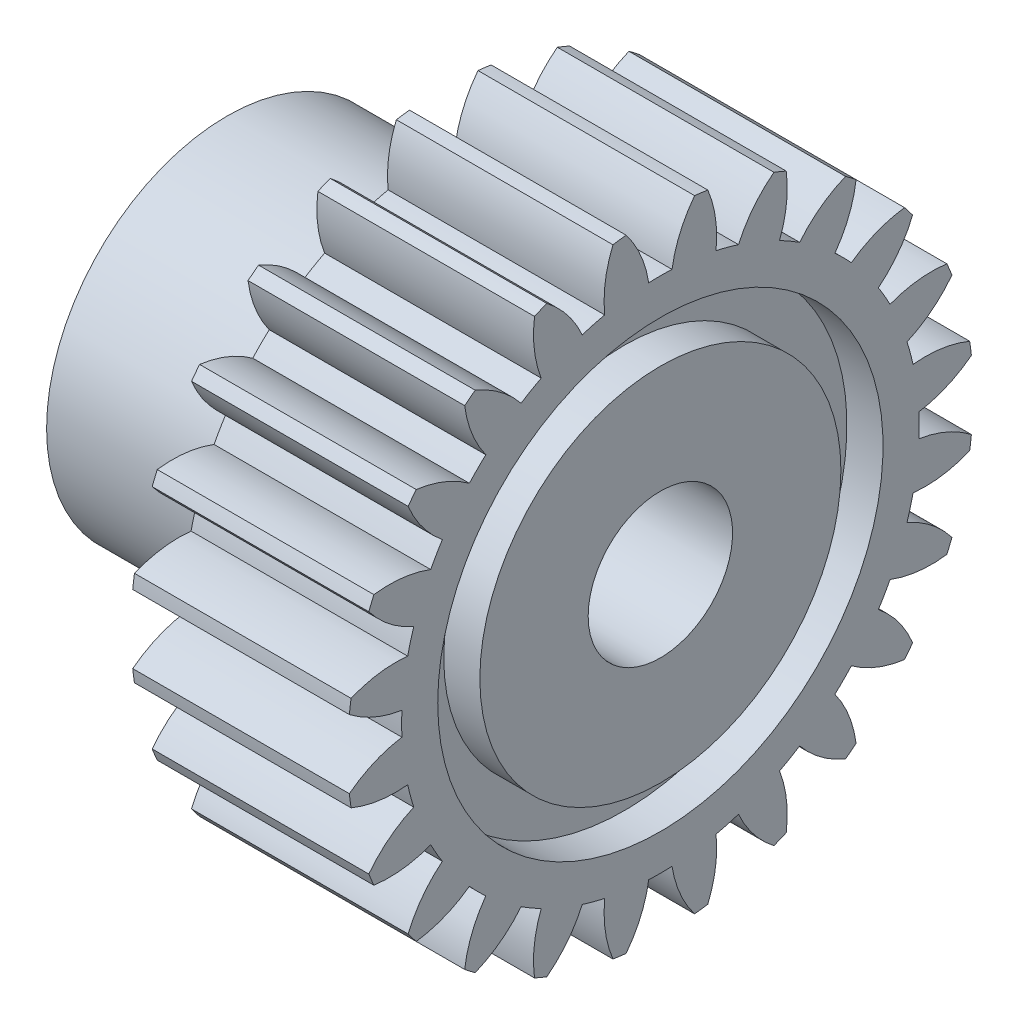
ISO-10303-21;
HEADER;
FILE_DESCRIPTION(('STEP AP214'),'2;1');
FILE_NAME('part.step','',(''),(''),'','','');
FILE_SCHEMA(('AUTOMOTIVE_DESIGN { 1 0 10303 214 1 1 1 1 }'));
ENDSEC;
DATA;
#1=APPLICATION_CONTEXT('core data for automotive mechanical design processes');
#2=APPLICATION_PROTOCOL_DEFINITION('international standard','automotive_design',2000,#1);
#3=PRODUCT_CONTEXT('',#1,'mechanical');
#4=PRODUCT('Part','Part','',(#3));
#5=PRODUCT_RELATED_PRODUCT_CATEGORY('part','',(#4));
#6=PRODUCT_DEFINITION_FORMATION('','',#4);
#7=PRODUCT_DEFINITION_CONTEXT('part definition',#1,'design');
#8=PRODUCT_DEFINITION('design','',#6,#7);
#9=PRODUCT_DEFINITION_SHAPE('','',#8);
#10=(LENGTH_UNIT() NAMED_UNIT(*) SI_UNIT(.MILLI.,.METRE.));
#11=(NAMED_UNIT(*) PLANE_ANGLE_UNIT() SI_UNIT($,.RADIAN.));
#12=(NAMED_UNIT(*) SI_UNIT($,.STERADIAN.) SOLID_ANGLE_UNIT());
#13=UNCERTAINTY_MEASURE_WITH_UNIT(LENGTH_MEASURE(1.E-05),#10,'distance_accuracy_value','');
#14=(GEOMETRIC_REPRESENTATION_CONTEXT(3) GLOBAL_UNCERTAINTY_ASSIGNED_CONTEXT((#13)) GLOBAL_UNIT_ASSIGNED_CONTEXT((#10,
#11,#12)) REPRESENTATION_CONTEXT('',''));
#15=CARTESIAN_POINT('',(0.,0.,0.));
#16=DIRECTION('',(0.,0.,1.));
#17=DIRECTION('',(1.,0.,0.));
#18=AXIS2_PLACEMENT_3D('',#15,#16,#17);
#19=CARTESIAN_POINT('',(9.,0.,0.));
#20=DIRECTION('',(-1.,0.,0.));
#21=DIRECTION('',(0.,0.,1.));
#22=AXIS2_PLACEMENT_3D('',#19,#20,#21);
#23=PLANE('',#22);
#24=CARTESIAN_POINT('',(9.,0.,0.));
#25=DIRECTION('',(-1.,0.,0.));
#26=DIRECTION('',(0.,0.,1.));
#27=AXIS2_PLACEMENT_3D('',#24,#25,#26);
#28=CIRCLE('',#27,3.);
#29=CARTESIAN_POINT('',(9.,0.,3.));
#30=VERTEX_POINT('',#29);
#31=EDGE_CURVE('E1211',#30,#30,#28,.F.);
#32=ORIENTED_EDGE('',*,*,#31,.F.);
#33=EDGE_LOOP('',(#32));
#34=FACE_BOUND('',#33,.T.);
#35=CARTESIAN_POINT('',(9.,0.,0.));
#36=DIRECTION('',(-1.,0.,0.));
#37=DIRECTION('',(0.,0.,1.));
#38=AXIS2_PLACEMENT_3D('',#35,#36,#37);
#39=CIRCLE('',#38,7.5);
#40=CARTESIAN_POINT('',(9.,0.,7.5));
#41=VERTEX_POINT('',#40);
#42=EDGE_CURVE('E1502',#41,#41,#39,.T.);
#43=ORIENTED_EDGE('',*,*,#42,.F.);
#44=EDGE_LOOP('',(#43));
#45=FACE_BOUND('',#44,.T.);
#46=ADVANCED_FACE('F33',(#34,#45),#23,.F.);
#47=CARTESIAN_POINT('',(9.,0.,0.));
#48=DIRECTION('',(-1.,0.,0.));
#49=DIRECTION('',(0.,0.,1.));
#50=AXIS2_PLACEMENT_3D('',#47,#48,#49);
#51=CIRCLE('',#50,9.25);
#52=CARTESIAN_POINT('',(9.,0.,9.25));
#53=VERTEX_POINT('',#52);
#54=EDGE_CURVE('E1508',#53,#53,#51,.T.);
#55=ORIENTED_EDGE('',*,*,#54,.T.);
#56=EDGE_LOOP('',(#55));
#57=FACE_BOUND('',#56,.T.);
#58=CARTESIAN_POINT('',(9.,5.22520191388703,9.99262052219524));
#59=DIRECTION('',(-1.,0.,0.));
#60=DIRECTION('',(0.,1.,0.));
#61=AXIS2_PLACEMENT_3D('',#58,#59,#60);
#62=CIRCLE('',#61,4.8);
#63=CARTESIAN_POINT('',(9.,0.483448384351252,10.7381226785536));
#64=VERTEX_POINT('',#63);
#65=CARTESIAN_POINT('',(9.,1.42267520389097,12.9219191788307));
#66=VERTEX_POINT('',#65);
#67=EDGE_CURVE('E682',#64,#66,#62,.T.);
#68=ORIENTED_EDGE('',*,*,#67,.F.);
#69=CARTESIAN_POINT('',(9.,0.,0.));
#70=DIRECTION('',(-1.,0.,0.));
#71=DIRECTION('',(0.,1.,0.));
#72=AXIS2_PLACEMENT_3D('',#69,#70,#71);
#73=CIRCLE('',#72,10.749);
#74=CARTESIAN_POINT('',(9.,-0.483448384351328,10.7381226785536));
#75=VERTEX_POINT('',#74);
#76=EDGE_CURVE('E687',#75,#64,#73,.T.);
#77=ORIENTED_EDGE('',*,*,#76,.F.);
#78=CARTESIAN_POINT('',(9.,-5.2252019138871,9.9926205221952));
#79=DIRECTION('',(-1.,0.,0.));
#80=DIRECTION('',(0.,1.,0.));
#81=AXIS2_PLACEMENT_3D('',#78,#79,#80);
#82=CIRCLE('',#81,4.8);
#83=CARTESIAN_POINT('',(9.,-1.42267520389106,12.9219191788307));
#84=VERTEX_POINT('',#83);
#85=EDGE_CURVE('E684',#84,#75,#82,.T.);
#86=ORIENTED_EDGE('',*,*,#85,.F.);
#87=CARTESIAN_POINT('',(9.,0.,0.));
#88=DIRECTION('',(-1.,0.,0.));
#89=DIRECTION('',(0.,0.,1.));
#90=AXIS2_PLACEMENT_3D('',#87,#88,#89);
#91=CIRCLE('',#90,13.);
#92=CARTESIAN_POINT('',(9.,-1.97024006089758,12.8498308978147));
#93=VERTEX_POINT('',#92);
#94=EDGE_CURVE('E1349',#93,#84,#91,.T.);
#95=ORIENTED_EDGE('',*,*,#94,.F.);
#96=CARTESIAN_POINT('',(9.,2.46087697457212,11.0045120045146));
#97=DIRECTION('',(-1.,0.,0.));
#98=DIRECTION('',(0.,0.965925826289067,0.258819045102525));
#99=AXIS2_PLACEMENT_3D('',#96,#97,#98);
#100=CIRCLE('',#99,4.8);
#101=CARTESIAN_POINT('',(9.,-2.31225537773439,10.4973556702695));
#102=VERTEX_POINT('',#101);
#103=EDGE_CURVE('E783',#102,#93,#100,.T.);
#104=ORIENTED_EDGE('',*,*,#103,.F.);
#105=CARTESIAN_POINT('',(9.,0.,0.));
#106=DIRECTION('',(-1.,0.,0.));
#107=DIRECTION('',(0.,0.965925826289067,0.258819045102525));
#108=AXIS2_PLACEMENT_3D('',#105,#106,#107);
#109=CIRCLE('',#108,10.749);
#110=CARTESIAN_POINT('',(9.,-3.24620593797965,10.2471043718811));
#111=VERTEX_POINT('',#110);
#112=EDGE_CURVE('E788',#111,#102,#109,.T.);
#113=ORIENTED_EDGE('',*,*,#112,.F.);
#114=CARTESIAN_POINT('',(9.,-7.63343797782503,8.29974846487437));
#115=DIRECTION('',(-1.,0.,0.));
#116=DIRECTION('',(0.,0.965925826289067,0.258819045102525));
#117=AXIS2_PLACEMENT_3D('',#114,#115,#116);
#118=CIRCLE('',#117,4.8);
#119=CARTESIAN_POINT('',(9.,-4.71863750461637,12.1134000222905));
#120=VERTEX_POINT('',#119);
#121=EDGE_CURVE('E785',#120,#111,#118,.T.);
#122=ORIENTED_EDGE('',*,*,#121,.F.);
#123=CARTESIAN_POINT('',(9.,-5.2288867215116,11.9020478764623));
#124=VERTEX_POINT('',#123);
#125=EDGE_CURVE('E1343',#124,#120,#91,.T.);
#126=ORIENTED_EDGE('',*,*,#125,.F.);
#127=CARTESIAN_POINT('',(9.,-0.471152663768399,11.2664641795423));
#128=DIRECTION('',(-1.,0.,0.));
#129=DIRECTION('',(0.,0.866025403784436,0.500000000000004));
#130=AXIS2_PLACEMENT_3D('',#127,#128,#129);
#131=CIRCLE('',#130,4.8);
#132=CARTESIAN_POINT('',(9.,-4.95038275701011,9.54121122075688));
#133=VERTEX_POINT('',#132);
#134=EDGE_CURVE('E817',#133,#124,#131,.T.);
#135=ORIENTED_EDGE('',*,*,#134,.F.);
#136=CARTESIAN_POINT('',(9.,0.,0.));
#137=DIRECTION('',(-1.,0.,0.));
#138=DIRECTION('',(0.,0.866025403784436,0.500000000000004));
#139=AXIS2_PLACEMENT_3D('',#136,#137,#138);
#140=CIRCLE('',#139,10.749);
#141=CARTESIAN_POINT('',(9.,-5.78773992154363,9.05776283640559));
#142=VERTEX_POINT('',#141);
#143=EDGE_CURVE('E822',#142,#133,#140,.T.);
#144=ORIENTED_EDGE('',*,*,#143,.F.);
#145=CARTESIAN_POINT('',(9.,-9.5214678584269,6.04126226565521));
#146=DIRECTION('',(-1.,0.,0.));
#147=DIRECTION('',(0.,0.866025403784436,0.500000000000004));
#148=AXIS2_PLACEMENT_3D('',#145,#146,#147);
#149=CIRCLE('',#148,4.8);
#150=CARTESIAN_POINT('',(9.,-7.69303245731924,10.4793726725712));
#151=VERTEX_POINT('',#150);
#152=EDGE_CURVE('E819',#151,#142,#149,.T.);
#153=ORIENTED_EDGE('',*,*,#152,.F.);
#154=CARTESIAN_POINT('',(9.,-8.13119339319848,10.143159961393));
#155=VERTEX_POINT('',#154);
#156=EDGE_CURVE('E1337',#155,#151,#91,.T.);
#157=ORIENTED_EDGE('',*,*,#156,.F.);
#158=CARTESIAN_POINT('',(9.,-3.37107402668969,10.7606254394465));
#159=DIRECTION('',(-1.,0.,0.));
#160=DIRECTION('',(0.,0.707106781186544,0.707106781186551));
#161=AXIS2_PLACEMENT_3D('',#158,#159,#160);
#162=CIRCLE('',#161,4.8);
#163=CARTESIAN_POINT('',(9.,-7.2511497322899,7.93484899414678));
#164=VERTEX_POINT('',#163);
#165=EDGE_CURVE('E800',#164,#155,#162,.T.);
#166=ORIENTED_EDGE('',*,*,#165,.F.);
#167=CARTESIAN_POINT('',(9.,0.,0.));
#168=DIRECTION('',(-1.,0.,0.));
#169=DIRECTION('',(0.,0.707106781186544,0.707106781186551));
#170=AXIS2_PLACEMENT_3D('',#167,#168,#169);
#171=CIRCLE('',#170,10.749);
#172=CARTESIAN_POINT('',(9.,-7.93484899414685,7.25114973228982));
#173=VERTEX_POINT('',#172);
#174=EDGE_CURVE('E805',#173,#164,#171,.T.);
#175=ORIENTED_EDGE('',*,*,#174,.F.);
#176=CARTESIAN_POINT('',(9.,-10.7606254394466,3.37107402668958));
#177=DIRECTION('',(-1.,0.,0.));
#178=DIRECTION('',(0.,0.707106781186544,0.707106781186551));
#179=AXIS2_PLACEMENT_3D('',#176,#177,#178);
#180=CIRCLE('',#179,4.8);
#181=CARTESIAN_POINT('',(9.,-10.1431599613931,8.13119339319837));
#182=VERTEX_POINT('',#181);
#183=EDGE_CURVE('E802',#182,#173,#180,.T.);
#184=ORIENTED_EDGE('',*,*,#183,.F.);
#185=CARTESIAN_POINT('',(9.,-10.4793726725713,7.69303245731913));
#186=VERTEX_POINT('',#185);
#187=EDGE_CURVE('E1331',#186,#182,#91,.T.);
#188=ORIENTED_EDGE('',*,*,#187,.F.);
#189=CARTESIAN_POINT('',(9.,-6.04126226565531,9.52146785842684));
#190=DIRECTION('',(-1.,0.,0.));
#191=DIRECTION('',(0.,0.499999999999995,0.866025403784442));
#192=AXIS2_PLACEMENT_3D('',#189,#190,#191);
#193=CIRCLE('',#192,4.8);
#194=CARTESIAN_POINT('',(9.,-9.05776283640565,5.78773992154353));
#195=VERTEX_POINT('',#194);
#196=EDGE_CURVE('E730',#195,#186,#193,.T.);
#197=ORIENTED_EDGE('',*,*,#196,.F.);
#198=CARTESIAN_POINT('',(9.,0.,0.));
#199=DIRECTION('',(-1.,0.,0.));
#200=DIRECTION('',(0.,0.499999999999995,0.866025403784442));
#201=AXIS2_PLACEMENT_3D('',#198,#199,#200);
#202=CIRCLE('',#201,10.749);
#203=CARTESIAN_POINT('',(9.,-9.54121122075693,4.95038275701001));
#204=VERTEX_POINT('',#203);
#205=EDGE_CURVE('E735',#204,#195,#202,.T.);
#206=ORIENTED_EDGE('',*,*,#205,.F.);
#207=CARTESIAN_POINT('',(9.,-11.2664641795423,0.471152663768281));
#208=DIRECTION('',(-1.,0.,0.));
#209=DIRECTION('',(0.,0.499999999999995,0.866025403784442));
#210=AXIS2_PLACEMENT_3D('',#207,#208,#209);
#211=CIRCLE('',#210,4.8);
#212=CARTESIAN_POINT('',(9.,-11.9020478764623,5.22888672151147));
#213=VERTEX_POINT('',#212);
#214=EDGE_CURVE('E732',#213,#204,#211,.T.);
#215=ORIENTED_EDGE('',*,*,#214,.F.);
#216=CARTESIAN_POINT('',(9.,-12.1134000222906,4.71863750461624));
#217=VERTEX_POINT('',#216);
#218=EDGE_CURVE('E1325',#217,#213,#91,.T.);
#219=ORIENTED_EDGE('',*,*,#218,.F.);
#220=CARTESIAN_POINT('',(9.,-8.29974846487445,7.63343797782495));
#221=DIRECTION('',(-1.,0.,0.));
#222=DIRECTION('',(0.,0.258819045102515,0.96592582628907));
#223=AXIS2_PLACEMENT_3D('',#220,#221,#222);
#224=CIRCLE('',#223,4.8);
#225=CARTESIAN_POINT('',(9.,-10.2471043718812,3.24620593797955));
#226=VERTEX_POINT('',#225);
#227=EDGE_CURVE('E749',#226,#217,#224,.T.);
#228=ORIENTED_EDGE('',*,*,#227,.F.);
#229=CARTESIAN_POINT('',(9.,0.,0.));
#230=DIRECTION('',(-1.,0.,0.));
#231=DIRECTION('',(0.,0.258819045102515,0.96592582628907));
#232=AXIS2_PLACEMENT_3D('',#229,#230,#231);
#233=CIRCLE('',#232,10.749);
#234=CARTESIAN_POINT('',(9.,-10.4973556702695,2.31225537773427));
#235=VERTEX_POINT('',#234);
#236=EDGE_CURVE('E754',#235,#226,#233,.T.);
#237=ORIENTED_EDGE('',*,*,#236,.F.);
#238=CARTESIAN_POINT('',(9.,-11.0045120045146,-2.46087697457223));
#239=DIRECTION('',(-1.,0.,0.));
#240=DIRECTION('',(0.,0.258819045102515,0.96592582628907));
#241=AXIS2_PLACEMENT_3D('',#238,#239,#240);
#242=CIRCLE('',#241,4.8);
#243=CARTESIAN_POINT('',(9.,-12.8498308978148,1.97024006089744));
#244=VERTEX_POINT('',#243);
#245=EDGE_CURVE('E751',#244,#235,#242,.T.);
#246=ORIENTED_EDGE('',*,*,#245,.F.);
#247=CARTESIAN_POINT('',(9.,-12.9219191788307,1.42267520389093));
#248=VERTEX_POINT('',#247);
#249=EDGE_CURVE('E1319',#248,#244,#91,.T.);
#250=ORIENTED_EDGE('',*,*,#249,.F.);
#251=CARTESIAN_POINT('',(9.,-9.99262052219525,5.22520191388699));
#252=DIRECTION('',(-1.,0.,0.));
#253=DIRECTION('',(0.,0.,1.));
#254=AXIS2_PLACEMENT_3D('',#251,#252,#253);
#255=CIRCLE('',#254,4.8);
#256=CARTESIAN_POINT('',(9.,-10.7381226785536,0.483448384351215));
#257=VERTEX_POINT('',#256);
#258=EDGE_CURVE('E766',#257,#248,#255,.T.);
#259=ORIENTED_EDGE('',*,*,#258,.F.);
#260=CARTESIAN_POINT('',(9.,0.,0.));
#261=DIRECTION('',(-1.,0.,0.));
#262=DIRECTION('',(0.,0.,1.));
#263=AXIS2_PLACEMENT_3D('',#260,#261,#262);
#264=CIRCLE('',#263,10.749);
#265=CARTESIAN_POINT('',(9.,-10.7381226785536,-0.483448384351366));
#266=VERTEX_POINT('',#265);
#267=EDGE_CURVE('E771',#266,#257,#264,.T.);
#268=ORIENTED_EDGE('',*,*,#267,.F.);
#269=CARTESIAN_POINT('',(9.,-9.99262052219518,-5.22520191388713));
#270=DIRECTION('',(-1.,0.,0.));
#271=DIRECTION('',(0.,0.,1.));
#272=AXIS2_PLACEMENT_3D('',#269,#270,#271);
#273=CIRCLE('',#272,4.8);
#274=CARTESIAN_POINT('',(9.,-12.9219191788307,-1.42267520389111));
#275=VERTEX_POINT('',#274);
#276=EDGE_CURVE('E768',#275,#266,#273,.T.);
#277=ORIENTED_EDGE('',*,*,#276,.F.);
#278=CARTESIAN_POINT('',(9.,-12.8498308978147,-1.97024006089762));
#279=VERTEX_POINT('',#278);
#280=EDGE_CURVE('E1313',#279,#275,#91,.T.);
#281=ORIENTED_EDGE('',*,*,#280,.F.);
#282=CARTESIAN_POINT('',(9.,-11.0045120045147,2.46087697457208));
#283=DIRECTION('',(-1.,0.,0.));
#284=DIRECTION('',(0.,-0.258819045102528,0.965925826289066));
#285=AXIS2_PLACEMENT_3D('',#282,#283,#284);
#286=CIRCLE('',#285,4.8);
#287=CARTESIAN_POINT('',(9.,-10.4973556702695,-2.31225537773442));
#288=VERTEX_POINT('',#287);
#289=EDGE_CURVE('E885',#288,#279,#286,.T.);
#290=ORIENTED_EDGE('',*,*,#289,.F.);
#291=CARTESIAN_POINT('',(9.,0.,0.));
#292=DIRECTION('',(-1.,0.,0.));
#293=DIRECTION('',(0.,-0.258819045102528,0.965925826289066));
#294=AXIS2_PLACEMENT_3D('',#291,#292,#293);
#295=CIRCLE('',#294,10.749);
#296=CARTESIAN_POINT('',(9.,-10.2471043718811,-3.24620593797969));
#297=VERTEX_POINT('',#296);
#298=EDGE_CURVE('E890',#297,#288,#295,.T.);
#299=ORIENTED_EDGE('',*,*,#298,.F.);
#300=CARTESIAN_POINT('',(9.,-8.29974846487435,-7.63343797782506));
#301=DIRECTION('',(-1.,0.,0.));
#302=DIRECTION('',(0.,-0.258819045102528,0.965925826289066));
#303=AXIS2_PLACEMENT_3D('',#300,#301,#302);
#304=CIRCLE('',#303,4.8);
#305=CARTESIAN_POINT('',(9.,-12.1134000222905,-4.71863750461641));
#306=VERTEX_POINT('',#305);
#307=EDGE_CURVE('E887',#306,#297,#304,.T.);
#308=ORIENTED_EDGE('',*,*,#307,.F.);
#309=CARTESIAN_POINT('',(9.,-11.9020478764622,-5.22888672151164));
#310=VERTEX_POINT('',#309);
#311=EDGE_CURVE('E1307',#310,#306,#91,.T.);
#312=ORIENTED_EDGE('',*,*,#311,.F.);
#313=CARTESIAN_POINT('',(9.,-11.2664641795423,-0.471152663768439));
#314=DIRECTION('',(-1.,0.,0.));
#315=DIRECTION('',(0.,-0.500000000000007,0.866025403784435));
#316=AXIS2_PLACEMENT_3D('',#313,#314,#315);
#317=CIRCLE('',#316,4.8);
#318=CARTESIAN_POINT('',(9.,-9.54121122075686,-4.95038275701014));
#319=VERTEX_POINT('',#318);
#320=EDGE_CURVE('E902',#319,#310,#317,.T.);
#321=ORIENTED_EDGE('',*,*,#320,.F.);
#322=CARTESIAN_POINT('',(9.,0.,0.));
#323=DIRECTION('',(-1.,0.,0.));
#324=DIRECTION('',(0.,-0.500000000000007,0.866025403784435));
#325=AXIS2_PLACEMENT_3D('',#322,#323,#324);
#326=CIRCLE('',#325,10.749);
#327=CARTESIAN_POINT('',(9.,-9.05776283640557,-5.78773992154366));
#328=VERTEX_POINT('',#327);
#329=EDGE_CURVE('E907',#328,#319,#326,.T.);
#330=ORIENTED_EDGE('',*,*,#329,.F.);
#331=CARTESIAN_POINT('',(9.,-6.04126226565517,-9.52146785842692));
#332=DIRECTION('',(-1.,0.,0.));
#333=DIRECTION('',(0.,-0.500000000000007,0.866025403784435));
#334=AXIS2_PLACEMENT_3D('',#331,#332,#333);
#335=CIRCLE('',#334,4.8);
#336=CARTESIAN_POINT('',(9.,-10.4793726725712,-7.69303245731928));
#337=VERTEX_POINT('',#336);
#338=EDGE_CURVE('E904',#337,#328,#335,.T.);
#339=ORIENTED_EDGE('',*,*,#338,.F.);
#340=CARTESIAN_POINT('',(9.,-10.1431599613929,-8.13119339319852));
#341=VERTEX_POINT('',#340);
#342=EDGE_CURVE('E1301',#341,#337,#91,.T.);
#343=ORIENTED_EDGE('',*,*,#342,.F.);
#344=CARTESIAN_POINT('',(9.,-10.7606254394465,-3.37107402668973));
#345=DIRECTION('',(-1.,0.,0.));
#346=DIRECTION('',(0.,-0.707106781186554,0.707106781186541));
#347=AXIS2_PLACEMENT_3D('',#344,#345,#346);
#348=CIRCLE('',#347,4.8);
#349=CARTESIAN_POINT('',(9.,-7.93484899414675,-7.25114973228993));
#350=VERTEX_POINT('',#349);
#351=EDGE_CURVE('E868',#350,#341,#348,.T.);
#352=ORIENTED_EDGE('',*,*,#351,.F.);
#353=CARTESIAN_POINT('',(9.,0.,0.));
#354=DIRECTION('',(-1.,0.,0.));
#355=DIRECTION('',(0.,-0.707106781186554,0.707106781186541));
#356=AXIS2_PLACEMENT_3D('',#353,#354,#355);
#357=CIRCLE('',#356,10.749);
#358=CARTESIAN_POINT('',(9.,-7.25114973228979,-7.93484899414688));
#359=VERTEX_POINT('',#358);
#360=EDGE_CURVE('E873',#359,#350,#357,.T.);
#361=ORIENTED_EDGE('',*,*,#360,.F.);
#362=CARTESIAN_POINT('',(9.,-3.37107402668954,-10.7606254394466));
#363=DIRECTION('',(-1.,0.,0.));
#364=DIRECTION('',(0.,-0.707106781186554,0.707106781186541));
#365=AXIS2_PLACEMENT_3D('',#362,#363,#364);
#366=CIRCLE('',#365,4.8);
#367=CARTESIAN_POINT('',(9.,-8.13119339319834,-10.1431599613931));
#368=VERTEX_POINT('',#367);
#369=EDGE_CURVE('E870',#368,#359,#366,.T.);
#370=ORIENTED_EDGE('',*,*,#369,.F.);
#371=CARTESIAN_POINT('',(9.,-7.6930324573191,-10.4793726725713));
#372=VERTEX_POINT('',#371);
#373=EDGE_CURVE('E1295',#372,#368,#91,.T.);
#374=ORIENTED_EDGE('',*,*,#373,.F.);
#375=CARTESIAN_POINT('',(9.,-9.52146785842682,-6.04126226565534));
#376=DIRECTION('',(-1.,0.,0.));
#377=DIRECTION('',(0.,-0.866025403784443,0.499999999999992));
#378=AXIS2_PLACEMENT_3D('',#375,#376,#377);
#379=CIRCLE('',#378,4.8);
#380=CARTESIAN_POINT('',(9.,-5.7877399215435,-9.05776283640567));
#381=VERTEX_POINT('',#380);
#382=EDGE_CURVE('E832',#381,#372,#379,.T.);
#383=ORIENTED_EDGE('',*,*,#382,.F.);
#384=CARTESIAN_POINT('',(9.,0.,0.));
#385=DIRECTION('',(-1.,0.,0.));
#386=DIRECTION('',(0.,-0.866025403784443,0.499999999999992));
#387=AXIS2_PLACEMENT_3D('',#384,#385,#386);
#388=CIRCLE('',#387,10.749);
#389=CARTESIAN_POINT('',(9.,-4.95038275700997,-9.54121122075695));
#390=VERTEX_POINT('',#389);
#391=EDGE_CURVE('E837',#390,#381,#388,.T.);
#392=ORIENTED_EDGE('',*,*,#391,.F.);
#393=CARTESIAN_POINT('',(9.,-0.471152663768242,-11.2664641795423));
#394=DIRECTION('',(-1.,0.,0.));
#395=DIRECTION('',(0.,-0.866025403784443,0.499999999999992));
#396=AXIS2_PLACEMENT_3D('',#393,#394,#395);
#397=CIRCLE('',#396,4.8);
#398=CARTESIAN_POINT('',(9.,-5.22888672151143,-11.9020478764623));
#399=VERTEX_POINT('',#398);
#400=EDGE_CURVE('E834',#399,#390,#397,.T.);
#401=ORIENTED_EDGE('',*,*,#400,.F.);
#402=CARTESIAN_POINT('',(9.,-4.7186375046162,-12.1134000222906));
#403=VERTEX_POINT('',#402);
#404=EDGE_CURVE('E1289',#403,#399,#91,.T.);
#405=ORIENTED_EDGE('',*,*,#404,.F.);
#406=CARTESIAN_POINT('',(9.,-7.63343797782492,-8.29974846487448));
#407=DIRECTION('',(-1.,0.,0.));
#408=DIRECTION('',(0.,-0.965925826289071,0.258819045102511));
#409=AXIS2_PLACEMENT_3D('',#406,#407,#408);
#410=CIRCLE('',#409,4.8);
#411=CARTESIAN_POINT('',(9.,-3.24620593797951,-10.2471043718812));
#412=VERTEX_POINT('',#411);
#413=EDGE_CURVE('E851',#412,#403,#410,.T.);
#414=ORIENTED_EDGE('',*,*,#413,.F.);
#415=CARTESIAN_POINT('',(9.,0.,0.));
#416=DIRECTION('',(-1.,0.,0.));
#417=DIRECTION('',(0.,-0.965925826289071,0.258819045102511));
#418=AXIS2_PLACEMENT_3D('',#415,#416,#417);
#419=CIRCLE('',#418,10.749);
#420=CARTESIAN_POINT('',(9.,-2.31225537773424,-10.4973556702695));
#421=VERTEX_POINT('',#420);
#422=EDGE_CURVE('E856',#421,#412,#419,.T.);
#423=ORIENTED_EDGE('',*,*,#422,.F.);
#424=CARTESIAN_POINT('',(9.,2.46087697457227,-11.0045120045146));
#425=DIRECTION('',(-1.,0.,0.));
#426=DIRECTION('',(0.,-0.965925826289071,0.258819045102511));
#427=AXIS2_PLACEMENT_3D('',#424,#425,#426);
#428=CIRCLE('',#427,4.8);
#429=CARTESIAN_POINT('',(9.,-1.97024006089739,-12.8498308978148));
#430=VERTEX_POINT('',#429);
#431=EDGE_CURVE('E853',#430,#421,#428,.T.);
#432=ORIENTED_EDGE('',*,*,#431,.F.);
#433=CARTESIAN_POINT('',(9.,-1.42267520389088,-12.9219191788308));
#434=VERTEX_POINT('',#433);
#435=EDGE_CURVE('E1283',#434,#430,#91,.T.);
#436=ORIENTED_EDGE('',*,*,#435,.F.);
#437=CARTESIAN_POINT('',(9.,-5.22520191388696,-9.99262052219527));
#438=DIRECTION('',(-1.,0.,0.));
#439=DIRECTION('',(0.,-1.,0.));
#440=AXIS2_PLACEMENT_3D('',#437,#438,#439);
#441=CIRCLE('',#440,4.8);
#442=CARTESIAN_POINT('',(9.,-0.483448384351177,-10.7381226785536));
#443=VERTEX_POINT('',#442);
#444=EDGE_CURVE('E970',#443,#434,#441,.T.);
#445=ORIENTED_EDGE('',*,*,#444,.F.);
#446=CARTESIAN_POINT('',(9.,0.,0.));
#447=DIRECTION('',(-1.,0.,0.));
#448=DIRECTION('',(0.,-1.,0.));
#449=AXIS2_PLACEMENT_3D('',#446,#447,#448);
#450=CIRCLE('',#449,10.749);
#451=CARTESIAN_POINT('',(9.,0.483448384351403,-10.7381226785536));
#452=VERTEX_POINT('',#451);
#453=EDGE_CURVE('E975',#452,#443,#450,.T.);
#454=ORIENTED_EDGE('',*,*,#453,.F.);
#455=CARTESIAN_POINT('',(9.,5.22520191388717,-9.99262052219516));
#456=DIRECTION('',(-1.,0.,0.));
#457=DIRECTION('',(0.,-1.,0.));
#458=AXIS2_PLACEMENT_3D('',#455,#456,#457);
#459=CIRCLE('',#458,4.8);
#460=CARTESIAN_POINT('',(9.,1.42267520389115,-12.9219191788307));
#461=VERTEX_POINT('',#460);
#462=EDGE_CURVE('E972',#461,#452,#459,.T.);
#463=ORIENTED_EDGE('',*,*,#462,.F.);
#464=CARTESIAN_POINT('',(9.,1.97024006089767,-12.8498308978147));
#465=VERTEX_POINT('',#464);
#466=EDGE_CURVE('E1277',#465,#461,#91,.T.);
#467=ORIENTED_EDGE('',*,*,#466,.F.);
#468=CARTESIAN_POINT('',(9.,-2.46087697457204,-11.0045120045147));
#469=DIRECTION('',(-1.,0.,0.));
#470=DIRECTION('',(0.,-0.965925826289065,-0.258819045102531));
#471=AXIS2_PLACEMENT_3D('',#468,#469,#470);
#472=CIRCLE('',#471,4.8);
#473=CARTESIAN_POINT('',(9.,2.31225537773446,-10.4973556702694));
#474=VERTEX_POINT('',#473);
#475=EDGE_CURVE('E987',#474,#465,#472,.T.);
#476=ORIENTED_EDGE('',*,*,#475,.F.);
#477=CARTESIAN_POINT('',(9.,0.,0.));
#478=DIRECTION('',(-1.,0.,0.));
#479=DIRECTION('',(0.,-0.965925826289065,-0.258819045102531));
#480=AXIS2_PLACEMENT_3D('',#477,#478,#479);
#481=CIRCLE('',#480,10.749);
#482=CARTESIAN_POINT('',(9.,3.24620593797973,-10.2471043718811));
#483=VERTEX_POINT('',#482);
#484=EDGE_CURVE('E992',#483,#474,#481,.T.);
#485=ORIENTED_EDGE('',*,*,#484,.F.);
#486=CARTESIAN_POINT('',(9.,7.63343797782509,-8.29974846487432));
#487=DIRECTION('',(-1.,0.,0.));
#488=DIRECTION('',(0.,-0.965925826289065,-0.258819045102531));
#489=AXIS2_PLACEMENT_3D('',#486,#487,#488);
#490=CIRCLE('',#489,4.8);
#491=CARTESIAN_POINT('',(9.,4.71863750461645,-12.1134000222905));
#492=VERTEX_POINT('',#491);
#493=EDGE_CURVE('E989',#492,#483,#490,.T.);
#494=ORIENTED_EDGE('',*,*,#493,.F.);
#495=CARTESIAN_POINT('',(9.,5.22888672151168,-11.9020478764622));
#496=VERTEX_POINT('',#495);
#497=EDGE_CURVE('E1271',#496,#492,#91,.T.);
#498=ORIENTED_EDGE('',*,*,#497,.F.);
#499=CARTESIAN_POINT('',(9.,0.471152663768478,-11.2664641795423));
#500=DIRECTION('',(-1.,0.,0.));
#501=DIRECTION('',(0.,-0.866025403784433,-0.50000000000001));
#502=AXIS2_PLACEMENT_3D('',#499,#500,#501);
#503=CIRCLE('',#502,4.8);
#504=CARTESIAN_POINT('',(9.,4.95038275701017,-9.54121122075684));
#505=VERTEX_POINT('',#504);
#506=EDGE_CURVE('E1004',#505,#496,#503,.T.);
#507=ORIENTED_EDGE('',*,*,#506,.F.);
#508=CARTESIAN_POINT('',(9.,0.,0.));
#509=DIRECTION('',(-1.,0.,0.));
#510=DIRECTION('',(0.,-0.866025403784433,-0.50000000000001));
#511=AXIS2_PLACEMENT_3D('',#508,#509,#510);
#512=CIRCLE('',#511,10.749);
#513=CARTESIAN_POINT('',(9.,5.78773992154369,-9.05776283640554));
#514=VERTEX_POINT('',#513);
#515=EDGE_CURVE('E1009',#514,#505,#512,.T.);
#516=ORIENTED_EDGE('',*,*,#515,.F.);
#517=CARTESIAN_POINT('',(9.,9.52146785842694,-6.04126226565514));
#518=DIRECTION('',(-1.,0.,0.));
#519=DIRECTION('',(0.,-0.866025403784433,-0.50000000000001));
#520=AXIS2_PLACEMENT_3D('',#517,#518,#519);
#521=CIRCLE('',#520,4.8);
#522=CARTESIAN_POINT('',(9.,7.69303245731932,-10.4793726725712));
#523=VERTEX_POINT('',#522);
#524=EDGE_CURVE('E1006',#523,#514,#521,.T.);
#525=ORIENTED_EDGE('',*,*,#524,.F.);
#526=CARTESIAN_POINT('',(9.,8.13119339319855,-10.1431599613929));
#527=VERTEX_POINT('',#526);
#528=EDGE_CURVE('E1265',#527,#523,#91,.T.);
#529=ORIENTED_EDGE('',*,*,#528,.F.);
#530=CARTESIAN_POINT('',(9.,3.37107402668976,-10.7606254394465));
#531=DIRECTION('',(-1.,0.,0.));
#532=DIRECTION('',(0.,-0.707106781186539,-0.707106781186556));
#533=AXIS2_PLACEMENT_3D('',#530,#531,#532);
#534=CIRCLE('',#533,4.8);
#535=CARTESIAN_POINT('',(9.,7.25114973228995,-7.93484899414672));
#536=VERTEX_POINT('',#535);
#537=EDGE_CURVE('E953',#536,#527,#534,.T.);
#538=ORIENTED_EDGE('',*,*,#537,.F.);
#539=CARTESIAN_POINT('',(9.,0.,0.));
#540=DIRECTION('',(-1.,0.,0.));
#541=DIRECTION('',(0.,-0.707106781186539,-0.707106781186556));
#542=AXIS2_PLACEMENT_3D('',#539,#540,#541);
#543=CIRCLE('',#542,10.749);
#544=CARTESIAN_POINT('',(9.,7.9348489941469,-7.25114973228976));
#545=VERTEX_POINT('',#544);
#546=EDGE_CURVE('E958',#545,#536,#543,.T.);
#547=ORIENTED_EDGE('',*,*,#546,.F.);
#548=CARTESIAN_POINT('',(9.,10.7606254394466,-3.3710740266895));
#549=DIRECTION('',(-1.,0.,0.));
#550=DIRECTION('',(0.,-0.707106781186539,-0.707106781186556));
#551=AXIS2_PLACEMENT_3D('',#548,#549,#550);
#552=CIRCLE('',#551,4.8);
#553=CARTESIAN_POINT('',(9.,10.1431599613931,-8.1311933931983));
#554=VERTEX_POINT('',#553);
#555=EDGE_CURVE('E955',#554,#545,#552,.T.);
#556=ORIENTED_EDGE('',*,*,#555,.F.);
#557=CARTESIAN_POINT('',(9.,10.4793726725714,-7.69303245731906));
#558=VERTEX_POINT('',#557);
#559=EDGE_CURVE('E1259',#558,#554,#91,.T.);
#560=ORIENTED_EDGE('',*,*,#559,.F.);
#561=CARTESIAN_POINT('',(9.,6.04126226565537,-9.52146785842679));
#562=DIRECTION('',(-1.,0.,0.));
#563=DIRECTION('',(0.,-0.499999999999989,-0.866025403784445));
#564=AXIS2_PLACEMENT_3D('',#561,#562,#563);
#565=CIRCLE('',#564,4.8);
#566=CARTESIAN_POINT('',(9.,9.05776283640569,-5.78773992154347));
#567=VERTEX_POINT('',#566);
#568=EDGE_CURVE('E917',#567,#558,#565,.T.);
#569=ORIENTED_EDGE('',*,*,#568,.F.);
#570=CARTESIAN_POINT('',(9.,0.,0.));
#571=DIRECTION('',(-1.,0.,0.));
#572=DIRECTION('',(0.,-0.499999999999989,-0.866025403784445));
#573=AXIS2_PLACEMENT_3D('',#570,#571,#572);
#574=CIRCLE('',#573,10.749);
#575=CARTESIAN_POINT('',(9.,9.54121122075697,-4.95038275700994));
#576=VERTEX_POINT('',#575);
#577=EDGE_CURVE('E922',#576,#567,#574,.T.);
#578=ORIENTED_EDGE('',*,*,#577,.F.);
#579=CARTESIAN_POINT('',(9.,11.2664641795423,-0.471152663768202));
#580=DIRECTION('',(-1.,0.,0.));
#581=DIRECTION('',(0.,-0.499999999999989,-0.866025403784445));
#582=AXIS2_PLACEMENT_3D('',#579,#580,#581);
#583=CIRCLE('',#582,4.8);
#584=CARTESIAN_POINT('',(9.,11.9020478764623,-5.22888672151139));
#585=VERTEX_POINT('',#584);
#586=EDGE_CURVE('E919',#585,#576,#583,.T.);
#587=ORIENTED_EDGE('',*,*,#586,.F.);
#588=CARTESIAN_POINT('',(9.,12.1134000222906,-4.71863750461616));
#589=VERTEX_POINT('',#588);
#590=EDGE_CURVE('E1160',#589,#585,#91,.T.);
#591=ORIENTED_EDGE('',*,*,#590,.F.);
#592=CARTESIAN_POINT('',(9.,8.29974846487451,-7.63343797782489));
#593=DIRECTION('',(-1.,0.,0.));
#594=DIRECTION('',(0.,-0.258819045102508,-0.965925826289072));
#595=AXIS2_PLACEMENT_3D('',#592,#593,#594);
#596=CIRCLE('',#595,4.8);
#597=CARTESIAN_POINT('',(9.,10.2471043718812,-3.24620593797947));
#598=VERTEX_POINT('',#597);
#599=EDGE_CURVE('E936',#598,#589,#596,.T.);
#600=ORIENTED_EDGE('',*,*,#599,.F.);
#601=CARTESIAN_POINT('',(9.,0.,0.));
#602=DIRECTION('',(-1.,0.,0.));
#603=DIRECTION('',(0.,-0.258819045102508,-0.965925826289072));
#604=AXIS2_PLACEMENT_3D('',#601,#602,#603);
#605=CIRCLE('',#604,10.749);
#606=CARTESIAN_POINT('',(9.,10.4973556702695,-2.3122553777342));
#607=VERTEX_POINT('',#606);
#608=EDGE_CURVE('E941',#607,#598,#605,.T.);
#609=ORIENTED_EDGE('',*,*,#608,.F.);
#610=CARTESIAN_POINT('',(9.,11.0045120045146,2.46087697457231));
#611=DIRECTION('',(-1.,0.,0.));
#612=DIRECTION('',(0.,-0.258819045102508,-0.965925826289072));
#613=AXIS2_PLACEMENT_3D('',#610,#611,#612);
#614=CIRCLE('',#613,4.8);
#615=CARTESIAN_POINT('',(9.,12.8498308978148,-1.97024006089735));
#616=VERTEX_POINT('',#615);
#617=EDGE_CURVE('E938',#616,#607,#614,.T.);
#618=ORIENTED_EDGE('',*,*,#617,.F.);
#619=CARTESIAN_POINT('',(9.,12.9219191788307,-1.42267520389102));
#620=VERTEX_POINT('',#619);
#621=EDGE_CURVE('E1156',#620,#616,#91,.T.);
#622=ORIENTED_EDGE('',*,*,#621,.F.);
#623=CARTESIAN_POINT('',(9.,9.99262052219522,-5.22520191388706));
#624=DIRECTION('',(-1.,0.,0.));
#625=DIRECTION('',(0.,0.,-1.));
#626=AXIS2_PLACEMENT_3D('',#623,#624,#625);
#627=CIRCLE('',#626,4.8);
#628=CARTESIAN_POINT('',(9.,10.7381226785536,-0.48344838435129));
#629=VERTEX_POINT('',#628);
#630=EDGE_CURVE('E1128',#629,#620,#627,.T.);
#631=ORIENTED_EDGE('',*,*,#630,.F.);
#632=CARTESIAN_POINT('',(9.,0.,0.));
#633=DIRECTION('',(-1.,0.,0.));
#634=DIRECTION('',(0.,0.,-1.));
#635=AXIS2_PLACEMENT_3D('',#632,#633,#634);
#636=CIRCLE('',#635,10.749);
#637=CARTESIAN_POINT('',(9.,10.7381226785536,0.483448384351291));
#638=VERTEX_POINT('',#637);
#639=EDGE_CURVE('E1133',#638,#629,#636,.T.);
#640=ORIENTED_EDGE('',*,*,#639,.F.);
#641=CARTESIAN_POINT('',(9.,9.99262052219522,5.22520191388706));
#642=DIRECTION('',(-1.,0.,0.));
#643=DIRECTION('',(0.,0.,-1.));
#644=AXIS2_PLACEMENT_3D('',#641,#642,#643);
#645=CIRCLE('',#644,4.8);
#646=CARTESIAN_POINT('',(9.,12.9219191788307,1.42267520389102));
#647=VERTEX_POINT('',#646);
#648=EDGE_CURVE('E1130',#647,#638,#645,.T.);
#649=ORIENTED_EDGE('',*,*,#648,.F.);
#650=CARTESIAN_POINT('',(9.,12.8498308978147,1.97024006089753));
#651=VERTEX_POINT('',#650);
#652=EDGE_CURVE('E1153',#651,#647,#91,.T.);
#653=ORIENTED_EDGE('',*,*,#652,.F.);
#654=CARTESIAN_POINT('',(9.,11.0045120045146,-2.46087697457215));
#655=DIRECTION('',(-1.,0.,0.));
#656=DIRECTION('',(0.,0.258819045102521,-0.965925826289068));
#657=AXIS2_PLACEMENT_3D('',#654,#655,#656);
#658=CIRCLE('',#657,4.8);
#659=CARTESIAN_POINT('',(9.,10.4973556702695,2.31225537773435));
#660=VERTEX_POINT('',#659);
#661=EDGE_CURVE('E1106',#660,#651,#658,.T.);
#662=ORIENTED_EDGE('',*,*,#661,.F.);
#663=CARTESIAN_POINT('',(9.,0.,0.));
#664=DIRECTION('',(-1.,0.,0.));
#665=DIRECTION('',(0.,0.258819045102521,-0.965925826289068));
#666=AXIS2_PLACEMENT_3D('',#663,#664,#665);
#667=CIRCLE('',#666,10.749);
#668=CARTESIAN_POINT('',(9.,10.2471043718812,3.24620593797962));
#669=VERTEX_POINT('',#668);
#670=EDGE_CURVE('E1111',#669,#660,#667,.T.);
#671=ORIENTED_EDGE('',*,*,#670,.F.);
#672=CARTESIAN_POINT('',(9.,8.2997484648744,7.633437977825));
#673=DIRECTION('',(-1.,0.,0.));
#674=DIRECTION('',(0.,0.258819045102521,-0.965925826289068));
#675=AXIS2_PLACEMENT_3D('',#672,#673,#674);
#676=CIRCLE('',#675,4.8);
#677=CARTESIAN_POINT('',(9.,12.1134000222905,4.71863750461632));
#678=VERTEX_POINT('',#677);
#679=EDGE_CURVE('E1108',#678,#669,#676,.T.);
#680=ORIENTED_EDGE('',*,*,#679,.F.);
#681=CARTESIAN_POINT('',(9.,11.9020478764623,5.22888672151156));
#682=VERTEX_POINT('',#681);
#683=EDGE_CURVE('E1161',#682,#678,#91,.T.);
#684=ORIENTED_EDGE('',*,*,#683,.F.);
#685=CARTESIAN_POINT('',(9.,11.2664641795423,0.47115266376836));
#686=DIRECTION('',(-1.,0.,0.));
#687=DIRECTION('',(0.,0.500000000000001,-0.866025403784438));
#688=AXIS2_PLACEMENT_3D('',#685,#686,#687);
#689=CIRCLE('',#688,4.8);
#690=CARTESIAN_POINT('',(9.,9.5412112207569,4.95038275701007));
#691=VERTEX_POINT('',#690);
#692=EDGE_CURVE('E713',#691,#682,#689,.T.);
#693=ORIENTED_EDGE('',*,*,#692,.F.);
#694=CARTESIAN_POINT('',(9.,0.,0.));
#695=DIRECTION('',(-1.,0.,0.));
#696=DIRECTION('',(0.,0.500000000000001,-0.866025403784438));
#697=AXIS2_PLACEMENT_3D('',#694,#695,#696);
#698=CIRCLE('',#697,10.749);
#699=CARTESIAN_POINT('',(9.,9.05776283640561,5.78773992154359));
#700=VERTEX_POINT('',#699);
#701=EDGE_CURVE('E718',#700,#691,#698,.T.);
#702=ORIENTED_EDGE('',*,*,#701,.F.);
#703=CARTESIAN_POINT('',(9.,6.04126226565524,9.52146785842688));
#704=DIRECTION('',(-1.,0.,0.));
#705=DIRECTION('',(0.,0.500000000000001,-0.866025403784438));
#706=AXIS2_PLACEMENT_3D('',#703,#704,#705);
#707=CIRCLE('',#706,4.8);
#708=CARTESIAN_POINT('',(9.,10.4793726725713,7.69303245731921));
#709=VERTEX_POINT('',#708);
#710=EDGE_CURVE('E715',#709,#700,#707,.T.);
#711=ORIENTED_EDGE('',*,*,#710,.F.);
#712=CARTESIAN_POINT('',(9.,10.143159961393,8.13119339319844));
#713=VERTEX_POINT('',#712);
#714=EDGE_CURVE('E1243',#713,#709,#91,.T.);
#715=ORIENTED_EDGE('',*,*,#714,.F.);
#716=CARTESIAN_POINT('',(9.,10.7606254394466,3.37107402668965));
#717=DIRECTION('',(-1.,0.,0.));
#718=DIRECTION('',(0.,0.707106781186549,-0.707106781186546));
#719=AXIS2_PLACEMENT_3D('',#716,#717,#718);
#720=CIRCLE('',#719,4.8);
#721=CARTESIAN_POINT('',(9.,7.9348489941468,7.25114973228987));
#722=VERTEX_POINT('',#721);
#723=EDGE_CURVE('E696',#722,#713,#720,.T.);
#724=ORIENTED_EDGE('',*,*,#723,.F.);
#725=CARTESIAN_POINT('',(9.,0.,0.));
#726=DIRECTION('',(-1.,0.,0.));
#727=DIRECTION('',(0.,0.707106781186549,-0.707106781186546));
#728=AXIS2_PLACEMENT_3D('',#725,#726,#727);
#729=CIRCLE('',#728,10.749);
#730=CARTESIAN_POINT('',(9.,7.25114973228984,7.93484899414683));
#731=VERTEX_POINT('',#730);
#732=EDGE_CURVE('E701',#731,#722,#729,.T.);
#733=ORIENTED_EDGE('',*,*,#732,.F.);
#734=CARTESIAN_POINT('',(9.,3.37107402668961,10.7606254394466));
#735=DIRECTION('',(-1.,0.,0.));
#736=DIRECTION('',(0.,0.707106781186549,-0.707106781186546));
#737=AXIS2_PLACEMENT_3D('',#734,#735,#736);
#738=CIRCLE('',#737,4.8);
#739=CARTESIAN_POINT('',(9.,8.13119339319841,10.143159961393));
#740=VERTEX_POINT('',#739);
#741=EDGE_CURVE('E698',#740,#731,#738,.T.);
#742=ORIENTED_EDGE('',*,*,#741,.F.);
#743=CARTESIAN_POINT('',(9.,7.69303245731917,10.4793726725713));
#744=VERTEX_POINT('',#743);
#745=EDGE_CURVE('E1237',#744,#740,#91,.T.);
#746=ORIENTED_EDGE('',*,*,#745,.F.);
#747=CARTESIAN_POINT('',(9.,9.52146785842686,6.04126226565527));
#748=DIRECTION('',(-1.,0.,0.));
#749=DIRECTION('',(0.,0.86602540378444,-0.499999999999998));
#750=AXIS2_PLACEMENT_3D('',#747,#748,#749);
#751=CIRCLE('',#750,4.8);
#752=CARTESIAN_POINT('',(9.,5.78773992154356,9.05776283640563));
#753=VERTEX_POINT('',#752);
#754=EDGE_CURVE('E644',#753,#744,#751,.T.);
#755=ORIENTED_EDGE('',*,*,#754,.F.);
#756=CARTESIAN_POINT('',(9.,0.,0.));
#757=DIRECTION('',(-1.,0.,0.));
#758=DIRECTION('',(0.,0.86602540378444,-0.499999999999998));
#759=AXIS2_PLACEMENT_3D('',#756,#757,#758);
#760=CIRCLE('',#759,10.749);
#761=CARTESIAN_POINT('',(9.,4.95038275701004,9.54121122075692));
#762=VERTEX_POINT('',#761);
#763=EDGE_CURVE('E643',#762,#753,#760,.T.);
#764=ORIENTED_EDGE('',*,*,#763,.F.);
#765=CARTESIAN_POINT('',(9.,0.47115266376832,11.2664641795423));
#766=DIRECTION('',(-1.,0.,0.));
#767=DIRECTION('',(0.,0.86602540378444,-0.499999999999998));
#768=AXIS2_PLACEMENT_3D('',#765,#766,#767);
#769=CIRCLE('',#768,4.8);
#770=CARTESIAN_POINT('',(9.,5.22888672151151,11.9020478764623));
#771=VERTEX_POINT('',#770);
#772=EDGE_CURVE('E632',#771,#762,#769,.T.);
#773=ORIENTED_EDGE('',*,*,#772,.F.);
#774=CARTESIAN_POINT('',(9.,4.71863750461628,12.1134000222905));
#775=VERTEX_POINT('',#774);
#776=EDGE_CURVE('E1242',#775,#771,#91,.T.);
#777=ORIENTED_EDGE('',*,*,#776,.F.);
#778=CARTESIAN_POINT('',(9.,7.63343797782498,8.29974846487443));
#779=DIRECTION('',(-1.,0.,0.));
#780=DIRECTION('',(0.,0.965925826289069,-0.258819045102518));
#781=AXIS2_PLACEMENT_3D('',#778,#779,#780);
#782=CIRCLE('',#781,4.8);
#783=CARTESIAN_POINT('',(9.,3.24620593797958,10.2471043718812));
#784=VERTEX_POINT('',#783);
#785=EDGE_CURVE('E668',#784,#775,#782,.T.);
#786=ORIENTED_EDGE('',*,*,#785,.F.);
#787=CARTESIAN_POINT('',(9.,0.,0.));
#788=DIRECTION('',(-1.,0.,0.));
#789=DIRECTION('',(0.,0.965925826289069,-0.258819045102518));
#790=AXIS2_PLACEMENT_3D('',#787,#788,#789);
#791=CIRCLE('',#790,10.749);
#792=CARTESIAN_POINT('',(9.,2.31225537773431,10.4973556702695));
#793=VERTEX_POINT('',#792);
#794=EDGE_CURVE('E673',#793,#784,#791,.T.);
#795=ORIENTED_EDGE('',*,*,#794,.F.);
#796=CARTESIAN_POINT('',(9.,-2.46087697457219,11.0045120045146));
#797=DIRECTION('',(-1.,0.,0.));
#798=DIRECTION('',(0.,0.965925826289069,-0.258819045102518));
#799=AXIS2_PLACEMENT_3D('',#796,#797,#798);
#800=CIRCLE('',#799,4.8);
#801=CARTESIAN_POINT('',(9.,1.97024006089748,12.8498308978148));
#802=VERTEX_POINT('',#801);
#803=EDGE_CURVE('E670',#802,#793,#800,.T.);
#804=ORIENTED_EDGE('',*,*,#803,.F.);
#805=EDGE_CURVE('E1244',#66,#802,#91,.T.);
#806=ORIENTED_EDGE('',*,*,#805,.F.);
#807=EDGE_LOOP('',(#68,#77,#86,#95,#104,#113,#122,#126,#135,#144,#153,#157,#166,#175,#184,#188,
#197,#206,#215,#219,#228,#237,#246,#250,#259,#268,#277,#281,#290,#299,#308,#312,#321,#330,#339,
#343,#352,#361,#370,#374,#383,#392,#401,#405,#414,#423,#432,#436,#445,#454,#463,#467,#476,#485,
#494,#498,#507,#516,#525,#529,#538,#547,#556,#560,#569,#578,#587,#591,#600,#609,#618,#622,#631,
#640,#649,#653,#662,#671,#680,#684,#693,#702,#711,#715,#724,#733,#742,#746,#755,#764,#773,#777,
#786,#795,#804,#806));
#808=FACE_BOUND('',#807,.T.);
#809=ADVANCED_FACE('F35',(#57,#808),#23,.F.);
#810=CARTESIAN_POINT('',(-10.,0.,0.));
#811=DIRECTION('',(-1.,0.,0.));
#812=DIRECTION('',(0.,0.,1.));
#813=AXIS2_PLACEMENT_3D('',#810,#811,#812);
#814=CYLINDRICAL_SURFACE('',#813,13.);
#815=DIRECTION('',(-1.,0.,0.));
#816=VECTOR('',#815,1.);
#817=CARTESIAN_POINT('',(4.5,1.42267520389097,12.9219191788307));
#818=LINE('',#817,#816);
#819=CARTESIAN_POINT('',(0.,1.42267520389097,12.9219191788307));
#820=VERTEX_POINT('',#819);
#821=EDGE_CURVE('E1103',#66,#820,#818,.T.);
#822=ORIENTED_EDGE('',*,*,#821,.F.);
#823=ORIENTED_EDGE('',*,*,#805,.T.);
#824=DIRECTION('',(-1.,0.,0.));
#825=VECTOR('',#824,1.);
#826=CARTESIAN_POINT('',(4.5,1.97024006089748,12.8498308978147));
#827=LINE('',#826,#825);
#828=CARTESIAN_POINT('',(0.,1.97024006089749,12.8498308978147));
#829=VERTEX_POINT('',#828);
#830=EDGE_CURVE('E1097',#829,#802,#827,.F.);
#831=ORIENTED_EDGE('',*,*,#830,.F.);
#832=CARTESIAN_POINT('',(0.,0.,0.));
#833=DIRECTION('',(-1.,0.,0.));
#834=DIRECTION('',(0.,0.,1.));
#835=AXIS2_PLACEMENT_3D('',#832,#833,#834);
#836=CIRCLE('',#835,13.);
#837=EDGE_CURVE('E1380',#820,#829,#836,.T.);
#838=ORIENTED_EDGE('',*,*,#837,.F.);
#839=EDGE_LOOP('',(#822,#823,#831,#838));
#840=FACE_BOUND('',#839,.T.);
#841=ADVANCED_FACE('F1364',(#840),#814,.T.);
#842=DIRECTION('',(-1.,0.,0.));
#843=VECTOR('',#842,1.);
#844=CARTESIAN_POINT('',(4.5,-1.42267520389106,12.9219191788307));
#845=LINE('',#844,#843);
#846=CARTESIAN_POINT('',(0.,-1.42267520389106,12.9219191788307));
#847=VERTEX_POINT('',#846);
#848=EDGE_CURVE('E1101',#847,#84,#845,.F.);
#849=ORIENTED_EDGE('',*,*,#848,.F.);
#850=CARTESIAN_POINT('',(0.,-1.97024006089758,12.8498308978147));
#851=VERTEX_POINT('',#850);
#852=EDGE_CURVE('E1381',#851,#847,#836,.T.);
#853=ORIENTED_EDGE('',*,*,#852,.F.);
#854=DIRECTION('',(-1.,0.,0.));
#855=VECTOR('',#854,1.);
#856=CARTESIAN_POINT('',(4.5,-1.97024006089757,12.8498308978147));
#857=LINE('',#856,#855);
#858=EDGE_CURVE('E1064',#93,#851,#857,.T.);
#859=ORIENTED_EDGE('',*,*,#858,.F.);
#860=ORIENTED_EDGE('',*,*,#94,.T.);
#861=EDGE_LOOP('',(#849,#853,#859,#860));
#862=FACE_BOUND('',#861,.T.);
#863=ADVANCED_FACE('F1474',(#862),#814,.T.);
#864=DIRECTION('',(-1.,0.,0.));
#865=VECTOR('',#864,1.);
#866=CARTESIAN_POINT('',(4.5,4.71863750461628,12.1134000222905));
#867=LINE('',#866,#865);
#868=CARTESIAN_POINT('',(0.,4.71863750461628,12.1134000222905));
#869=VERTEX_POINT('',#868);
#870=EDGE_CURVE('E1099',#775,#869,#867,.T.);
#871=ORIENTED_EDGE('',*,*,#870,.F.);
#872=ORIENTED_EDGE('',*,*,#776,.T.);
#873=DIRECTION('',(-1.,0.,0.));
#874=VECTOR('',#873,1.);
#875=CARTESIAN_POINT('',(4.5,5.22888672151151,11.9020478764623));
#876=LINE('',#875,#874);
#877=CARTESIAN_POINT('',(0.,5.22888672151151,11.9020478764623));
#878=VERTEX_POINT('',#877);
#879=EDGE_CURVE('E638',#878,#771,#876,.F.);
#880=ORIENTED_EDGE('',*,*,#879,.F.);
#881=EDGE_CURVE('E1382',#869,#878,#836,.T.);
#882=ORIENTED_EDGE('',*,*,#881,.F.);
#883=EDGE_LOOP('',(#871,#872,#880,#882));
#884=FACE_BOUND('',#883,.T.);
#885=ADVANCED_FACE('F2420',(#884),#814,.T.);
#886=DIRECTION('',(-1.,0.,0.));
#887=VECTOR('',#886,1.);
#888=CARTESIAN_POINT('',(4.5,7.69303245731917,10.4793726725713));
#889=LINE('',#888,#887);
#890=CARTESIAN_POINT('',(0.,7.69303245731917,10.4793726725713));
#891=VERTEX_POINT('',#890);
#892=EDGE_CURVE('E1095',#744,#891,#889,.T.);
#893=ORIENTED_EDGE('',*,*,#892,.F.);
#894=ORIENTED_EDGE('',*,*,#745,.T.);
#895=DIRECTION('',(-1.,0.,0.));
#896=VECTOR('',#895,1.);
#897=CARTESIAN_POINT('',(4.5,8.13119339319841,10.143159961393));
#898=LINE('',#897,#896);
#899=CARTESIAN_POINT('',(0.,8.13119339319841,10.143159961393));
#900=VERTEX_POINT('',#899);
#901=EDGE_CURVE('E1086',#900,#740,#898,.F.);
#902=ORIENTED_EDGE('',*,*,#901,.F.);
#903=EDGE_CURVE('E1239',#891,#900,#836,.T.);
#904=ORIENTED_EDGE('',*,*,#903,.F.);
#905=EDGE_LOOP('',(#893,#894,#902,#904));
#906=FACE_BOUND('',#905,.T.);
#907=ADVANCED_FACE('F1235',(#906),#814,.T.);
#908=DIRECTION('',(-1.,0.,0.));
#909=VECTOR('',#908,1.);
#910=CARTESIAN_POINT('',(4.5,11.9020478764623,5.22888672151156));
#911=LINE('',#910,#909);
#912=CARTESIAN_POINT('',(0.,11.9020478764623,5.22888672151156));
#913=VERTEX_POINT('',#912);
#914=EDGE_CURVE('E1092',#682,#913,#911,.T.);
#915=ORIENTED_EDGE('',*,*,#914,.F.);
#916=ORIENTED_EDGE('',*,*,#683,.T.);
#917=DIRECTION('',(-1.,0.,0.));
#918=VECTOR('',#917,1.);
#919=CARTESIAN_POINT('',(4.5,12.1134000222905,4.71863750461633));
#920=LINE('',#919,#918);
#921=CARTESIAN_POINT('',(0.,12.1134000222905,4.71863750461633));
#922=VERTEX_POINT('',#921);
#923=EDGE_CURVE('E1122',#922,#678,#920,.F.);
#924=ORIENTED_EDGE('',*,*,#923,.F.);
#925=EDGE_CURVE('E1155',#913,#922,#836,.T.);
#926=ORIENTED_EDGE('',*,*,#925,.F.);
#927=EDGE_LOOP('',(#915,#916,#924,#926));
#928=FACE_BOUND('',#927,.T.);
#929=ADVANCED_FACE('F2405',(#928),#814,.T.);
#930=DIRECTION('',(-1.,0.,0.));
#931=VECTOR('',#930,1.);
#932=CARTESIAN_POINT('',(4.5,10.4793726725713,7.69303245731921));
#933=LINE('',#932,#931);
#934=CARTESIAN_POINT('',(0.,10.4793726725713,7.69303245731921));
#935=VERTEX_POINT('',#934);
#936=EDGE_CURVE('E1090',#935,#709,#933,.F.);
#937=ORIENTED_EDGE('',*,*,#936,.F.);
#938=CARTESIAN_POINT('',(0.,10.143159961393,8.13119339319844));
#939=VERTEX_POINT('',#938);
#940=EDGE_CURVE('E1387',#939,#935,#836,.T.);
#941=ORIENTED_EDGE('',*,*,#940,.F.);
#942=DIRECTION('',(-1.,0.,0.));
#943=VECTOR('',#942,1.);
#944=CARTESIAN_POINT('',(4.5,10.143159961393,8.13119339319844));
#945=LINE('',#944,#943);
#946=EDGE_CURVE('E1088',#713,#939,#945,.T.);
#947=ORIENTED_EDGE('',*,*,#946,.F.);
#948=ORIENTED_EDGE('',*,*,#714,.T.);
#949=EDGE_LOOP('',(#937,#941,#947,#948));
#950=FACE_BOUND('',#949,.T.);
#951=ADVANCED_FACE('F2397',(#950),#814,.T.);
#952=DIRECTION('',(-1.,0.,0.));
#953=VECTOR('',#952,1.);
#954=CARTESIAN_POINT('',(4.5,-12.9219191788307,1.42267520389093));
#955=LINE('',#954,#953);
#956=CARTESIAN_POINT('',(0.,-12.9219191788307,1.42267520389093));
#957=VERTEX_POINT('',#956);
#958=EDGE_CURVE('E1084',#248,#957,#955,.T.);
#959=ORIENTED_EDGE('',*,*,#958,.F.);
#960=ORIENTED_EDGE('',*,*,#249,.T.);
#961=DIRECTION('',(-1.,0.,0.));
#962=VECTOR('',#961,1.);
#963=CARTESIAN_POINT('',(4.5,-12.8498308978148,1.97024006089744));
#964=LINE('',#963,#962);
#965=CARTESIAN_POINT('',(0.,-12.8498308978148,1.97024006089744));
#966=VERTEX_POINT('',#965);
#967=EDGE_CURVE('E1078',#966,#244,#964,.F.);
#968=ORIENTED_EDGE('',*,*,#967,.F.);
#969=EDGE_CURVE('E1437',#957,#966,#836,.T.);
#970=ORIENTED_EDGE('',*,*,#969,.F.);
#971=EDGE_LOOP('',(#959,#960,#968,#970));
#972=FACE_BOUND('',#971,.T.);
#973=ADVANCED_FACE('F2389',(#972),#814,.T.);
#974=DIRECTION('',(-1.,0.,0.));
#975=VECTOR('',#974,1.);
#976=CARTESIAN_POINT('',(4.5,-12.9219191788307,-1.42267520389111));
#977=LINE('',#976,#975);
#978=CARTESIAN_POINT('',(0.,-12.9219191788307,-1.42267520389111));
#979=VERTEX_POINT('',#978);
#980=EDGE_CURVE('E1082',#979,#275,#977,.F.);
#981=ORIENTED_EDGE('',*,*,#980,.F.);
#982=CARTESIAN_POINT('',(0.,-12.8498308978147,-1.97024006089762));
#983=VERTEX_POINT('',#982);
#984=EDGE_CURVE('E1433',#983,#979,#836,.T.);
#985=ORIENTED_EDGE('',*,*,#984,.F.);
#986=DIRECTION('',(-1.,0.,0.));
#987=VECTOR('',#986,1.);
#988=CARTESIAN_POINT('',(4.5,-12.8498308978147,-1.97024006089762));
#989=LINE('',#988,#987);
#990=EDGE_CURVE('E1044',#279,#983,#989,.T.);
#991=ORIENTED_EDGE('',*,*,#990,.F.);
#992=ORIENTED_EDGE('',*,*,#280,.T.);
#993=EDGE_LOOP('',(#981,#985,#991,#992));
#994=FACE_BOUND('',#993,.T.);
#995=ADVANCED_FACE('F2381',(#994),#814,.T.);
#996=DIRECTION('',(-1.,0.,0.));
#997=VECTOR('',#996,1.);
#998=CARTESIAN_POINT('',(4.5,-12.1134000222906,4.71863750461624));
#999=LINE('',#998,#997);
#1000=CARTESIAN_POINT('',(0.,-12.1134000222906,4.71863750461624));
#1001=VERTEX_POINT('',#1000);
#1002=EDGE_CURVE('E1080',#217,#1001,#999,.T.);
#1003=ORIENTED_EDGE('',*,*,#1002,.F.);
#1004=ORIENTED_EDGE('',*,*,#218,.T.);
#1005=DIRECTION('',(-1.,0.,0.));
#1006=VECTOR('',#1005,1.);
#1007=CARTESIAN_POINT('',(4.5,-11.9020478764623,5.22888672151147));
#1008=LINE('',#1007,#1006);
#1009=CARTESIAN_POINT('',(0.,-11.9020478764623,5.22888672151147));
#1010=VERTEX_POINT('',#1009);
#1011=EDGE_CURVE('E1074',#1010,#213,#1008,.F.);
#1012=ORIENTED_EDGE('',*,*,#1011,.F.);
#1013=EDGE_CURVE('E1441',#1001,#1010,#836,.T.);
#1014=ORIENTED_EDGE('',*,*,#1013,.F.);
#1015=EDGE_LOOP('',(#1003,#1004,#1012,#1014));
#1016=FACE_BOUND('',#1015,.T.);
#1017=ADVANCED_FACE('F2373',(#1016),#814,.T.);
#1018=DIRECTION('',(-1.,0.,0.));
#1019=VECTOR('',#1018,1.);
#1020=CARTESIAN_POINT('',(4.5,-10.4793726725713,7.69303245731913));
#1021=LINE('',#1020,#1019);
#1022=CARTESIAN_POINT('',(0.,-10.4793726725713,7.69303245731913));
#1023=VERTEX_POINT('',#1022);
#1024=EDGE_CURVE('E1076',#186,#1023,#1021,.T.);
#1025=ORIENTED_EDGE('',*,*,#1024,.F.);
#1026=ORIENTED_EDGE('',*,*,#187,.T.);
#1027=DIRECTION('',(-1.,0.,0.));
#1028=VECTOR('',#1027,1.);
#1029=CARTESIAN_POINT('',(4.5,-10.1431599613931,8.13119339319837));
#1030=LINE('',#1029,#1028);
#1031=CARTESIAN_POINT('',(0.,-10.1431599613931,8.13119339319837));
#1032=VERTEX_POINT('',#1031);
#1033=EDGE_CURVE('E1066',#1032,#182,#1030,.F.);
#1034=ORIENTED_EDGE('',*,*,#1033,.F.);
#1035=EDGE_CURVE('E1445',#1023,#1032,#836,.T.);
#1036=ORIENTED_EDGE('',*,*,#1035,.F.);
#1037=EDGE_LOOP('',(#1025,#1026,#1034,#1036));
#1038=FACE_BOUND('',#1037,.T.);
#1039=ADVANCED_FACE('F2365',(#1038),#814,.T.);
#1040=DIRECTION('',(-1.,0.,0.));
#1041=VECTOR('',#1040,1.);
#1042=CARTESIAN_POINT('',(4.5,-5.2288867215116,11.9020478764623));
#1043=LINE('',#1042,#1041);
#1044=CARTESIAN_POINT('',(0.,-5.2288867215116,11.9020478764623));
#1045=VERTEX_POINT('',#1044);
#1046=EDGE_CURVE('E1072',#124,#1045,#1043,.T.);
#1047=ORIENTED_EDGE('',*,*,#1046,.F.);
#1048=ORIENTED_EDGE('',*,*,#125,.T.);
#1049=DIRECTION('',(-1.,0.,0.));
#1050=VECTOR('',#1049,1.);
#1051=CARTESIAN_POINT('',(4.5,-4.71863750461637,12.1134000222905));
#1052=LINE('',#1051,#1050);
#1053=CARTESIAN_POINT('',(0.,-4.71863750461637,12.1134000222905));
#1054=VERTEX_POINT('',#1053);
#1055=EDGE_CURVE('E1062',#1054,#120,#1052,.F.);
#1056=ORIENTED_EDGE('',*,*,#1055,.F.);
#1057=EDGE_CURVE('E1384',#1045,#1054,#836,.T.);
#1058=ORIENTED_EDGE('',*,*,#1057,.F.);
#1059=EDGE_LOOP('',(#1047,#1048,#1056,#1058));
#1060=FACE_BOUND('',#1059,.T.);
#1061=ADVANCED_FACE('F1458',(#1060),#814,.T.);
#1062=DIRECTION('',(-1.,0.,0.));
#1063=VECTOR('',#1062,1.);
#1064=CARTESIAN_POINT('',(4.5,-7.69303245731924,10.4793726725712));
#1065=LINE('',#1064,#1063);
#1066=CARTESIAN_POINT('',(0.,-7.69303245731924,10.4793726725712));
#1067=VERTEX_POINT('',#1066);
#1068=EDGE_CURVE('E1070',#1067,#151,#1065,.F.);
#1069=ORIENTED_EDGE('',*,*,#1068,.F.);
#1070=CARTESIAN_POINT('',(0.,-8.13119339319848,10.143159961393));
#1071=VERTEX_POINT('',#1070);
#1072=EDGE_CURVE('E1449',#1071,#1067,#836,.T.);
#1073=ORIENTED_EDGE('',*,*,#1072,.F.);
#1074=DIRECTION('',(-1.,0.,0.));
#1075=VECTOR('',#1074,1.);
#1076=CARTESIAN_POINT('',(4.5,-8.13119339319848,10.143159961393));
#1077=LINE('',#1076,#1075);
#1078=EDGE_CURVE('E1068',#155,#1071,#1077,.T.);
#1079=ORIENTED_EDGE('',*,*,#1078,.F.);
#1080=ORIENTED_EDGE('',*,*,#156,.T.);
#1081=EDGE_LOOP('',(#1069,#1073,#1079,#1080));
#1082=FACE_BOUND('',#1081,.T.);
#1083=ADVANCED_FACE('F2350',(#1082),#814,.T.);
#1084=DIRECTION('',(-1.,0.,0.));
#1085=VECTOR('',#1084,1.);
#1086=CARTESIAN_POINT('',(4.5,-10.1431599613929,-8.13119339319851));
#1087=LINE('',#1086,#1085);
#1088=CARTESIAN_POINT('',(0.,-10.1431599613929,-8.13119339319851));
#1089=VERTEX_POINT('',#1088);
#1090=EDGE_CURVE('E1060',#341,#1089,#1087,.T.);
#1091=ORIENTED_EDGE('',*,*,#1090,.F.);
#1092=ORIENTED_EDGE('',*,*,#342,.T.);
#1093=DIRECTION('',(-1.,0.,0.));
#1094=VECTOR('',#1093,1.);
#1095=CARTESIAN_POINT('',(4.5,-10.4793726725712,-7.69303245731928));
#1096=LINE('',#1095,#1094);
#1097=CARTESIAN_POINT('',(0.,-10.4793726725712,-7.69303245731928));
#1098=VERTEX_POINT('',#1097);
#1099=EDGE_CURVE('E1046',#1098,#337,#1096,.F.);
#1100=ORIENTED_EDGE('',*,*,#1099,.F.);
#1101=EDGE_CURVE('E1425',#1089,#1098,#836,.T.);
#1102=ORIENTED_EDGE('',*,*,#1101,.F.);
#1103=EDGE_LOOP('',(#1091,#1092,#1100,#1102));
#1104=FACE_BOUND('',#1103,.T.);
#1105=ADVANCED_FACE('F2342',(#1104),#814,.T.);
#1106=DIRECTION('',(-1.,0.,0.));
#1107=VECTOR('',#1106,1.);
#1108=CARTESIAN_POINT('',(4.5,-8.13119339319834,-10.1431599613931));
#1109=LINE('',#1108,#1107);
#1110=CARTESIAN_POINT('',(0.,-8.13119339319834,-10.1431599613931));
#1111=VERTEX_POINT('',#1110);
#1112=EDGE_CURVE('E1058',#1111,#368,#1109,.F.);
#1113=ORIENTED_EDGE('',*,*,#1112,.F.);
#1114=CARTESIAN_POINT('',(0.,-7.6930324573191,-10.4793726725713));
#1115=VERTEX_POINT('',#1114);
#1116=EDGE_CURVE('E1421',#1115,#1111,#836,.T.);
#1117=ORIENTED_EDGE('',*,*,#1116,.F.);
#1118=DIRECTION('',(-1.,0.,0.));
#1119=VECTOR('',#1118,1.);
#1120=CARTESIAN_POINT('',(4.5,-7.6930324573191,-10.4793726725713));
#1121=LINE('',#1120,#1119);
#1122=EDGE_CURVE('E1056',#372,#1115,#1121,.T.);
#1123=ORIENTED_EDGE('',*,*,#1122,.F.);
#1124=ORIENTED_EDGE('',*,*,#373,.T.);
#1125=EDGE_LOOP('',(#1113,#1117,#1123,#1124));
#1126=FACE_BOUND('',#1125,.T.);
#1127=ADVANCED_FACE('F2334',(#1126),#814,.T.);
#1128=DIRECTION('',(-1.,0.,0.));
#1129=VECTOR('',#1128,1.);
#1130=CARTESIAN_POINT('',(4.5,-5.22888672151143,-11.9020478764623));
#1131=LINE('',#1130,#1129);
#1132=CARTESIAN_POINT('',(0.,-5.22888672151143,-11.9020478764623));
#1133=VERTEX_POINT('',#1132);
#1134=EDGE_CURVE('E1054',#1133,#399,#1131,.F.);
#1135=ORIENTED_EDGE('',*,*,#1134,.F.);
#1136=CARTESIAN_POINT('',(0.,-4.7186375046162,-12.1134000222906));
#1137=VERTEX_POINT('',#1136);
#1138=EDGE_CURVE('E1417',#1137,#1133,#836,.T.);
#1139=ORIENTED_EDGE('',*,*,#1138,.F.);
#1140=DIRECTION('',(-1.,0.,0.));
#1141=VECTOR('',#1140,1.);
#1142=CARTESIAN_POINT('',(4.5,-4.7186375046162,-12.1134000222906));
#1143=LINE('',#1142,#1141);
#1144=EDGE_CURVE('E1052',#403,#1137,#1143,.T.);
#1145=ORIENTED_EDGE('',*,*,#1144,.F.);
#1146=ORIENTED_EDGE('',*,*,#404,.T.);
#1147=EDGE_LOOP('',(#1135,#1139,#1145,#1146));
#1148=FACE_BOUND('',#1147,.T.);
#1149=ADVANCED_FACE('F2326',(#1148),#814,.T.);
#1150=DIRECTION('',(-1.,0.,0.));
#1151=VECTOR('',#1150,1.);
#1152=CARTESIAN_POINT('',(4.5,-1.97024006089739,-12.8498308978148));
#1153=LINE('',#1152,#1151);
#1154=CARTESIAN_POINT('',(0.,-1.97024006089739,-12.8498308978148));
#1155=VERTEX_POINT('',#1154);
#1156=EDGE_CURVE('E1050',#1155,#430,#1153,.F.);
#1157=ORIENTED_EDGE('',*,*,#1156,.F.);
#1158=CARTESIAN_POINT('',(0.,-1.42267520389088,-12.9219191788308));
#1159=VERTEX_POINT('',#1158);
#1160=EDGE_CURVE('E1413',#1159,#1155,#836,.T.);
#1161=ORIENTED_EDGE('',*,*,#1160,.F.);
#1162=DIRECTION('',(-1.,0.,0.));
#1163=VECTOR('',#1162,1.);
#1164=CARTESIAN_POINT('',(4.5,-1.42267520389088,-12.9219191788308));
#1165=LINE('',#1164,#1163);
#1166=EDGE_CURVE('E1020',#434,#1159,#1165,.T.);
#1167=ORIENTED_EDGE('',*,*,#1166,.F.);
#1168=ORIENTED_EDGE('',*,*,#435,.T.);
#1169=EDGE_LOOP('',(#1157,#1161,#1167,#1168));
#1170=FACE_BOUND('',#1169,.T.);
#1171=ADVANCED_FACE('F2318',(#1170),#814,.T.);
#1172=DIRECTION('',(-1.,0.,0.));
#1173=VECTOR('',#1172,1.);
#1174=CARTESIAN_POINT('',(4.5,-11.9020478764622,-5.22888672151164));
#1175=LINE('',#1174,#1173);
#1176=CARTESIAN_POINT('',(0.,-11.9020478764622,-5.22888672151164));
#1177=VERTEX_POINT('',#1176);
#1178=EDGE_CURVE('E1048',#310,#1177,#1175,.T.);
#1179=ORIENTED_EDGE('',*,*,#1178,.F.);
#1180=ORIENTED_EDGE('',*,*,#311,.T.);
#1181=DIRECTION('',(-1.,0.,0.));
#1182=VECTOR('',#1181,1.);
#1183=CARTESIAN_POINT('',(4.5,-12.1134000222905,-4.71863750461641));
#1184=LINE('',#1183,#1182);
#1185=CARTESIAN_POINT('',(0.,-12.1134000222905,-4.71863750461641));
#1186=VERTEX_POINT('',#1185);
#1187=EDGE_CURVE('E1042',#1186,#306,#1184,.F.);
#1188=ORIENTED_EDGE('',*,*,#1187,.F.);
#1189=EDGE_CURVE('E1429',#1177,#1186,#836,.T.);
#1190=ORIENTED_EDGE('',*,*,#1189,.F.);
#1191=EDGE_LOOP('',(#1179,#1180,#1188,#1190));
#1192=FACE_BOUND('',#1191,.T.);
#1193=ADVANCED_FACE('F2310',(#1192),#814,.T.);
#1194=DIRECTION('',(-1.,0.,0.));
#1195=VECTOR('',#1194,1.);
#1196=CARTESIAN_POINT('',(4.5,8.13119339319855,-10.1431599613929));
#1197=LINE('',#1196,#1195);
#1198=CARTESIAN_POINT('',(0.,8.13119339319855,-10.1431599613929));
#1199=VERTEX_POINT('',#1198);
#1200=EDGE_CURVE('E1040',#527,#1199,#1197,.T.);
#1201=ORIENTED_EDGE('',*,*,#1200,.F.);
#1202=ORIENTED_EDGE('',*,*,#528,.T.);
#1203=DIRECTION('',(-1.,0.,0.));
#1204=VECTOR('',#1203,1.);
#1205=CARTESIAN_POINT('',(4.5,7.69303245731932,-10.4793726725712));
#1206=LINE('',#1205,#1204);
#1207=CARTESIAN_POINT('',(0.,7.69303245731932,-10.4793726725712));
#1208=VERTEX_POINT('',#1207);
#1209=EDGE_CURVE('E1026',#1208,#523,#1206,.F.);
#1210=ORIENTED_EDGE('',*,*,#1209,.F.);
#1211=EDGE_CURVE('E1401',#1199,#1208,#836,.T.);
#1212=ORIENTED_EDGE('',*,*,#1211,.F.);
#1213=EDGE_LOOP('',(#1201,#1202,#1210,#1212));
#1214=FACE_BOUND('',#1213,.T.);
#1215=ADVANCED_FACE('F2302',(#1214),#814,.T.);
#1216=DIRECTION('',(-1.,0.,0.));
#1217=VECTOR('',#1216,1.);
#1218=CARTESIAN_POINT('',(4.5,10.1431599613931,-8.1311933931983));
#1219=LINE('',#1218,#1217);
#1220=CARTESIAN_POINT('',(0.,10.1431599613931,-8.1311933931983));
#1221=VERTEX_POINT('',#1220);
#1222=EDGE_CURVE('E1038',#1221,#554,#1219,.F.);
#1223=ORIENTED_EDGE('',*,*,#1222,.F.);
#1224=CARTESIAN_POINT('',(0.,10.4793726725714,-7.69303245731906));
#1225=VERTEX_POINT('',#1224);
#1226=EDGE_CURVE('E1397',#1225,#1221,#836,.T.);
#1227=ORIENTED_EDGE('',*,*,#1226,.F.);
#1228=DIRECTION('',(-1.,0.,0.));
#1229=VECTOR('',#1228,1.);
#1230=CARTESIAN_POINT('',(4.5,10.4793726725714,-7.69303245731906));
#1231=LINE('',#1230,#1229);
#1232=EDGE_CURVE('E1036',#558,#1225,#1231,.T.);
#1233=ORIENTED_EDGE('',*,*,#1232,.F.);
#1234=ORIENTED_EDGE('',*,*,#559,.T.);
#1235=EDGE_LOOP('',(#1223,#1227,#1233,#1234));
#1236=FACE_BOUND('',#1235,.T.);
#1237=ADVANCED_FACE('F2294',(#1236),#814,.T.);
#1238=DIRECTION('',(-1.,0.,0.));
#1239=VECTOR('',#1238,1.);
#1240=CARTESIAN_POINT('',(4.5,11.9020478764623,-5.22888672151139));
#1241=LINE('',#1240,#1239);
#1242=CARTESIAN_POINT('',(0.,11.9020478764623,-5.22888672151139));
#1243=VERTEX_POINT('',#1242);
#1244=EDGE_CURVE('E1034',#1243,#585,#1241,.F.);
#1245=ORIENTED_EDGE('',*,*,#1244,.F.);
#1246=CARTESIAN_POINT('',(0.,12.1134000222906,-4.71863750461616));
#1247=VERTEX_POINT('',#1246);
#1248=EDGE_CURVE('E1154',#1247,#1243,#836,.T.);
#1249=ORIENTED_EDGE('',*,*,#1248,.F.);
#1250=DIRECTION('',(-1.,0.,0.));
#1251=VECTOR('',#1250,1.);
#1252=CARTESIAN_POINT('',(4.5,12.1134000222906,-4.71863750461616));
#1253=LINE('',#1252,#1251);
#1254=EDGE_CURVE('E1032',#589,#1247,#1253,.T.);
#1255=ORIENTED_EDGE('',*,*,#1254,.F.);
#1256=ORIENTED_EDGE('',*,*,#590,.T.);
#1257=EDGE_LOOP('',(#1245,#1249,#1255,#1256));
#1258=FACE_BOUND('',#1257,.T.);
#1259=ADVANCED_FACE('F2285',(#1258),#814,.T.);
#1260=DIRECTION('',(-1.,0.,0.));
#1261=VECTOR('',#1260,1.);
#1262=CARTESIAN_POINT('',(4.5,12.8498308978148,-1.97024006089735));
#1263=LINE('',#1262,#1261);
#1264=CARTESIAN_POINT('',(0.,12.8498308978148,-1.97024006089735));
#1265=VERTEX_POINT('',#1264);
#1266=EDGE_CURVE('E1030',#1265,#616,#1263,.F.);
#1267=ORIENTED_EDGE('',*,*,#1266,.F.);
#1268=CARTESIAN_POINT('',(0.,12.9219191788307,-1.42267520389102));
#1269=VERTEX_POINT('',#1268);
#1270=EDGE_CURVE('E1150',#1269,#1265,#836,.T.);
#1271=ORIENTED_EDGE('',*,*,#1270,.F.);
#1272=DIRECTION('',(-1.,0.,0.));
#1273=VECTOR('',#1272,1.);
#1274=CARTESIAN_POINT('',(4.5,12.9219191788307,-1.42267520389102));
#1275=LINE('',#1274,#1273);
#1276=EDGE_CURVE('E1147',#620,#1269,#1275,.T.);
#1277=ORIENTED_EDGE('',*,*,#1276,.F.);
#1278=ORIENTED_EDGE('',*,*,#621,.T.);
#1279=EDGE_LOOP('',(#1267,#1271,#1277,#1278));
#1280=FACE_BOUND('',#1279,.T.);
#1281=ADVANCED_FACE('F2277',(#1280),#814,.T.);
#1282=DIRECTION('',(-1.,0.,0.));
#1283=VECTOR('',#1282,1.);
#1284=CARTESIAN_POINT('',(4.5,5.22888672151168,-11.9020478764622));
#1285=LINE('',#1284,#1283);
#1286=CARTESIAN_POINT('',(0.,5.22888672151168,-11.9020478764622));
#1287=VERTEX_POINT('',#1286);
#1288=EDGE_CURVE('E1028',#496,#1287,#1285,.T.);
#1289=ORIENTED_EDGE('',*,*,#1288,.F.);
#1290=ORIENTED_EDGE('',*,*,#497,.T.);
#1291=DIRECTION('',(-1.,0.,0.));
#1292=VECTOR('',#1291,1.);
#1293=CARTESIAN_POINT('',(4.5,4.71863750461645,-12.1134000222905));
#1294=LINE('',#1293,#1292);
#1295=CARTESIAN_POINT('',(0.,4.71863750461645,-12.1134000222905));
#1296=VERTEX_POINT('',#1295);
#1297=EDGE_CURVE('E1022',#1296,#492,#1294,.F.);
#1298=ORIENTED_EDGE('',*,*,#1297,.F.);
#1299=EDGE_CURVE('E1405',#1287,#1296,#836,.T.);
#1300=ORIENTED_EDGE('',*,*,#1299,.F.);
#1301=EDGE_LOOP('',(#1289,#1290,#1298,#1300));
#1302=FACE_BOUND('',#1301,.T.);
#1303=ADVANCED_FACE('F2269',(#1302),#814,.T.);
#1304=DIRECTION('',(-1.,0.,0.));
#1305=VECTOR('',#1304,1.);
#1306=CARTESIAN_POINT('',(4.5,1.97024006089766,-12.8498308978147));
#1307=LINE('',#1306,#1305);
#1308=CARTESIAN_POINT('',(0.,1.97024006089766,-12.8498308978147));
#1309=VERTEX_POINT('',#1308);
#1310=EDGE_CURVE('E1024',#465,#1309,#1307,.T.);
#1311=ORIENTED_EDGE('',*,*,#1310,.F.);
#1312=ORIENTED_EDGE('',*,*,#466,.T.);
#1313=DIRECTION('',(-1.,0.,0.));
#1314=VECTOR('',#1313,1.);
#1315=CARTESIAN_POINT('',(4.5,1.42267520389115,-12.9219191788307));
#1316=LINE('',#1315,#1314);
#1317=CARTESIAN_POINT('',(0.,1.42267520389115,-12.9219191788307));
#1318=VERTEX_POINT('',#1317);
#1319=EDGE_CURVE('E729',#1318,#461,#1316,.F.);
#1320=ORIENTED_EDGE('',*,*,#1319,.F.);
#1321=EDGE_CURVE('E1409',#1309,#1318,#836,.T.);
#1322=ORIENTED_EDGE('',*,*,#1321,.F.);
#1323=EDGE_LOOP('',(#1311,#1312,#1320,#1322));
#1324=FACE_BOUND('',#1323,.T.);
#1325=ADVANCED_FACE('F2257',(#1324),#814,.T.);
#1326=CARTESIAN_POINT('',(0.,0.,0.));
#1327=DIRECTION('',(1.,0.,0.));
#1328=DIRECTION('',(0.,0.,-1.));
#1329=AXIS2_PLACEMENT_3D('',#1326,#1327,#1328);
#1330=PLANE('',#1329);
#1331=CARTESIAN_POINT('',(0.,0.,0.));
#1332=DIRECTION('',(-1.,0.,0.));
#1333=DIRECTION('',(0.,0.,1.));
#1334=AXIS2_PLACEMENT_3D('',#1331,#1332,#1333);
#1335=CIRCLE('',#1334,9.25);
#1336=CARTESIAN_POINT('',(0.,0.,9.25));
#1337=VERTEX_POINT('',#1336);
#1338=EDGE_CURVE('E1218',#1337,#1337,#1335,.T.);
#1339=ORIENTED_EDGE('',*,*,#1338,.F.);
#1340=EDGE_LOOP('',(#1339));
#1341=FACE_BOUND('',#1340,.T.);
#1342=CARTESIAN_POINT('',(0.,5.22520191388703,9.99262052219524));
#1343=DIRECTION('',(-1.,0.,0.));
#1344=DIRECTION('',(0.,1.,0.));
#1345=AXIS2_PLACEMENT_3D('',#1342,#1343,#1344);
#1346=CIRCLE('',#1345,4.8);
#1347=CARTESIAN_POINT('',(0.,0.483448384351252,10.7381226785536));
#1348=VERTEX_POINT('',#1347);
#1349=EDGE_CURVE('E53',#1348,#820,#1346,.T.);
#1350=ORIENTED_EDGE('',*,*,#1349,.T.);
#1351=ORIENTED_EDGE('',*,*,#837,.T.);
#1352=CARTESIAN_POINT('',(0.,-2.46087697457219,11.0045120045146));
#1353=DIRECTION('',(1.,0.,0.));
#1354=DIRECTION('',(0.,0.,-1.));
#1355=AXIS2_PLACEMENT_3D('',#1352,#1353,#1354);
#1356=CIRCLE('',#1355,4.8);
#1357=CARTESIAN_POINT('',(0.,2.31225537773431,10.4973556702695));
#1358=VERTEX_POINT('',#1357);
#1359=EDGE_CURVE('E1207',#1358,#829,#1356,.T.);
#1360=ORIENTED_EDGE('',*,*,#1359,.F.);
#1361=CARTESIAN_POINT('',(0.,0.,0.));
#1362=DIRECTION('',(-1.,0.,0.));
#1363=DIRECTION('',(0.,0.965925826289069,-0.258819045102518));
#1364=AXIS2_PLACEMENT_3D('',#1361,#1362,#1363);
#1365=CIRCLE('',#1364,10.749);
#1366=CARTESIAN_POINT('',(0.,3.24620593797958,10.2471043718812));
#1367=VERTEX_POINT('',#1366);
#1368=EDGE_CURVE('E671',#1358,#1367,#1365,.T.);
#1369=ORIENTED_EDGE('',*,*,#1368,.T.);
#1370=CARTESIAN_POINT('',(0.,7.63343797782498,8.29974846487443));
#1371=DIRECTION('',(-1.,0.,0.));
#1372=DIRECTION('',(0.,0.965925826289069,-0.258819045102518));
#1373=AXIS2_PLACEMENT_3D('',#1370,#1371,#1372);
#1374=CIRCLE('',#1373,4.8);
#1375=EDGE_CURVE('E61',#1367,#869,#1374,.T.);
#1376=ORIENTED_EDGE('',*,*,#1375,.T.);
#1377=ORIENTED_EDGE('',*,*,#881,.T.);
#1378=CARTESIAN_POINT('',(0.,0.47115266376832,11.2664641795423));
#1379=DIRECTION('',(1.,0.,0.));
#1380=DIRECTION('',(0.,0.,-1.));
#1381=AXIS2_PLACEMENT_3D('',#1378,#1379,#1380);
#1382=CIRCLE('',#1381,4.8);
#1383=CARTESIAN_POINT('',(0.,4.95038275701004,9.54121122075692));
#1384=VERTEX_POINT('',#1383);
#1385=EDGE_CURVE('E1205',#1384,#878,#1382,.T.);
#1386=ORIENTED_EDGE('',*,*,#1385,.F.);
#1387=CARTESIAN_POINT('',(0.,0.,0.));
#1388=DIRECTION('',(-1.,0.,0.));
#1389=DIRECTION('',(0.,0.86602540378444,-0.499999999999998));
#1390=AXIS2_PLACEMENT_3D('',#1387,#1388,#1389);
#1391=CIRCLE('',#1390,10.749);
#1392=CARTESIAN_POINT('',(0.,5.78773992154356,9.05776283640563));
#1393=VERTEX_POINT('',#1392);
#1394=EDGE_CURVE('E651',#1384,#1393,#1391,.T.);
#1395=ORIENTED_EDGE('',*,*,#1394,.T.);
#1396=CARTESIAN_POINT('',(0.,9.52146785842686,6.04126226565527));
#1397=DIRECTION('',(-1.,0.,0.));
#1398=DIRECTION('',(0.,0.86602540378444,-0.499999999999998));
#1399=AXIS2_PLACEMENT_3D('',#1396,#1397,#1398);
#1400=CIRCLE('',#1399,4.8);
#1401=EDGE_CURVE('E663',#1393,#891,#1400,.T.);
#1402=ORIENTED_EDGE('',*,*,#1401,.T.);
#1403=ORIENTED_EDGE('',*,*,#903,.T.);
#1404=CARTESIAN_POINT('',(0.,3.37107402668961,10.7606254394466));
#1405=DIRECTION('',(1.,0.,0.));
#1406=DIRECTION('',(0.,0.,-1.));
#1407=AXIS2_PLACEMENT_3D('',#1404,#1405,#1406);
#1408=CIRCLE('',#1407,4.8);
#1409=CARTESIAN_POINT('',(0.,7.25114973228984,7.93484899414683));
#1410=VERTEX_POINT('',#1409);
#1411=EDGE_CURVE('E1201',#1410,#900,#1408,.T.);
#1412=ORIENTED_EDGE('',*,*,#1411,.F.);
#1413=CARTESIAN_POINT('',(0.,0.,0.));
#1414=DIRECTION('',(-1.,0.,0.));
#1415=DIRECTION('',(0.,0.707106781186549,-0.707106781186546));
#1416=AXIS2_PLACEMENT_3D('',#1413,#1414,#1415);
#1417=CIRCLE('',#1416,10.749);
#1418=CARTESIAN_POINT('',(0.,7.9348489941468,7.25114973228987));
#1419=VERTEX_POINT('',#1418);
#1420=EDGE_CURVE('E699',#1410,#1419,#1417,.T.);
#1421=ORIENTED_EDGE('',*,*,#1420,.T.);
#1422=CARTESIAN_POINT('',(0.,10.7606254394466,3.37107402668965));
#1423=DIRECTION('',(-1.,0.,0.));
#1424=DIRECTION('',(0.,0.707106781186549,-0.707106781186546));
#1425=AXIS2_PLACEMENT_3D('',#1422,#1423,#1424);
#1426=CIRCLE('',#1425,4.8);
#1427=EDGE_CURVE('E653',#1419,#939,#1426,.T.);
#1428=ORIENTED_EDGE('',*,*,#1427,.T.);
#1429=ORIENTED_EDGE('',*,*,#940,.T.);
#1430=CARTESIAN_POINT('',(0.,6.04126226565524,9.52146785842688));
#1431=DIRECTION('',(1.,0.,0.));
#1432=DIRECTION('',(0.,0.,-1.));
#1433=AXIS2_PLACEMENT_3D('',#1430,#1431,#1432);
#1434=CIRCLE('',#1433,4.8);
#1435=CARTESIAN_POINT('',(0.,9.05776283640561,5.78773992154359));
#1436=VERTEX_POINT('',#1435);
#1437=EDGE_CURVE('E1203',#1436,#935,#1434,.T.);
#1438=ORIENTED_EDGE('',*,*,#1437,.F.);
#1439=CARTESIAN_POINT('',(0.,0.,0.));
#1440=DIRECTION('',(-1.,0.,0.));
#1441=DIRECTION('',(0.,0.500000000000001,-0.866025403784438));
#1442=AXIS2_PLACEMENT_3D('',#1439,#1440,#1441);
#1443=CIRCLE('',#1442,10.749);
#1444=CARTESIAN_POINT('',(0.,9.5412112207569,4.95038275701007));
#1445=VERTEX_POINT('',#1444);
#1446=EDGE_CURVE('E716',#1436,#1445,#1443,.T.);
#1447=ORIENTED_EDGE('',*,*,#1446,.T.);
#1448=CARTESIAN_POINT('',(0.,11.2664641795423,0.47115266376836));
#1449=DIRECTION('',(-1.,0.,0.));
#1450=DIRECTION('',(0.,0.500000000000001,-0.866025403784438));
#1451=AXIS2_PLACEMENT_3D('',#1448,#1449,#1450);
#1452=CIRCLE('',#1451,4.8);
#1453=EDGE_CURVE('E712',#1445,#913,#1452,.T.);
#1454=ORIENTED_EDGE('',*,*,#1453,.T.);
#1455=ORIENTED_EDGE('',*,*,#925,.T.);
#1456=CARTESIAN_POINT('',(0.,8.2997484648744,7.633437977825));
#1457=DIRECTION('',(1.,0.,0.));
#1458=DIRECTION('',(0.,0.,-1.));
#1459=AXIS2_PLACEMENT_3D('',#1456,#1457,#1458);
#1460=CIRCLE('',#1459,4.8);
#1461=CARTESIAN_POINT('',(0.,10.2471043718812,3.24620593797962));
#1462=VERTEX_POINT('',#1461);
#1463=EDGE_CURVE('E1164',#1462,#922,#1460,.T.);
#1464=ORIENTED_EDGE('',*,*,#1463,.F.);
#1465=CARTESIAN_POINT('',(0.,0.,0.));
#1466=DIRECTION('',(-1.,0.,0.));
#1467=DIRECTION('',(0.,0.258819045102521,-0.965925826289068));
#1468=AXIS2_PLACEMENT_3D('',#1465,#1466,#1467);
#1469=CIRCLE('',#1468,10.749);
#1470=CARTESIAN_POINT('',(0.,10.4973556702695,2.31225537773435));
#1471=VERTEX_POINT('',#1470);
#1472=EDGE_CURVE('E1109',#1462,#1471,#1469,.T.);
#1473=ORIENTED_EDGE('',*,*,#1472,.T.);
#1474=CARTESIAN_POINT('',(0.,11.0045120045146,-2.46087697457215));
#1475=DIRECTION('',(-1.,0.,0.));
#1476=DIRECTION('',(0.,0.258819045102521,-0.965925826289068));
#1477=AXIS2_PLACEMENT_3D('',#1474,#1475,#1476);
#1478=CIRCLE('',#1477,4.8);
#1479=CARTESIAN_POINT('',(0.,12.8498308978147,1.97024006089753));
#1480=VERTEX_POINT('',#1479);
#1481=EDGE_CURVE('E1105',#1471,#1480,#1478,.T.);
#1482=ORIENTED_EDGE('',*,*,#1481,.T.);
#1483=CARTESIAN_POINT('',(0.,12.9219191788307,1.42267520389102));
#1484=VERTEX_POINT('',#1483);
#1485=EDGE_CURVE('E1149',#1480,#1484,#836,.T.);
#1486=ORIENTED_EDGE('',*,*,#1485,.T.);
#1487=CARTESIAN_POINT('',(0.,9.99262052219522,5.22520191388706));
#1488=DIRECTION('',(1.,0.,0.));
#1489=DIRECTION('',(0.,0.,-1.));
#1490=AXIS2_PLACEMENT_3D('',#1487,#1488,#1489);
#1491=CIRCLE('',#1490,4.8);
#1492=CARTESIAN_POINT('',(0.,10.7381226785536,0.483448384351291));
#1493=VERTEX_POINT('',#1492);
#1494=EDGE_CURVE('E1159',#1493,#1484,#1491,.T.);
#1495=ORIENTED_EDGE('',*,*,#1494,.F.);
#1496=CARTESIAN_POINT('',(0.,0.,0.));
#1497=DIRECTION('',(-1.,0.,0.));
#1498=DIRECTION('',(0.,0.,-1.));
#1499=AXIS2_PLACEMENT_3D('',#1496,#1497,#1498);
#1500=CIRCLE('',#1499,10.749);
#1501=CARTESIAN_POINT('',(0.,10.7381226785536,-0.48344838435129));
#1502=VERTEX_POINT('',#1501);
#1503=EDGE_CURVE('E1131',#1493,#1502,#1500,.T.);
#1504=ORIENTED_EDGE('',*,*,#1503,.T.);
#1505=CARTESIAN_POINT('',(0.,9.99262052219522,-5.22520191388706));
#1506=DIRECTION('',(-1.,0.,0.));
#1507=DIRECTION('',(0.,0.,-1.));
#1508=AXIS2_PLACEMENT_3D('',#1505,#1506,#1507);
#1509=CIRCLE('',#1508,4.8);
#1510=EDGE_CURVE('E1127',#1502,#1269,#1509,.T.);
#1511=ORIENTED_EDGE('',*,*,#1510,.T.);
#1512=ORIENTED_EDGE('',*,*,#1270,.T.);
#1513=CARTESIAN_POINT('',(0.,11.0045120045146,2.46087697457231));
#1514=DIRECTION('',(1.,0.,0.));
#1515=DIRECTION('',(0.,0.,-1.));
#1516=AXIS2_PLACEMENT_3D('',#1513,#1514,#1515);
#1517=CIRCLE('',#1516,4.8);
#1518=CARTESIAN_POINT('',(0.,10.4973556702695,-2.3122553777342));
#1519=VERTEX_POINT('',#1518);
#1520=EDGE_CURVE('E1173',#1519,#1265,#1517,.T.);
#1521=ORIENTED_EDGE('',*,*,#1520,.F.);
#1522=CARTESIAN_POINT('',(0.,0.,0.));
#1523=DIRECTION('',(-1.,0.,0.));
#1524=DIRECTION('',(0.,-0.258819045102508,-0.965925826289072));
#1525=AXIS2_PLACEMENT_3D('',#1522,#1523,#1524);
#1526=CIRCLE('',#1525,10.749);
#1527=CARTESIAN_POINT('',(0.,10.2471043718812,-3.24620593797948));
#1528=VERTEX_POINT('',#1527);
#1529=EDGE_CURVE('E939',#1519,#1528,#1526,.T.);
#1530=ORIENTED_EDGE('',*,*,#1529,.T.);
#1531=CARTESIAN_POINT('',(0.,8.29974846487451,-7.63343797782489));
#1532=DIRECTION('',(-1.,0.,0.));
#1533=DIRECTION('',(0.,-0.258819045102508,-0.965925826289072));
#1534=AXIS2_PLACEMENT_3D('',#1531,#1532,#1533);
#1535=CIRCLE('',#1534,4.8);
#1536=EDGE_CURVE('E944',#1528,#1247,#1535,.T.);
#1537=ORIENTED_EDGE('',*,*,#1536,.T.);
#1538=ORIENTED_EDGE('',*,*,#1248,.T.);
#1539=CARTESIAN_POINT('',(0.,11.2664641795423,-0.471152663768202));
#1540=DIRECTION('',(1.,0.,0.));
#1541=DIRECTION('',(0.,0.,-1.));
#1542=AXIS2_PLACEMENT_3D('',#1539,#1540,#1541);
#1543=CIRCLE('',#1542,4.8);
#1544=CARTESIAN_POINT('',(0.,9.54121122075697,-4.95038275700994));
#1545=VERTEX_POINT('',#1544);
#1546=EDGE_CURVE('E1175',#1545,#1243,#1543,.T.);
#1547=ORIENTED_EDGE('',*,*,#1546,.F.);
#1548=CARTESIAN_POINT('',(0.,0.,0.));
#1549=DIRECTION('',(-1.,0.,0.));
#1550=DIRECTION('',(0.,-0.499999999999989,-0.866025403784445));
#1551=AXIS2_PLACEMENT_3D('',#1548,#1549,#1550);
#1552=CIRCLE('',#1551,10.749);
#1553=CARTESIAN_POINT('',(0.,9.05776283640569,-5.78773992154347));
#1554=VERTEX_POINT('',#1553);
#1555=EDGE_CURVE('E920',#1545,#1554,#1552,.T.);
#1556=ORIENTED_EDGE('',*,*,#1555,.T.);
#1557=CARTESIAN_POINT('',(0.,6.04126226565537,-9.52146785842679));
#1558=DIRECTION('',(-1.,0.,0.));
#1559=DIRECTION('',(0.,-0.499999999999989,-0.866025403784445));
#1560=AXIS2_PLACEMENT_3D('',#1557,#1558,#1559);
#1561=CIRCLE('',#1560,4.8);
#1562=EDGE_CURVE('E925',#1554,#1225,#1561,.T.);
#1563=ORIENTED_EDGE('',*,*,#1562,.T.);
#1564=ORIENTED_EDGE('',*,*,#1226,.T.);
#1565=CARTESIAN_POINT('',(0.,10.7606254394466,-3.3710740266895));
#1566=DIRECTION('',(1.,0.,0.));
#1567=DIRECTION('',(0.,0.,-1.));
#1568=AXIS2_PLACEMENT_3D('',#1565,#1566,#1567);
#1569=CIRCLE('',#1568,4.8);
#1570=CARTESIAN_POINT('',(0.,7.9348489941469,-7.25114973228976));
#1571=VERTEX_POINT('',#1570);
#1572=EDGE_CURVE('E1177',#1571,#1221,#1569,.T.);
#1573=ORIENTED_EDGE('',*,*,#1572,.F.);
#1574=CARTESIAN_POINT('',(0.,0.,0.));
#1575=DIRECTION('',(-1.,0.,0.));
#1576=DIRECTION('',(0.,-0.707106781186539,-0.707106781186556));
#1577=AXIS2_PLACEMENT_3D('',#1574,#1575,#1576);
#1578=CIRCLE('',#1577,10.749);
#1579=CARTESIAN_POINT('',(0.,7.25114973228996,-7.93484899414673));
#1580=VERTEX_POINT('',#1579);
#1581=EDGE_CURVE('E956',#1571,#1580,#1578,.T.);
#1582=ORIENTED_EDGE('',*,*,#1581,.T.);
#1583=CARTESIAN_POINT('',(0.,3.37107402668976,-10.7606254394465));
#1584=DIRECTION('',(-1.,0.,0.));
#1585=DIRECTION('',(0.,-0.707106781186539,-0.707106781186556));
#1586=AXIS2_PLACEMENT_3D('',#1583,#1584,#1585);
#1587=CIRCLE('',#1586,4.8);
#1588=EDGE_CURVE('E935',#1580,#1199,#1587,.T.);
#1589=ORIENTED_EDGE('',*,*,#1588,.T.);
#1590=ORIENTED_EDGE('',*,*,#1211,.T.);
#1591=CARTESIAN_POINT('',(0.,9.52146785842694,-6.04126226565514));
#1592=DIRECTION('',(1.,0.,0.));
#1593=DIRECTION('',(0.,0.,-1.));
#1594=AXIS2_PLACEMENT_3D('',#1591,#1592,#1593);
#1595=CIRCLE('',#1594,4.8);
#1596=CARTESIAN_POINT('',(0.,5.78773992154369,-9.05776283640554));
#1597=VERTEX_POINT('',#1596);
#1598=EDGE_CURVE('E1171',#1597,#1208,#1595,.T.);
#1599=ORIENTED_EDGE('',*,*,#1598,.F.);
#1600=CARTESIAN_POINT('',(0.,0.,0.));
#1601=DIRECTION('',(-1.,0.,0.));
#1602=DIRECTION('',(0.,-0.866025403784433,-0.50000000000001));
#1603=AXIS2_PLACEMENT_3D('',#1600,#1601,#1602);
#1604=CIRCLE('',#1603,10.749);
#1605=CARTESIAN_POINT('',(0.,4.95038275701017,-9.54121122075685));
#1606=VERTEX_POINT('',#1605);
#1607=EDGE_CURVE('E1007',#1597,#1606,#1604,.T.);
#1608=ORIENTED_EDGE('',*,*,#1607,.T.);
#1609=CARTESIAN_POINT('',(0.,0.471152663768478,-11.2664641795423));
#1610=DIRECTION('',(-1.,0.,0.));
#1611=DIRECTION('',(0.,-0.866025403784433,-0.50000000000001));
#1612=AXIS2_PLACEMENT_3D('',#1609,#1610,#1611);
#1613=CIRCLE('',#1612,4.8);
#1614=EDGE_CURVE('E969',#1606,#1287,#1613,.T.);
#1615=ORIENTED_EDGE('',*,*,#1614,.T.);
#1616=ORIENTED_EDGE('',*,*,#1299,.T.);
#1617=CARTESIAN_POINT('',(0.,7.63343797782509,-8.29974846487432));
#1618=DIRECTION('',(1.,0.,0.));
#1619=DIRECTION('',(0.,0.,-1.));
#1620=AXIS2_PLACEMENT_3D('',#1617,#1618,#1619);
#1621=CIRCLE('',#1620,4.8);
#1622=CARTESIAN_POINT('',(0.,3.24620593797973,-10.2471043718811));
#1623=VERTEX_POINT('',#1622);
#1624=EDGE_CURVE('E1169',#1623,#1296,#1621,.T.);
#1625=ORIENTED_EDGE('',*,*,#1624,.F.);
#1626=CARTESIAN_POINT('',(0.,0.,0.));
#1627=DIRECTION('',(-1.,0.,0.));
#1628=DIRECTION('',(0.,-0.965925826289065,-0.258819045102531));
#1629=AXIS2_PLACEMENT_3D('',#1626,#1627,#1628);
#1630=CIRCLE('',#1629,10.749);
#1631=CARTESIAN_POINT('',(0.,2.31225537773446,-10.4973556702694));
#1632=VERTEX_POINT('',#1631);
#1633=EDGE_CURVE('E990',#1623,#1632,#1630,.T.);
#1634=ORIENTED_EDGE('',*,*,#1633,.T.);
#1635=CARTESIAN_POINT('',(0.,-2.46087697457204,-11.0045120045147));
#1636=DIRECTION('',(-1.,0.,0.));
#1637=DIRECTION('',(0.,-0.965925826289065,-0.258819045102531));
#1638=AXIS2_PLACEMENT_3D('',#1635,#1636,#1637);
#1639=CIRCLE('',#1638,4.8);
#1640=EDGE_CURVE('E995',#1632,#1309,#1639,.T.);
#1641=ORIENTED_EDGE('',*,*,#1640,.T.);
#1642=ORIENTED_EDGE('',*,*,#1321,.T.);
#1643=CARTESIAN_POINT('',(0.,5.22520191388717,-9.99262052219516));
#1644=DIRECTION('',(1.,0.,0.));
#1645=DIRECTION('',(0.,0.,-1.));
#1646=AXIS2_PLACEMENT_3D('',#1643,#1644,#1645);
#1647=CIRCLE('',#1646,4.8);
#1648=CARTESIAN_POINT('',(0.,0.483448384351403,-10.7381226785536));
#1649=VERTEX_POINT('',#1648);
#1650=EDGE_CURVE('E1167',#1649,#1318,#1647,.T.);
#1651=ORIENTED_EDGE('',*,*,#1650,.F.);
#1652=CARTESIAN_POINT('',(0.,0.,0.));
#1653=DIRECTION('',(-1.,0.,0.));
#1654=DIRECTION('',(0.,-1.,0.));
#1655=AXIS2_PLACEMENT_3D('',#1652,#1653,#1654);
#1656=CIRCLE('',#1655,10.749);
#1657=CARTESIAN_POINT('',(0.,-0.483448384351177,-10.7381226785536));
#1658=VERTEX_POINT('',#1657);
#1659=EDGE_CURVE('E973',#1649,#1658,#1656,.T.);
#1660=ORIENTED_EDGE('',*,*,#1659,.T.);
#1661=CARTESIAN_POINT('',(0.,-5.22520191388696,-9.99262052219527));
#1662=DIRECTION('',(-1.,0.,0.));
#1663=DIRECTION('',(0.,-1.,0.));
#1664=AXIS2_PLACEMENT_3D('',#1661,#1662,#1663);
#1665=CIRCLE('',#1664,4.8);
#1666=EDGE_CURVE('E978',#1658,#1159,#1665,.T.);
#1667=ORIENTED_EDGE('',*,*,#1666,.T.);
#1668=ORIENTED_EDGE('',*,*,#1160,.T.);
#1669=CARTESIAN_POINT('',(0.,2.46087697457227,-11.0045120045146));
#1670=DIRECTION('',(1.,0.,0.));
#1671=DIRECTION('',(0.,0.,-1.));
#1672=AXIS2_PLACEMENT_3D('',#1669,#1670,#1671);
#1673=CIRCLE('',#1672,4.8);
#1674=CARTESIAN_POINT('',(0.,-2.31225537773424,-10.4973556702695));
#1675=VERTEX_POINT('',#1674);
#1676=EDGE_CURVE('E1183',#1675,#1155,#1673,.T.);
#1677=ORIENTED_EDGE('',*,*,#1676,.F.);
#1678=CARTESIAN_POINT('',(0.,0.,0.));
#1679=DIRECTION('',(-1.,0.,0.));
#1680=DIRECTION('',(0.,-0.965925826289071,0.258819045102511));
#1681=AXIS2_PLACEMENT_3D('',#1678,#1679,#1680);
#1682=CIRCLE('',#1681,10.749);
#1683=CARTESIAN_POINT('',(0.,-3.24620593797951,-10.2471043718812));
#1684=VERTEX_POINT('',#1683);
#1685=EDGE_CURVE('E854',#1675,#1684,#1682,.T.);
#1686=ORIENTED_EDGE('',*,*,#1685,.T.);
#1687=CARTESIAN_POINT('',(0.,-7.63343797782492,-8.29974846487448));
#1688=DIRECTION('',(-1.,0.,0.));
#1689=DIRECTION('',(0.,-0.965925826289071,0.258819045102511));
#1690=AXIS2_PLACEMENT_3D('',#1687,#1688,#1689);
#1691=CIRCLE('',#1690,4.8);
#1692=EDGE_CURVE('E859',#1684,#1137,#1691,.T.);
#1693=ORIENTED_EDGE('',*,*,#1692,.T.);
#1694=ORIENTED_EDGE('',*,*,#1138,.T.);
#1695=CARTESIAN_POINT('',(0.,-0.471152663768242,-11.2664641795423));
#1696=DIRECTION('',(1.,0.,0.));
#1697=DIRECTION('',(0.,0.,-1.));
#1698=AXIS2_PLACEMENT_3D('',#1695,#1696,#1697);
#1699=CIRCLE('',#1698,4.8);
#1700=CARTESIAN_POINT('',(0.,-4.95038275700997,-9.54121122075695));
#1701=VERTEX_POINT('',#1700);
#1702=EDGE_CURVE('E1185',#1701,#1133,#1699,.T.);
#1703=ORIENTED_EDGE('',*,*,#1702,.F.);
#1704=CARTESIAN_POINT('',(0.,0.,0.));
#1705=DIRECTION('',(-1.,0.,0.));
#1706=DIRECTION('',(0.,-0.866025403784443,0.499999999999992));
#1707=AXIS2_PLACEMENT_3D('',#1704,#1705,#1706);
#1708=CIRCLE('',#1707,10.749);
#1709=CARTESIAN_POINT('',(0.,-5.7877399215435,-9.05776283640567));
#1710=VERTEX_POINT('',#1709);
#1711=EDGE_CURVE('E835',#1701,#1710,#1708,.T.);
#1712=ORIENTED_EDGE('',*,*,#1711,.T.);
#1713=CARTESIAN_POINT('',(0.,-9.52146785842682,-6.04126226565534));
#1714=DIRECTION('',(-1.,0.,0.));
#1715=DIRECTION('',(0.,-0.866025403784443,0.499999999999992));
#1716=AXIS2_PLACEMENT_3D('',#1713,#1714,#1715);
#1717=CIRCLE('',#1716,4.8);
#1718=EDGE_CURVE('E840',#1710,#1115,#1717,.T.);
#1719=ORIENTED_EDGE('',*,*,#1718,.T.);
#1720=ORIENTED_EDGE('',*,*,#1116,.T.);
#1721=CARTESIAN_POINT('',(0.,-3.37107402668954,-10.7606254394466));
#1722=DIRECTION('',(1.,0.,0.));
#1723=DIRECTION('',(0.,0.,-1.));
#1724=AXIS2_PLACEMENT_3D('',#1721,#1722,#1723);
#1725=CIRCLE('',#1724,4.8);
#1726=CARTESIAN_POINT('',(0.,-7.25114973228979,-7.93484899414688));
#1727=VERTEX_POINT('',#1726);
#1728=EDGE_CURVE('E1187',#1727,#1111,#1725,.T.);
#1729=ORIENTED_EDGE('',*,*,#1728,.F.);
#1730=CARTESIAN_POINT('',(0.,0.,0.));
#1731=DIRECTION('',(-1.,0.,0.));
#1732=DIRECTION('',(0.,-0.707106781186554,0.707106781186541));
#1733=AXIS2_PLACEMENT_3D('',#1730,#1731,#1732);
#1734=CIRCLE('',#1733,10.749);
#1735=CARTESIAN_POINT('',(0.,-7.93484899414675,-7.25114973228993));
#1736=VERTEX_POINT('',#1735);
#1737=EDGE_CURVE('E871',#1727,#1736,#1734,.T.);
#1738=ORIENTED_EDGE('',*,*,#1737,.T.);
#1739=CARTESIAN_POINT('',(0.,-10.7606254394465,-3.37107402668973));
#1740=DIRECTION('',(-1.,0.,0.));
#1741=DIRECTION('',(0.,-0.707106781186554,0.707106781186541));
#1742=AXIS2_PLACEMENT_3D('',#1739,#1740,#1741);
#1743=CIRCLE('',#1742,4.8);
#1744=EDGE_CURVE('E850',#1736,#1089,#1743,.T.);
#1745=ORIENTED_EDGE('',*,*,#1744,.T.);
#1746=ORIENTED_EDGE('',*,*,#1101,.T.);
#1747=CARTESIAN_POINT('',(0.,-6.04126226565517,-9.52146785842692));
#1748=DIRECTION('',(1.,0.,0.));
#1749=DIRECTION('',(0.,0.,-1.));
#1750=AXIS2_PLACEMENT_3D('',#1747,#1748,#1749);
#1751=CIRCLE('',#1750,4.8);
#1752=CARTESIAN_POINT('',(0.,-9.05776283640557,-5.78773992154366));
#1753=VERTEX_POINT('',#1752);
#1754=EDGE_CURVE('E1181',#1753,#1098,#1751,.T.);
#1755=ORIENTED_EDGE('',*,*,#1754,.F.);
#1756=CARTESIAN_POINT('',(0.,0.,0.));
#1757=DIRECTION('',(-1.,0.,0.));
#1758=DIRECTION('',(0.,-0.500000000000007,0.866025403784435));
#1759=AXIS2_PLACEMENT_3D('',#1756,#1757,#1758);
#1760=CIRCLE('',#1759,10.749);
#1761=CARTESIAN_POINT('',(0.,-9.54121122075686,-4.95038275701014));
#1762=VERTEX_POINT('',#1761);
#1763=EDGE_CURVE('E905',#1753,#1762,#1760,.T.);
#1764=ORIENTED_EDGE('',*,*,#1763,.T.);
#1765=CARTESIAN_POINT('',(0.,-11.2664641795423,-0.471152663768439));
#1766=DIRECTION('',(-1.,0.,0.));
#1767=DIRECTION('',(0.,-0.500000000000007,0.866025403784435));
#1768=AXIS2_PLACEMENT_3D('',#1765,#1766,#1767);
#1769=CIRCLE('',#1768,4.8);
#1770=EDGE_CURVE('E884',#1762,#1177,#1769,.T.);
#1771=ORIENTED_EDGE('',*,*,#1770,.T.);
#1772=ORIENTED_EDGE('',*,*,#1189,.T.);
#1773=CARTESIAN_POINT('',(0.,-8.29974846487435,-7.63343797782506));
#1774=DIRECTION('',(1.,0.,0.));
#1775=DIRECTION('',(0.,0.,-1.));
#1776=AXIS2_PLACEMENT_3D('',#1773,#1774,#1775);
#1777=CIRCLE('',#1776,4.8);
#1778=CARTESIAN_POINT('',(0.,-10.2471043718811,-3.24620593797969));
#1779=VERTEX_POINT('',#1778);
#1780=EDGE_CURVE('E1179',#1779,#1186,#1777,.T.);
#1781=ORIENTED_EDGE('',*,*,#1780,.F.);
#1782=CARTESIAN_POINT('',(0.,0.,0.));
#1783=DIRECTION('',(-1.,0.,0.));
#1784=DIRECTION('',(0.,-0.258819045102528,0.965925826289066));
#1785=AXIS2_PLACEMENT_3D('',#1782,#1783,#1784);
#1786=CIRCLE('',#1785,10.749);
#1787=CARTESIAN_POINT('',(0.,-10.4973556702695,-2.31225537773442));
#1788=VERTEX_POINT('',#1787);
#1789=EDGE_CURVE('E888',#1779,#1788,#1786,.T.);
#1790=ORIENTED_EDGE('',*,*,#1789,.T.);
#1791=CARTESIAN_POINT('',(0.,-11.0045120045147,2.46087697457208));
#1792=DIRECTION('',(-1.,0.,0.));
#1793=DIRECTION('',(0.,-0.258819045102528,0.965925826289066));
#1794=AXIS2_PLACEMENT_3D('',#1791,#1792,#1793);
#1795=CIRCLE('',#1794,4.8);
#1796=EDGE_CURVE('E893',#1788,#983,#1795,.T.);
#1797=ORIENTED_EDGE('',*,*,#1796,.T.);
#1798=ORIENTED_EDGE('',*,*,#984,.T.);
#1799=CARTESIAN_POINT('',(0.,-9.99262052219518,-5.22520191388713));
#1800=DIRECTION('',(1.,0.,0.));
#1801=DIRECTION('',(0.,0.,-1.));
#1802=AXIS2_PLACEMENT_3D('',#1799,#1800,#1801);
#1803=CIRCLE('',#1802,4.8);
#1804=CARTESIAN_POINT('',(0.,-10.7381226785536,-0.483448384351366));
#1805=VERTEX_POINT('',#1804);
#1806=EDGE_CURVE('E1199',#1805,#979,#1803,.T.);
#1807=ORIENTED_EDGE('',*,*,#1806,.F.);
#1808=CARTESIAN_POINT('',(0.,0.,0.));
#1809=DIRECTION('',(-1.,0.,0.));
#1810=DIRECTION('',(0.,0.,1.));
#1811=AXIS2_PLACEMENT_3D('',#1808,#1809,#1810);
#1812=CIRCLE('',#1811,10.749);
#1813=CARTESIAN_POINT('',(0.,-10.7381226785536,0.483448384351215));
#1814=VERTEX_POINT('',#1813);
#1815=EDGE_CURVE('E769',#1805,#1814,#1812,.T.);
#1816=ORIENTED_EDGE('',*,*,#1815,.T.);
#1817=CARTESIAN_POINT('',(0.,-9.99262052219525,5.22520191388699));
#1818=DIRECTION('',(-1.,0.,0.));
#1819=DIRECTION('',(0.,0.,1.));
#1820=AXIS2_PLACEMENT_3D('',#1817,#1818,#1819);
#1821=CIRCLE('',#1820,4.8);
#1822=EDGE_CURVE('E774',#1814,#957,#1821,.T.);
#1823=ORIENTED_EDGE('',*,*,#1822,.T.);
#1824=ORIENTED_EDGE('',*,*,#969,.T.);
#1825=CARTESIAN_POINT('',(0.,-11.0045120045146,-2.46087697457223));
#1826=DIRECTION('',(1.,0.,0.));
#1827=DIRECTION('',(0.,0.,-1.));
#1828=AXIS2_PLACEMENT_3D('',#1825,#1826,#1827);
#1829=CIRCLE('',#1828,4.8);
#1830=CARTESIAN_POINT('',(0.,-10.4973556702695,2.31225537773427));
#1831=VERTEX_POINT('',#1830);
#1832=EDGE_CURVE('E1197',#1831,#966,#1829,.T.);
#1833=ORIENTED_EDGE('',*,*,#1832,.F.);
#1834=CARTESIAN_POINT('',(0.,0.,0.));
#1835=DIRECTION('',(-1.,0.,0.));
#1836=DIRECTION('',(0.,0.258819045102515,0.96592582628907));
#1837=AXIS2_PLACEMENT_3D('',#1834,#1835,#1836);
#1838=CIRCLE('',#1837,10.749);
#1839=CARTESIAN_POINT('',(0.,-10.2471043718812,3.24620593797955));
#1840=VERTEX_POINT('',#1839);
#1841=EDGE_CURVE('E752',#1831,#1840,#1838,.T.);
#1842=ORIENTED_EDGE('',*,*,#1841,.T.);
#1843=CARTESIAN_POINT('',(0.,-8.29974846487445,7.63343797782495));
#1844=DIRECTION('',(-1.,0.,0.));
#1845=DIRECTION('',(0.,0.258819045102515,0.96592582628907));
#1846=AXIS2_PLACEMENT_3D('',#1843,#1844,#1845);
#1847=CIRCLE('',#1846,4.8);
#1848=EDGE_CURVE('E757',#1840,#1001,#1847,.T.);
#1849=ORIENTED_EDGE('',*,*,#1848,.T.);
#1850=ORIENTED_EDGE('',*,*,#1013,.T.);
#1851=CARTESIAN_POINT('',(0.,-11.2664641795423,0.471152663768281));
#1852=DIRECTION('',(1.,0.,0.));
#1853=DIRECTION('',(0.,0.,-1.));
#1854=AXIS2_PLACEMENT_3D('',#1851,#1852,#1853);
#1855=CIRCLE('',#1854,4.8);
#1856=CARTESIAN_POINT('',(0.,-9.54121122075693,4.95038275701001));
#1857=VERTEX_POINT('',#1856);
#1858=EDGE_CURVE('E1195',#1857,#1010,#1855,.T.);
#1859=ORIENTED_EDGE('',*,*,#1858,.F.);
#1860=CARTESIAN_POINT('',(0.,0.,0.));
#1861=DIRECTION('',(-1.,0.,0.));
#1862=DIRECTION('',(0.,0.499999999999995,0.866025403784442));
#1863=AXIS2_PLACEMENT_3D('',#1860,#1861,#1862);
#1864=CIRCLE('',#1863,10.749);
#1865=CARTESIAN_POINT('',(0.,-9.05776283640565,5.78773992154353));
#1866=VERTEX_POINT('',#1865);
#1867=EDGE_CURVE('E733',#1857,#1866,#1864,.T.);
#1868=ORIENTED_EDGE('',*,*,#1867,.T.);
#1869=CARTESIAN_POINT('',(0.,-6.04126226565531,9.52146785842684));
#1870=DIRECTION('',(-1.,0.,0.));
#1871=DIRECTION('',(0.,0.499999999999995,0.866025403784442));
#1872=AXIS2_PLACEMENT_3D('',#1869,#1870,#1871);
#1873=CIRCLE('',#1872,4.8);
#1874=EDGE_CURVE('E738',#1866,#1023,#1873,.T.);
#1875=ORIENTED_EDGE('',*,*,#1874,.T.);
#1876=ORIENTED_EDGE('',*,*,#1035,.T.);
#1877=CARTESIAN_POINT('',(0.,-10.7606254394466,3.37107402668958));
#1878=DIRECTION('',(1.,0.,0.));
#1879=DIRECTION('',(0.,0.,-1.));
#1880=AXIS2_PLACEMENT_3D('',#1877,#1878,#1879);
#1881=CIRCLE('',#1880,4.8);
#1882=CARTESIAN_POINT('',(0.,-7.93484899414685,7.25114973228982));
#1883=VERTEX_POINT('',#1882);
#1884=EDGE_CURVE('E1191',#1883,#1032,#1881,.T.);
#1885=ORIENTED_EDGE('',*,*,#1884,.F.);
#1886=CARTESIAN_POINT('',(0.,0.,0.));
#1887=DIRECTION('',(-1.,0.,0.));
#1888=DIRECTION('',(0.,0.707106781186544,0.707106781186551));
#1889=AXIS2_PLACEMENT_3D('',#1886,#1887,#1888);
#1890=CIRCLE('',#1889,10.749);
#1891=CARTESIAN_POINT('',(0.,-7.2511497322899,7.93484899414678));
#1892=VERTEX_POINT('',#1891);
#1893=EDGE_CURVE('E803',#1883,#1892,#1890,.T.);
#1894=ORIENTED_EDGE('',*,*,#1893,.T.);
#1895=CARTESIAN_POINT('',(0.,-3.37107402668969,10.7606254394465));
#1896=DIRECTION('',(-1.,0.,0.));
#1897=DIRECTION('',(0.,0.707106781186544,0.707106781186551));
#1898=AXIS2_PLACEMENT_3D('',#1895,#1896,#1897);
#1899=CIRCLE('',#1898,4.8);
#1900=EDGE_CURVE('E748',#1892,#1071,#1899,.T.);
#1901=ORIENTED_EDGE('',*,*,#1900,.T.);
#1902=ORIENTED_EDGE('',*,*,#1072,.T.);
#1903=CARTESIAN_POINT('',(0.,-9.5214678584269,6.04126226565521));
#1904=DIRECTION('',(1.,0.,0.));
#1905=DIRECTION('',(0.,0.,-1.));
#1906=AXIS2_PLACEMENT_3D('',#1903,#1904,#1905);
#1907=CIRCLE('',#1906,4.8);
#1908=CARTESIAN_POINT('',(0.,-5.78773992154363,9.05776283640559));
#1909=VERTEX_POINT('',#1908);
#1910=EDGE_CURVE('E1193',#1909,#1067,#1907,.T.);
#1911=ORIENTED_EDGE('',*,*,#1910,.F.);
#1912=CARTESIAN_POINT('',(0.,0.,0.));
#1913=DIRECTION('',(-1.,0.,0.));
#1914=DIRECTION('',(0.,0.866025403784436,0.500000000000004));
#1915=AXIS2_PLACEMENT_3D('',#1912,#1913,#1914);
#1916=CIRCLE('',#1915,10.749);
#1917=CARTESIAN_POINT('',(0.,-4.95038275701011,9.54121122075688));
#1918=VERTEX_POINT('',#1917);
#1919=EDGE_CURVE('E820',#1909,#1918,#1916,.T.);
#1920=ORIENTED_EDGE('',*,*,#1919,.T.);
#1921=CARTESIAN_POINT('',(0.,-0.471152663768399,11.2664641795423));
#1922=DIRECTION('',(-1.,0.,0.));
#1923=DIRECTION('',(0.,0.866025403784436,0.500000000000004));
#1924=AXIS2_PLACEMENT_3D('',#1921,#1922,#1923);
#1925=CIRCLE('',#1924,4.8);
#1926=EDGE_CURVE('E816',#1918,#1045,#1925,.T.);
#1927=ORIENTED_EDGE('',*,*,#1926,.T.);
#1928=ORIENTED_EDGE('',*,*,#1057,.T.);
#1929=CARTESIAN_POINT('',(0.,-7.63343797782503,8.29974846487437));
#1930=DIRECTION('',(1.,0.,0.));
#1931=DIRECTION('',(0.,0.,-1.));
#1932=AXIS2_PLACEMENT_3D('',#1929,#1930,#1931);
#1933=CIRCLE('',#1932,4.8);
#1934=CARTESIAN_POINT('',(0.,-3.24620593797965,10.2471043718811));
#1935=VERTEX_POINT('',#1934);
#1936=EDGE_CURVE('E1189',#1935,#1054,#1933,.T.);
#1937=ORIENTED_EDGE('',*,*,#1936,.F.);
#1938=CARTESIAN_POINT('',(0.,0.,0.));
#1939=DIRECTION('',(-1.,0.,0.));
#1940=DIRECTION('',(0.,0.965925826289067,0.258819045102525));
#1941=AXIS2_PLACEMENT_3D('',#1938,#1939,#1940);
#1942=CIRCLE('',#1941,10.749);
#1943=CARTESIAN_POINT('',(0.,-2.31225537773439,10.4973556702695));
#1944=VERTEX_POINT('',#1943);
#1945=EDGE_CURVE('E786',#1935,#1944,#1942,.T.);
#1946=ORIENTED_EDGE('',*,*,#1945,.T.);
#1947=CARTESIAN_POINT('',(0.,2.46087697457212,11.0045120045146));
#1948=DIRECTION('',(-1.,0.,0.));
#1949=DIRECTION('',(0.,0.965925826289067,0.258819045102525));
#1950=AXIS2_PLACEMENT_3D('',#1947,#1948,#1949);
#1951=CIRCLE('',#1950,4.8);
#1952=EDGE_CURVE('E791',#1944,#851,#1951,.T.);
#1953=ORIENTED_EDGE('',*,*,#1952,.T.);
#1954=ORIENTED_EDGE('',*,*,#852,.T.);
#1955=CARTESIAN_POINT('',(0.,-5.2252019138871,9.9926205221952));
#1956=DIRECTION('',(1.,0.,0.));
#1957=DIRECTION('',(0.,0.,-1.));
#1958=AXIS2_PLACEMENT_3D('',#1955,#1956,#1957);
#1959=CIRCLE('',#1958,4.8);
#1960=CARTESIAN_POINT('',(0.,-0.483448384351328,10.7381226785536));
#1961=VERTEX_POINT('',#1960);
#1962=EDGE_CURVE('E46',#1961,#847,#1959,.T.);
#1963=ORIENTED_EDGE('',*,*,#1962,.F.);
#1964=CARTESIAN_POINT('',(0.,0.,0.));
#1965=DIRECTION('',(-1.,0.,0.));
#1966=DIRECTION('',(0.,1.,0.));
#1967=AXIS2_PLACEMENT_3D('',#1964,#1965,#1966);
#1968=CIRCLE('',#1967,10.749);
#1969=EDGE_CURVE('E685',#1961,#1348,#1968,.T.);
#1970=ORIENTED_EDGE('',*,*,#1969,.T.);
#1971=EDGE_LOOP('',(#1350,#1351,#1360,#1369,#1376,#1377,#1386,#1395,#1402,#1403,#1412,#1421,
#1428,#1429,#1438,#1447,#1454,#1455,#1464,#1473,#1482,#1486,#1495,#1504,#1511,#1512,#1521,#1530,
#1537,#1538,#1547,#1556,#1563,#1564,#1573,#1582,#1589,#1590,#1599,#1608,#1615,#1616,#1625,#1634,
#1641,#1642,#1651,#1660,#1667,#1668,#1677,#1686,#1693,#1694,#1703,#1712,#1719,#1720,#1729,#1738,
#1745,#1746,#1755,#1764,#1771,#1772,#1781,#1790,#1797,#1798,#1807,#1816,#1823,#1824,#1833,#1842,
#1849,#1850,#1859,#1868,#1875,#1876,#1885,#1894,#1901,#1902,#1911,#1920,#1927,#1928,#1937,#1946,
#1953,#1954,#1963,#1970));
#1972=FACE_BOUND('',#1971,.T.);
#1973=ADVANCED_FACE('F1379',(#1341,#1972),#1330,.F.);
#1974=DIRECTION('',(-1.,0.,0.));
#1975=VECTOR('',#1974,1.);
#1976=CARTESIAN_POINT('',(4.5,12.8498308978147,1.97024006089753));
#1977=LINE('',#1976,#1975);
#1978=EDGE_CURVE('E1125',#651,#1480,#1977,.T.);
#1979=ORIENTED_EDGE('',*,*,#1978,.F.);
#1980=ORIENTED_EDGE('',*,*,#652,.T.);
#1981=DIRECTION('',(-1.,0.,0.));
#1982=VECTOR('',#1981,1.);
#1983=CARTESIAN_POINT('',(4.5,12.9219191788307,1.42267520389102));
#1984=LINE('',#1983,#1982);
#1985=EDGE_CURVE('E1144',#1484,#647,#1984,.F.);
#1986=ORIENTED_EDGE('',*,*,#1985,.F.);
#1987=ORIENTED_EDGE('',*,*,#1485,.F.);
#1988=EDGE_LOOP('',(#1979,#1980,#1986,#1987));
#1989=FACE_BOUND('',#1988,.T.);
#1990=ADVANCED_FACE('F2251',(#1989),#814,.T.);
#1991=CARTESIAN_POINT('',(9.,9.99262052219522,-5.22520191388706));
#1992=DIRECTION('',(-1.,0.,0.));
#1993=DIRECTION('',(0.,0.,1.));
#1994=AXIS2_PLACEMENT_3D('',#1991,#1992,#1993);
#1995=CYLINDRICAL_SURFACE('',#1994,4.8);
#1996=ORIENTED_EDGE('',*,*,#1276,.T.);
#1997=ORIENTED_EDGE('',*,*,#1510,.F.);
#1998=DIRECTION('',(-1.,0.,0.));
#1999=VECTOR('',#1998,1.);
#2000=CARTESIAN_POINT('',(9.,10.7381226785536,-0.48344838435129));
#2001=LINE('',#2000,#1999);
#2002=EDGE_CURVE('E1135',#629,#1502,#2001,.T.);
#2003=ORIENTED_EDGE('',*,*,#2002,.F.);
#2004=ORIENTED_EDGE('',*,*,#630,.T.);
#2005=EDGE_LOOP('',(#1996,#1997,#2003,#2004));
#2006=FACE_BOUND('',#2005,.T.);
#2007=ADVANCED_FACE('F2256',(#2006),#1995,.T.);
#2008=CARTESIAN_POINT('',(9.,9.99262052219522,5.22520191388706));
#2009=DIRECTION('',(-1.,0.,0.));
#2010=DIRECTION('',(0.,0.,1.));
#2011=AXIS2_PLACEMENT_3D('',#2008,#2009,#2010);
#2012=CYLINDRICAL_SURFACE('',#2011,4.8);
#2013=ORIENTED_EDGE('',*,*,#1985,.T.);
#2014=ORIENTED_EDGE('',*,*,#648,.T.);
#2015=DIRECTION('',(-1.,0.,0.));
#2016=VECTOR('',#2015,1.);
#2017=CARTESIAN_POINT('',(9.,10.7381226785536,0.483448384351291));
#2018=LINE('',#2017,#2016);
#2019=EDGE_CURVE('E1142',#638,#1493,#2018,.T.);
#2020=ORIENTED_EDGE('',*,*,#2019,.T.);
#2021=ORIENTED_EDGE('',*,*,#1494,.T.);
#2022=EDGE_LOOP('',(#2013,#2014,#2020,#2021));
#2023=FACE_BOUND('',#2022,.T.);
#2024=ADVANCED_FACE('F2446',(#2023),#2012,.T.);
#2025=CARTESIAN_POINT('',(9.,0.,0.));
#2026=DIRECTION('',(-1.,0.,0.));
#2027=DIRECTION('',(0.,0.,1.));
#2028=AXIS2_PLACEMENT_3D('',#2025,#2026,#2027);
#2029=CYLINDRICAL_SURFACE('',#2028,10.749);
#2030=ORIENTED_EDGE('',*,*,#1503,.F.);
#2031=ORIENTED_EDGE('',*,*,#2019,.F.);
#2032=ORIENTED_EDGE('',*,*,#639,.T.);
#2033=ORIENTED_EDGE('',*,*,#2002,.T.);
#2034=EDGE_LOOP('',(#2030,#2031,#2032,#2033));
#2035=FACE_BOUND('',#2034,.T.);
#2036=ADVANCED_FACE('F2244',(#2035),#2029,.T.);
#2037=CARTESIAN_POINT('',(9.,11.0045120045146,-2.46087697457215));
#2038=DIRECTION('',(-1.,0.,0.));
#2039=DIRECTION('',(0.,0.,1.));
#2040=AXIS2_PLACEMENT_3D('',#2037,#2038,#2039);
#2041=CYLINDRICAL_SURFACE('',#2040,4.8);
#2042=ORIENTED_EDGE('',*,*,#1978,.T.);
#2043=ORIENTED_EDGE('',*,*,#1481,.F.);
#2044=DIRECTION('',(-1.,0.,0.));
#2045=VECTOR('',#2044,1.);
#2046=CARTESIAN_POINT('',(9.,10.4973556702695,2.31225537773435));
#2047=LINE('',#2046,#2045);
#2048=EDGE_CURVE('E1113',#660,#1471,#2047,.T.);
#2049=ORIENTED_EDGE('',*,*,#2048,.F.);
#2050=ORIENTED_EDGE('',*,*,#661,.T.);
#2051=EDGE_LOOP('',(#2042,#2043,#2049,#2050));
#2052=FACE_BOUND('',#2051,.T.);
#2053=ADVANCED_FACE('F2236',(#2052),#2041,.T.);
#2054=CARTESIAN_POINT('',(9.,8.2997484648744,7.633437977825));
#2055=DIRECTION('',(-1.,0.,0.));
#2056=DIRECTION('',(0.,0.,1.));
#2057=AXIS2_PLACEMENT_3D('',#2054,#2055,#2056);
#2058=CYLINDRICAL_SURFACE('',#2057,4.8);
#2059=ORIENTED_EDGE('',*,*,#923,.T.);
#2060=ORIENTED_EDGE('',*,*,#679,.T.);
#2061=DIRECTION('',(-1.,0.,0.));
#2062=VECTOR('',#2061,1.);
#2063=CARTESIAN_POINT('',(9.,10.2471043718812,3.24620593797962));
#2064=LINE('',#2063,#2062);
#2065=EDGE_CURVE('E1120',#669,#1462,#2064,.T.);
#2066=ORIENTED_EDGE('',*,*,#2065,.T.);
#2067=ORIENTED_EDGE('',*,*,#1463,.T.);
#2068=EDGE_LOOP('',(#2059,#2060,#2066,#2067));
#2069=FACE_BOUND('',#2068,.T.);
#2070=ADVANCED_FACE('F2228',(#2069),#2058,.T.);
#2071=CARTESIAN_POINT('',(9.,0.,0.));
#2072=DIRECTION('',(-1.,0.,0.));
#2073=DIRECTION('',(0.,0.,1.));
#2074=AXIS2_PLACEMENT_3D('',#2071,#2072,#2073);
#2075=CYLINDRICAL_SURFACE('',#2074,10.749);
#2076=ORIENTED_EDGE('',*,*,#1472,.F.);
#2077=ORIENTED_EDGE('',*,*,#2065,.F.);
#2078=ORIENTED_EDGE('',*,*,#670,.T.);
#2079=ORIENTED_EDGE('',*,*,#2048,.T.);
#2080=EDGE_LOOP('',(#2076,#2077,#2078,#2079));
#2081=FACE_BOUND('',#2080,.T.);
#2082=ADVANCED_FACE('F2219',(#2081),#2075,.T.);
#2083=CARTESIAN_POINT('',(9.,-5.22520191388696,-9.99262052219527));
#2084=DIRECTION('',(-1.,0.,0.));
#2085=DIRECTION('',(0.,0.,1.));
#2086=AXIS2_PLACEMENT_3D('',#2083,#2084,#2085);
#2087=CYLINDRICAL_SURFACE('',#2086,4.8);
#2088=ORIENTED_EDGE('',*,*,#1166,.T.);
#2089=ORIENTED_EDGE('',*,*,#1666,.F.);
#2090=DIRECTION('',(-1.,0.,0.));
#2091=VECTOR('',#2090,1.);
#2092=CARTESIAN_POINT('',(9.,-0.483448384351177,-10.7381226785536));
#2093=LINE('',#2092,#2091);
#2094=EDGE_CURVE('E977',#443,#1658,#2093,.T.);
#2095=ORIENTED_EDGE('',*,*,#2094,.F.);
#2096=ORIENTED_EDGE('',*,*,#444,.T.);
#2097=EDGE_LOOP('',(#2088,#2089,#2095,#2096));
#2098=FACE_BOUND('',#2097,.T.);
#2099=ADVANCED_FACE('F2210',(#2098),#2087,.T.);
#2100=CARTESIAN_POINT('',(9.,5.22520191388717,-9.99262052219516));
#2101=DIRECTION('',(-1.,0.,0.));
#2102=DIRECTION('',(0.,0.,1.));
#2103=AXIS2_PLACEMENT_3D('',#2100,#2101,#2102);
#2104=CYLINDRICAL_SURFACE('',#2103,4.8);
#2105=ORIENTED_EDGE('',*,*,#1319,.T.);
#2106=ORIENTED_EDGE('',*,*,#462,.T.);
#2107=DIRECTION('',(-1.,0.,0.));
#2108=VECTOR('',#2107,1.);
#2109=CARTESIAN_POINT('',(9.,0.483448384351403,-10.7381226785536));
#2110=LINE('',#2109,#2108);
#2111=EDGE_CURVE('E862',#452,#1649,#2110,.T.);
#2112=ORIENTED_EDGE('',*,*,#2111,.T.);
#2113=ORIENTED_EDGE('',*,*,#1650,.T.);
#2114=EDGE_LOOP('',(#2105,#2106,#2112,#2113));
#2115=FACE_BOUND('',#2114,.T.);
#2116=ADVANCED_FACE('F2201',(#2115),#2104,.T.);
#2117=CARTESIAN_POINT('',(9.,0.,0.));
#2118=DIRECTION('',(-1.,0.,0.));
#2119=DIRECTION('',(0.,0.,1.));
#2120=AXIS2_PLACEMENT_3D('',#2117,#2118,#2119);
#2121=CYLINDRICAL_SURFACE('',#2120,10.749);
#2122=ORIENTED_EDGE('',*,*,#1659,.F.);
#2123=ORIENTED_EDGE('',*,*,#2111,.F.);
#2124=ORIENTED_EDGE('',*,*,#453,.T.);
#2125=ORIENTED_EDGE('',*,*,#2094,.T.);
#2126=EDGE_LOOP('',(#2122,#2123,#2124,#2125));
#2127=FACE_BOUND('',#2126,.T.);
#2128=ADVANCED_FACE('F2192',(#2127),#2121,.T.);
#2129=CARTESIAN_POINT('',(9.,-2.46087697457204,-11.0045120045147));
#2130=DIRECTION('',(-1.,0.,0.));
#2131=DIRECTION('',(0.,0.,1.));
#2132=AXIS2_PLACEMENT_3D('',#2129,#2130,#2131);
#2133=CYLINDRICAL_SURFACE('',#2132,4.8);
#2134=ORIENTED_EDGE('',*,*,#1310,.T.);
#2135=ORIENTED_EDGE('',*,*,#1640,.F.);
#2136=DIRECTION('',(-1.,0.,0.));
#2137=VECTOR('',#2136,1.);
#2138=CARTESIAN_POINT('',(9.,2.31225537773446,-10.4973556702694));
#2139=LINE('',#2138,#2137);
#2140=EDGE_CURVE('E994',#474,#1632,#2139,.T.);
#2141=ORIENTED_EDGE('',*,*,#2140,.F.);
#2142=ORIENTED_EDGE('',*,*,#475,.T.);
#2143=EDGE_LOOP('',(#2134,#2135,#2141,#2142));
#2144=FACE_BOUND('',#2143,.T.);
#2145=ADVANCED_FACE('F2183',(#2144),#2133,.T.);
#2146=CARTESIAN_POINT('',(9.,7.63343797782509,-8.29974846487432));
#2147=DIRECTION('',(-1.,0.,0.));
#2148=DIRECTION('',(0.,0.,1.));
#2149=AXIS2_PLACEMENT_3D('',#2146,#2147,#2148);
#2150=CYLINDRICAL_SURFACE('',#2149,4.8);
#2151=ORIENTED_EDGE('',*,*,#1297,.T.);
#2152=ORIENTED_EDGE('',*,*,#493,.T.);
#2153=DIRECTION('',(-1.,0.,0.));
#2154=VECTOR('',#2153,1.);
#2155=CARTESIAN_POINT('',(9.,3.24620593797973,-10.2471043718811));
#2156=LINE('',#2155,#2154);
#2157=EDGE_CURVE('E981',#483,#1623,#2156,.T.);
#2158=ORIENTED_EDGE('',*,*,#2157,.T.);
#2159=ORIENTED_EDGE('',*,*,#1624,.T.);
#2160=EDGE_LOOP('',(#2151,#2152,#2158,#2159));
#2161=FACE_BOUND('',#2160,.T.);
#2162=ADVANCED_FACE('F2174',(#2161),#2150,.T.);
#2163=CARTESIAN_POINT('',(9.,0.,0.));
#2164=DIRECTION('',(-1.,0.,0.));
#2165=DIRECTION('',(0.,0.,1.));
#2166=AXIS2_PLACEMENT_3D('',#2163,#2164,#2165);
#2167=CYLINDRICAL_SURFACE('',#2166,10.749);
#2168=ORIENTED_EDGE('',*,*,#1633,.F.);
#2169=ORIENTED_EDGE('',*,*,#2157,.F.);
#2170=ORIENTED_EDGE('',*,*,#484,.T.);
#2171=ORIENTED_EDGE('',*,*,#2140,.T.);
#2172=EDGE_LOOP('',(#2168,#2169,#2170,#2171));
#2173=FACE_BOUND('',#2172,.T.);
#2174=ADVANCED_FACE('F2165',(#2173),#2167,.T.);
#2175=CARTESIAN_POINT('',(9.,0.471152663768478,-11.2664641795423));
#2176=DIRECTION('',(-1.,0.,0.));
#2177=DIRECTION('',(0.,0.,1.));
#2178=AXIS2_PLACEMENT_3D('',#2175,#2176,#2177);
#2179=CYLINDRICAL_SURFACE('',#2178,4.8);
#2180=ORIENTED_EDGE('',*,*,#1288,.T.);
#2181=ORIENTED_EDGE('',*,*,#1614,.F.);
#2182=DIRECTION('',(-1.,0.,0.));
#2183=VECTOR('',#2182,1.);
#2184=CARTESIAN_POINT('',(9.,4.95038275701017,-9.54121122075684));
#2185=LINE('',#2184,#2183);
#2186=EDGE_CURVE('E1011',#505,#1606,#2185,.T.);
#2187=ORIENTED_EDGE('',*,*,#2186,.F.);
#2188=ORIENTED_EDGE('',*,*,#506,.T.);
#2189=EDGE_LOOP('',(#2180,#2181,#2187,#2188));
#2190=FACE_BOUND('',#2189,.T.);
#2191=ADVANCED_FACE('F2156',(#2190),#2179,.T.);
#2192=CARTESIAN_POINT('',(9.,9.52146785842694,-6.04126226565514));
#2193=DIRECTION('',(-1.,0.,0.));
#2194=DIRECTION('',(0.,0.,1.));
#2195=AXIS2_PLACEMENT_3D('',#2192,#2193,#2194);
#2196=CYLINDRICAL_SURFACE('',#2195,4.8);
#2197=ORIENTED_EDGE('',*,*,#1209,.T.);
#2198=ORIENTED_EDGE('',*,*,#524,.T.);
#2199=DIRECTION('',(-1.,0.,0.));
#2200=VECTOR('',#2199,1.);
#2201=CARTESIAN_POINT('',(9.,5.78773992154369,-9.05776283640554));
#2202=LINE('',#2201,#2200);
#2203=EDGE_CURVE('E998',#514,#1597,#2202,.T.);
#2204=ORIENTED_EDGE('',*,*,#2203,.T.);
#2205=ORIENTED_EDGE('',*,*,#1598,.T.);
#2206=EDGE_LOOP('',(#2197,#2198,#2204,#2205));
#2207=FACE_BOUND('',#2206,.T.);
#2208=ADVANCED_FACE('F2147',(#2207),#2196,.T.);
#2209=CARTESIAN_POINT('',(9.,0.,0.));
#2210=DIRECTION('',(-1.,0.,0.));
#2211=DIRECTION('',(0.,0.,1.));
#2212=AXIS2_PLACEMENT_3D('',#2209,#2210,#2211);
#2213=CYLINDRICAL_SURFACE('',#2212,10.749);
#2214=ORIENTED_EDGE('',*,*,#1607,.F.);
#2215=ORIENTED_EDGE('',*,*,#2203,.F.);
#2216=ORIENTED_EDGE('',*,*,#515,.T.);
#2217=ORIENTED_EDGE('',*,*,#2186,.T.);
#2218=EDGE_LOOP('',(#2214,#2215,#2216,#2217));
#2219=FACE_BOUND('',#2218,.T.);
#2220=ADVANCED_FACE('F2138',(#2219),#2213,.T.);
#2221=CARTESIAN_POINT('',(9.,8.29974846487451,-7.63343797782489));
#2222=DIRECTION('',(-1.,0.,0.));
#2223=DIRECTION('',(0.,0.,1.));
#2224=AXIS2_PLACEMENT_3D('',#2221,#2222,#2223);
#2225=CYLINDRICAL_SURFACE('',#2224,4.8);
#2226=ORIENTED_EDGE('',*,*,#1254,.T.);
#2227=ORIENTED_EDGE('',*,*,#1536,.F.);
#2228=DIRECTION('',(-1.,0.,0.));
#2229=VECTOR('',#2228,1.);
#2230=CARTESIAN_POINT('',(9.,10.2471043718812,-3.24620593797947));
#2231=LINE('',#2230,#2229);
#2232=EDGE_CURVE('E943',#598,#1528,#2231,.T.);
#2233=ORIENTED_EDGE('',*,*,#2232,.F.);
#2234=ORIENTED_EDGE('',*,*,#599,.T.);
#2235=EDGE_LOOP('',(#2226,#2227,#2233,#2234));
#2236=FACE_BOUND('',#2235,.T.);
#2237=ADVANCED_FACE('F2129',(#2236),#2225,.T.);
#2238=CARTESIAN_POINT('',(9.,11.0045120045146,2.46087697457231));
#2239=DIRECTION('',(-1.,0.,0.));
#2240=DIRECTION('',(0.,0.,1.));
#2241=AXIS2_PLACEMENT_3D('',#2238,#2239,#2240);
#2242=CYLINDRICAL_SURFACE('',#2241,4.8);
#2243=ORIENTED_EDGE('',*,*,#1266,.T.);
#2244=ORIENTED_EDGE('',*,*,#617,.T.);
#2245=DIRECTION('',(-1.,0.,0.));
#2246=VECTOR('',#2245,1.);
#2247=CARTESIAN_POINT('',(9.,10.4973556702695,-2.3122553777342));
#2248=LINE('',#2247,#2246);
#2249=EDGE_CURVE('E928',#607,#1519,#2248,.T.);
#2250=ORIENTED_EDGE('',*,*,#2249,.T.);
#2251=ORIENTED_EDGE('',*,*,#1520,.T.);
#2252=EDGE_LOOP('',(#2243,#2244,#2250,#2251));
#2253=FACE_BOUND('',#2252,.T.);
#2254=ADVANCED_FACE('F2120',(#2253),#2242,.T.);
#2255=CARTESIAN_POINT('',(9.,0.,0.));
#2256=DIRECTION('',(-1.,0.,0.));
#2257=DIRECTION('',(0.,0.,1.));
#2258=AXIS2_PLACEMENT_3D('',#2255,#2256,#2257);
#2259=CYLINDRICAL_SURFACE('',#2258,10.749);
#2260=ORIENTED_EDGE('',*,*,#1529,.F.);
#2261=ORIENTED_EDGE('',*,*,#2249,.F.);
#2262=ORIENTED_EDGE('',*,*,#608,.T.);
#2263=ORIENTED_EDGE('',*,*,#2232,.T.);
#2264=EDGE_LOOP('',(#2260,#2261,#2262,#2263));
#2265=FACE_BOUND('',#2264,.T.);
#2266=ADVANCED_FACE('F2111',(#2265),#2259,.T.);
#2267=CARTESIAN_POINT('',(9.,6.04126226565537,-9.52146785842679));
#2268=DIRECTION('',(-1.,0.,0.));
#2269=DIRECTION('',(0.,0.,1.));
#2270=AXIS2_PLACEMENT_3D('',#2267,#2268,#2269);
#2271=CYLINDRICAL_SURFACE('',#2270,4.8);
#2272=ORIENTED_EDGE('',*,*,#1232,.T.);
#2273=ORIENTED_EDGE('',*,*,#1562,.F.);
#2274=DIRECTION('',(-1.,0.,0.));
#2275=VECTOR('',#2274,1.);
#2276=CARTESIAN_POINT('',(9.,9.05776283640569,-5.78773992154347));
#2277=LINE('',#2276,#2275);
#2278=EDGE_CURVE('E924',#567,#1554,#2277,.T.);
#2279=ORIENTED_EDGE('',*,*,#2278,.F.);
#2280=ORIENTED_EDGE('',*,*,#568,.T.);
#2281=EDGE_LOOP('',(#2272,#2273,#2279,#2280));
#2282=FACE_BOUND('',#2281,.T.);
#2283=ADVANCED_FACE('F2102',(#2282),#2271,.T.);
#2284=CARTESIAN_POINT('',(9.,11.2664641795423,-0.471152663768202));
#2285=DIRECTION('',(-1.,0.,0.));
#2286=DIRECTION('',(0.,0.,1.));
#2287=AXIS2_PLACEMENT_3D('',#2284,#2285,#2286);
#2288=CYLINDRICAL_SURFACE('',#2287,4.8);
#2289=ORIENTED_EDGE('',*,*,#1244,.T.);
#2290=ORIENTED_EDGE('',*,*,#586,.T.);
#2291=DIRECTION('',(-1.,0.,0.));
#2292=VECTOR('',#2291,1.);
#2293=CARTESIAN_POINT('',(9.,9.54121122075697,-4.95038275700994));
#2294=LINE('',#2293,#2292);
#2295=EDGE_CURVE('E933',#576,#1545,#2294,.T.);
#2296=ORIENTED_EDGE('',*,*,#2295,.T.);
#2297=ORIENTED_EDGE('',*,*,#1546,.T.);
#2298=EDGE_LOOP('',(#2289,#2290,#2296,#2297));
#2299=FACE_BOUND('',#2298,.T.);
#2300=ADVANCED_FACE('F2093',(#2299),#2288,.T.);
#2301=CARTESIAN_POINT('',(9.,0.,0.));
#2302=DIRECTION('',(-1.,0.,0.));
#2303=DIRECTION('',(0.,0.,1.));
#2304=AXIS2_PLACEMENT_3D('',#2301,#2302,#2303);
#2305=CYLINDRICAL_SURFACE('',#2304,10.749);
#2306=ORIENTED_EDGE('',*,*,#1555,.F.);
#2307=ORIENTED_EDGE('',*,*,#2295,.F.);
#2308=ORIENTED_EDGE('',*,*,#577,.T.);
#2309=ORIENTED_EDGE('',*,*,#2278,.T.);
#2310=EDGE_LOOP('',(#2306,#2307,#2308,#2309));
#2311=FACE_BOUND('',#2310,.T.);
#2312=ADVANCED_FACE('F2084',(#2311),#2305,.T.);
#2313=CARTESIAN_POINT('',(9.,3.37107402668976,-10.7606254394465));
#2314=DIRECTION('',(-1.,0.,0.));
#2315=DIRECTION('',(0.,0.,1.));
#2316=AXIS2_PLACEMENT_3D('',#2313,#2314,#2315);
#2317=CYLINDRICAL_SURFACE('',#2316,4.8);
#2318=ORIENTED_EDGE('',*,*,#1200,.T.);
#2319=ORIENTED_EDGE('',*,*,#1588,.F.);
#2320=DIRECTION('',(-1.,0.,0.));
#2321=VECTOR('',#2320,1.);
#2322=CARTESIAN_POINT('',(9.,7.25114973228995,-7.93484899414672));
#2323=LINE('',#2322,#2321);
#2324=EDGE_CURVE('E960',#536,#1580,#2323,.T.);
#2325=ORIENTED_EDGE('',*,*,#2324,.F.);
#2326=ORIENTED_EDGE('',*,*,#537,.T.);
#2327=EDGE_LOOP('',(#2318,#2319,#2325,#2326));
#2328=FACE_BOUND('',#2327,.T.);
#2329=ADVANCED_FACE('F2075',(#2328),#2317,.T.);
#2330=CARTESIAN_POINT('',(9.,10.7606254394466,-3.3710740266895));
#2331=DIRECTION('',(-1.,0.,0.));
#2332=DIRECTION('',(0.,0.,1.));
#2333=AXIS2_PLACEMENT_3D('',#2330,#2331,#2332);
#2334=CYLINDRICAL_SURFACE('',#2333,4.8);
#2335=ORIENTED_EDGE('',*,*,#1222,.T.);
#2336=ORIENTED_EDGE('',*,*,#555,.T.);
#2337=DIRECTION('',(-1.,0.,0.));
#2338=VECTOR('',#2337,1.);
#2339=CARTESIAN_POINT('',(9.,7.9348489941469,-7.25114973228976));
#2340=LINE('',#2339,#2338);
#2341=EDGE_CURVE('E967',#545,#1571,#2340,.T.);
#2342=ORIENTED_EDGE('',*,*,#2341,.T.);
#2343=ORIENTED_EDGE('',*,*,#1572,.T.);
#2344=EDGE_LOOP('',(#2335,#2336,#2342,#2343));
#2345=FACE_BOUND('',#2344,.T.);
#2346=ADVANCED_FACE('F2066',(#2345),#2334,.T.);
#2347=CARTESIAN_POINT('',(9.,0.,0.));
#2348=DIRECTION('',(-1.,0.,0.));
#2349=DIRECTION('',(0.,0.,1.));
#2350=AXIS2_PLACEMENT_3D('',#2347,#2348,#2349);
#2351=CYLINDRICAL_SURFACE('',#2350,10.749);
#2352=ORIENTED_EDGE('',*,*,#1581,.F.);
#2353=ORIENTED_EDGE('',*,*,#2341,.F.);
#2354=ORIENTED_EDGE('',*,*,#546,.T.);
#2355=ORIENTED_EDGE('',*,*,#2324,.T.);
#2356=EDGE_LOOP('',(#2352,#2353,#2354,#2355));
#2357=FACE_BOUND('',#2356,.T.);
#2358=ADVANCED_FACE('F2057',(#2357),#2351,.T.);
#2359=CARTESIAN_POINT('',(9.,-11.0045120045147,2.46087697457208));
#2360=DIRECTION('',(-1.,0.,0.));
#2361=DIRECTION('',(0.,0.,1.));
#2362=AXIS2_PLACEMENT_3D('',#2359,#2360,#2361);
#2363=CYLINDRICAL_SURFACE('',#2362,4.8);
#2364=ORIENTED_EDGE('',*,*,#990,.T.);
#2365=ORIENTED_EDGE('',*,*,#1796,.F.);
#2366=DIRECTION('',(-1.,0.,0.));
#2367=VECTOR('',#2366,1.);
#2368=CARTESIAN_POINT('',(9.,-10.4973556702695,-2.31225537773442));
#2369=LINE('',#2368,#2367);
#2370=EDGE_CURVE('E892',#288,#1788,#2369,.T.);
#2371=ORIENTED_EDGE('',*,*,#2370,.F.);
#2372=ORIENTED_EDGE('',*,*,#289,.T.);
#2373=EDGE_LOOP('',(#2364,#2365,#2371,#2372));
#2374=FACE_BOUND('',#2373,.T.);
#2375=ADVANCED_FACE('F2048',(#2374),#2363,.T.);
#2376=CARTESIAN_POINT('',(9.,-8.29974846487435,-7.63343797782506));
#2377=DIRECTION('',(-1.,0.,0.));
#2378=DIRECTION('',(0.,0.,1.));
#2379=AXIS2_PLACEMENT_3D('',#2376,#2377,#2378);
#2380=CYLINDRICAL_SURFACE('',#2379,4.8);
#2381=ORIENTED_EDGE('',*,*,#1187,.T.);
#2382=ORIENTED_EDGE('',*,*,#307,.T.);
#2383=DIRECTION('',(-1.,0.,0.));
#2384=VECTOR('',#2383,1.);
#2385=CARTESIAN_POINT('',(9.,-10.2471043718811,-3.24620593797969));
#2386=LINE('',#2385,#2384);
#2387=EDGE_CURVE('E777',#297,#1779,#2386,.T.);
#2388=ORIENTED_EDGE('',*,*,#2387,.T.);
#2389=ORIENTED_EDGE('',*,*,#1780,.T.);
#2390=EDGE_LOOP('',(#2381,#2382,#2388,#2389));
#2391=FACE_BOUND('',#2390,.T.);
#2392=ADVANCED_FACE('F2039',(#2391),#2380,.T.);
#2393=CARTESIAN_POINT('',(9.,0.,0.));
#2394=DIRECTION('',(-1.,0.,0.));
#2395=DIRECTION('',(0.,0.,1.));
#2396=AXIS2_PLACEMENT_3D('',#2393,#2394,#2395);
#2397=CYLINDRICAL_SURFACE('',#2396,10.749);
#2398=ORIENTED_EDGE('',*,*,#1789,.F.);
#2399=ORIENTED_EDGE('',*,*,#2387,.F.);
#2400=ORIENTED_EDGE('',*,*,#298,.T.);
#2401=ORIENTED_EDGE('',*,*,#2370,.T.);
#2402=EDGE_LOOP('',(#2398,#2399,#2400,#2401));
#2403=FACE_BOUND('',#2402,.T.);
#2404=ADVANCED_FACE('F2030',(#2403),#2397,.T.);
#2405=CARTESIAN_POINT('',(9.,-11.2664641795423,-0.471152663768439));
#2406=DIRECTION('',(-1.,0.,0.));
#2407=DIRECTION('',(0.,0.,1.));
#2408=AXIS2_PLACEMENT_3D('',#2405,#2406,#2407);
#2409=CYLINDRICAL_SURFACE('',#2408,4.8);
#2410=ORIENTED_EDGE('',*,*,#1178,.T.);
#2411=ORIENTED_EDGE('',*,*,#1770,.F.);
#2412=DIRECTION('',(-1.,0.,0.));
#2413=VECTOR('',#2412,1.);
#2414=CARTESIAN_POINT('',(9.,-9.54121122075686,-4.95038275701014));
#2415=LINE('',#2414,#2413);
#2416=EDGE_CURVE('E909',#319,#1762,#2415,.T.);
#2417=ORIENTED_EDGE('',*,*,#2416,.F.);
#2418=ORIENTED_EDGE('',*,*,#320,.T.);
#2419=EDGE_LOOP('',(#2410,#2411,#2417,#2418));
#2420=FACE_BOUND('',#2419,.T.);
#2421=ADVANCED_FACE('F2021',(#2420),#2409,.T.);
#2422=CARTESIAN_POINT('',(9.,-6.04126226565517,-9.52146785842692));
#2423=DIRECTION('',(-1.,0.,0.));
#2424=DIRECTION('',(0.,0.,1.));
#2425=AXIS2_PLACEMENT_3D('',#2422,#2423,#2424);
#2426=CYLINDRICAL_SURFACE('',#2425,4.8);
#2427=ORIENTED_EDGE('',*,*,#1099,.T.);
#2428=ORIENTED_EDGE('',*,*,#338,.T.);
#2429=DIRECTION('',(-1.,0.,0.));
#2430=VECTOR('',#2429,1.);
#2431=CARTESIAN_POINT('',(9.,-9.05776283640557,-5.78773992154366));
#2432=LINE('',#2431,#2430);
#2433=EDGE_CURVE('E896',#328,#1753,#2432,.T.);
#2434=ORIENTED_EDGE('',*,*,#2433,.T.);
#2435=ORIENTED_EDGE('',*,*,#1754,.T.);
#2436=EDGE_LOOP('',(#2427,#2428,#2434,#2435));
#2437=FACE_BOUND('',#2436,.T.);
#2438=ADVANCED_FACE('F2012',(#2437),#2426,.T.);
#2439=CARTESIAN_POINT('',(9.,0.,0.));
#2440=DIRECTION('',(-1.,0.,0.));
#2441=DIRECTION('',(0.,0.,1.));
#2442=AXIS2_PLACEMENT_3D('',#2439,#2440,#2441);
#2443=CYLINDRICAL_SURFACE('',#2442,10.749);
#2444=ORIENTED_EDGE('',*,*,#1763,.F.);
#2445=ORIENTED_EDGE('',*,*,#2433,.F.);
#2446=ORIENTED_EDGE('',*,*,#329,.T.);
#2447=ORIENTED_EDGE('',*,*,#2416,.T.);
#2448=EDGE_LOOP('',(#2444,#2445,#2446,#2447));
#2449=FACE_BOUND('',#2448,.T.);
#2450=ADVANCED_FACE('F2003',(#2449),#2443,.T.);
#2451=CARTESIAN_POINT('',(9.,-7.63343797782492,-8.29974846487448));
#2452=DIRECTION('',(-1.,0.,0.));
#2453=DIRECTION('',(0.,0.,1.));
#2454=AXIS2_PLACEMENT_3D('',#2451,#2452,#2453);
#2455=CYLINDRICAL_SURFACE('',#2454,4.8);
#2456=ORIENTED_EDGE('',*,*,#1144,.T.);
#2457=ORIENTED_EDGE('',*,*,#1692,.F.);
#2458=DIRECTION('',(-1.,0.,0.));
#2459=VECTOR('',#2458,1.);
#2460=CARTESIAN_POINT('',(9.,-3.24620593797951,-10.2471043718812));
#2461=LINE('',#2460,#2459);
#2462=EDGE_CURVE('E858',#412,#1684,#2461,.T.);
#2463=ORIENTED_EDGE('',*,*,#2462,.F.);
#2464=ORIENTED_EDGE('',*,*,#413,.T.);
#2465=EDGE_LOOP('',(#2456,#2457,#2463,#2464));
#2466=FACE_BOUND('',#2465,.T.);
#2467=ADVANCED_FACE('F1994',(#2466),#2455,.T.);
#2468=CARTESIAN_POINT('',(9.,2.46087697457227,-11.0045120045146));
#2469=DIRECTION('',(-1.,0.,0.));
#2470=DIRECTION('',(0.,0.,1.));
#2471=AXIS2_PLACEMENT_3D('',#2468,#2469,#2470);
#2472=CYLINDRICAL_SURFACE('',#2471,4.8);
#2473=ORIENTED_EDGE('',*,*,#1156,.T.);
#2474=ORIENTED_EDGE('',*,*,#431,.T.);
#2475=DIRECTION('',(-1.,0.,0.));
#2476=VECTOR('',#2475,1.);
#2477=CARTESIAN_POINT('',(9.,-2.31225537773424,-10.4973556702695));
#2478=LINE('',#2477,#2476);
#2479=EDGE_CURVE('E843',#421,#1675,#2478,.T.);
#2480=ORIENTED_EDGE('',*,*,#2479,.T.);
#2481=ORIENTED_EDGE('',*,*,#1676,.T.);
#2482=EDGE_LOOP('',(#2473,#2474,#2480,#2481));
#2483=FACE_BOUND('',#2482,.T.);
#2484=ADVANCED_FACE('F1985',(#2483),#2472,.T.);
#2485=CARTESIAN_POINT('',(9.,0.,0.));
#2486=DIRECTION('',(-1.,0.,0.));
#2487=DIRECTION('',(0.,0.,1.));
#2488=AXIS2_PLACEMENT_3D('',#2485,#2486,#2487);
#2489=CYLINDRICAL_SURFACE('',#2488,10.749);
#2490=ORIENTED_EDGE('',*,*,#1685,.F.);
#2491=ORIENTED_EDGE('',*,*,#2479,.F.);
#2492=ORIENTED_EDGE('',*,*,#422,.T.);
#2493=ORIENTED_EDGE('',*,*,#2462,.T.);
#2494=EDGE_LOOP('',(#2490,#2491,#2492,#2493));
#2495=FACE_BOUND('',#2494,.T.);
#2496=ADVANCED_FACE('F1976',(#2495),#2489,.T.);
#2497=CARTESIAN_POINT('',(9.,-9.52146785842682,-6.04126226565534));
#2498=DIRECTION('',(-1.,0.,0.));
#2499=DIRECTION('',(0.,0.,1.));
#2500=AXIS2_PLACEMENT_3D('',#2497,#2498,#2499);
#2501=CYLINDRICAL_SURFACE('',#2500,4.8);
#2502=ORIENTED_EDGE('',*,*,#1122,.T.);
#2503=ORIENTED_EDGE('',*,*,#1718,.F.);
#2504=DIRECTION('',(-1.,0.,0.));
#2505=VECTOR('',#2504,1.);
#2506=CARTESIAN_POINT('',(9.,-5.7877399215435,-9.05776283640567));
#2507=LINE('',#2506,#2505);
#2508=EDGE_CURVE('E839',#381,#1710,#2507,.T.);
#2509=ORIENTED_EDGE('',*,*,#2508,.F.);
#2510=ORIENTED_EDGE('',*,*,#382,.T.);
#2511=EDGE_LOOP('',(#2502,#2503,#2509,#2510));
#2512=FACE_BOUND('',#2511,.T.);
#2513=ADVANCED_FACE('F1967',(#2512),#2501,.T.);
#2514=CARTESIAN_POINT('',(9.,-0.471152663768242,-11.2664641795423));
#2515=DIRECTION('',(-1.,0.,0.));
#2516=DIRECTION('',(0.,0.,1.));
#2517=AXIS2_PLACEMENT_3D('',#2514,#2515,#2516);
#2518=CYLINDRICAL_SURFACE('',#2517,4.8);
#2519=ORIENTED_EDGE('',*,*,#1134,.T.);
#2520=ORIENTED_EDGE('',*,*,#400,.T.);
#2521=DIRECTION('',(-1.,0.,0.));
#2522=VECTOR('',#2521,1.);
#2523=CARTESIAN_POINT('',(9.,-4.95038275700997,-9.54121122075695));
#2524=LINE('',#2523,#2522);
#2525=EDGE_CURVE('E848',#390,#1701,#2524,.T.);
#2526=ORIENTED_EDGE('',*,*,#2525,.T.);
#2527=ORIENTED_EDGE('',*,*,#1702,.T.);
#2528=EDGE_LOOP('',(#2519,#2520,#2526,#2527));
#2529=FACE_BOUND('',#2528,.T.);
#2530=ADVANCED_FACE('F1958',(#2529),#2518,.T.);
#2531=CARTESIAN_POINT('',(9.,0.,0.));
#2532=DIRECTION('',(-1.,0.,0.));
#2533=DIRECTION('',(0.,0.,1.));
#2534=AXIS2_PLACEMENT_3D('',#2531,#2532,#2533);
#2535=CYLINDRICAL_SURFACE('',#2534,10.749);
#2536=ORIENTED_EDGE('',*,*,#1711,.F.);
#2537=ORIENTED_EDGE('',*,*,#2525,.F.);
#2538=ORIENTED_EDGE('',*,*,#391,.T.);
#2539=ORIENTED_EDGE('',*,*,#2508,.T.);
#2540=EDGE_LOOP('',(#2536,#2537,#2538,#2539));
#2541=FACE_BOUND('',#2540,.T.);
#2542=ADVANCED_FACE('F1949',(#2541),#2535,.T.);
#2543=CARTESIAN_POINT('',(9.,-10.7606254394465,-3.37107402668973));
#2544=DIRECTION('',(-1.,0.,0.));
#2545=DIRECTION('',(0.,0.,1.));
#2546=AXIS2_PLACEMENT_3D('',#2543,#2544,#2545);
#2547=CYLINDRICAL_SURFACE('',#2546,4.8);
#2548=ORIENTED_EDGE('',*,*,#1090,.T.);
#2549=ORIENTED_EDGE('',*,*,#1744,.F.);
#2550=DIRECTION('',(-1.,0.,0.));
#2551=VECTOR('',#2550,1.);
#2552=CARTESIAN_POINT('',(9.,-7.93484899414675,-7.25114973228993));
#2553=LINE('',#2552,#2551);
#2554=EDGE_CURVE('E875',#350,#1736,#2553,.T.);
#2555=ORIENTED_EDGE('',*,*,#2554,.F.);
#2556=ORIENTED_EDGE('',*,*,#351,.T.);
#2557=EDGE_LOOP('',(#2548,#2549,#2555,#2556));
#2558=FACE_BOUND('',#2557,.T.);
#2559=ADVANCED_FACE('F1940',(#2558),#2547,.T.);
#2560=CARTESIAN_POINT('',(9.,-3.37107402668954,-10.7606254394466));
#2561=DIRECTION('',(-1.,0.,0.));
#2562=DIRECTION('',(0.,0.,1.));
#2563=AXIS2_PLACEMENT_3D('',#2560,#2561,#2562);
#2564=CYLINDRICAL_SURFACE('',#2563,4.8);
#2565=ORIENTED_EDGE('',*,*,#1112,.T.);
#2566=ORIENTED_EDGE('',*,*,#369,.T.);
#2567=DIRECTION('',(-1.,0.,0.));
#2568=VECTOR('',#2567,1.);
#2569=CARTESIAN_POINT('',(9.,-7.25114973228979,-7.93484899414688));
#2570=LINE('',#2569,#2568);
#2571=EDGE_CURVE('E882',#359,#1727,#2570,.T.);
#2572=ORIENTED_EDGE('',*,*,#2571,.T.);
#2573=ORIENTED_EDGE('',*,*,#1728,.T.);
#2574=EDGE_LOOP('',(#2565,#2566,#2572,#2573));
#2575=FACE_BOUND('',#2574,.T.);
#2576=ADVANCED_FACE('F1931',(#2575),#2564,.T.);
#2577=CARTESIAN_POINT('',(9.,0.,0.));
#2578=DIRECTION('',(-1.,0.,0.));
#2579=DIRECTION('',(0.,0.,1.));
#2580=AXIS2_PLACEMENT_3D('',#2577,#2578,#2579);
#2581=CYLINDRICAL_SURFACE('',#2580,10.749);
#2582=ORIENTED_EDGE('',*,*,#1737,.F.);
#2583=ORIENTED_EDGE('',*,*,#2571,.F.);
#2584=ORIENTED_EDGE('',*,*,#360,.T.);
#2585=ORIENTED_EDGE('',*,*,#2554,.T.);
#2586=EDGE_LOOP('',(#2582,#2583,#2584,#2585));
#2587=FACE_BOUND('',#2586,.T.);
#2588=ADVANCED_FACE('F1923',(#2587),#2581,.T.);
#2589=CARTESIAN_POINT('',(9.,2.46087697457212,11.0045120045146));
#2590=DIRECTION('',(-1.,0.,0.));
#2591=DIRECTION('',(0.,0.,1.));
#2592=AXIS2_PLACEMENT_3D('',#2589,#2590,#2591);
#2593=CYLINDRICAL_SURFACE('',#2592,4.8);
#2594=ORIENTED_EDGE('',*,*,#858,.T.);
#2595=ORIENTED_EDGE('',*,*,#1952,.F.);
#2596=DIRECTION('',(-1.,0.,0.));
#2597=VECTOR('',#2596,1.);
#2598=CARTESIAN_POINT('',(9.,-2.31225537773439,10.4973556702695));
#2599=LINE('',#2598,#2597);
#2600=EDGE_CURVE('E790',#102,#1944,#2599,.T.);
#2601=ORIENTED_EDGE('',*,*,#2600,.F.);
#2602=ORIENTED_EDGE('',*,*,#103,.T.);
#2603=EDGE_LOOP('',(#2594,#2595,#2601,#2602));
#2604=FACE_BOUND('',#2603,.T.);
#2605=ADVANCED_FACE('F1471',(#2604),#2593,.T.);
#2606=CARTESIAN_POINT('',(9.,-7.63343797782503,8.29974846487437));
#2607=DIRECTION('',(-1.,0.,0.));
#2608=DIRECTION('',(0.,0.,1.));
#2609=AXIS2_PLACEMENT_3D('',#2606,#2607,#2608);
#2610=CYLINDRICAL_SURFACE('',#2609,4.8);
#2611=ORIENTED_EDGE('',*,*,#1055,.T.);
#2612=ORIENTED_EDGE('',*,*,#121,.T.);
#2613=DIRECTION('',(-1.,0.,0.));
#2614=VECTOR('',#2613,1.);
#2615=CARTESIAN_POINT('',(9.,-3.24620593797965,10.2471043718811));
#2616=LINE('',#2615,#2614);
#2617=EDGE_CURVE('E691',#111,#1935,#2616,.T.);
#2618=ORIENTED_EDGE('',*,*,#2617,.T.);
#2619=ORIENTED_EDGE('',*,*,#1936,.T.);
#2620=EDGE_LOOP('',(#2611,#2612,#2618,#2619));
#2621=FACE_BOUND('',#2620,.T.);
#2622=ADVANCED_FACE('F1461',(#2621),#2610,.T.);
#2623=CARTESIAN_POINT('',(9.,0.,0.));
#2624=DIRECTION('',(-1.,0.,0.));
#2625=DIRECTION('',(0.,0.,1.));
#2626=AXIS2_PLACEMENT_3D('',#2623,#2624,#2625);
#2627=CYLINDRICAL_SURFACE('',#2626,10.749);
#2628=ORIENTED_EDGE('',*,*,#1945,.F.);
#2629=ORIENTED_EDGE('',*,*,#2617,.F.);
#2630=ORIENTED_EDGE('',*,*,#112,.T.);
#2631=ORIENTED_EDGE('',*,*,#2600,.T.);
#2632=EDGE_LOOP('',(#2628,#2629,#2630,#2631));
#2633=FACE_BOUND('',#2632,.T.);
#2634=ADVANCED_FACE('F1469',(#2633),#2627,.T.);
#2635=CARTESIAN_POINT('',(9.,-3.37107402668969,10.7606254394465));
#2636=DIRECTION('',(-1.,0.,0.));
#2637=DIRECTION('',(0.,0.,1.));
#2638=AXIS2_PLACEMENT_3D('',#2635,#2636,#2637);
#2639=CYLINDRICAL_SURFACE('',#2638,4.8);
#2640=ORIENTED_EDGE('',*,*,#1078,.T.);
#2641=ORIENTED_EDGE('',*,*,#1900,.F.);
#2642=DIRECTION('',(-1.,0.,0.));
#2643=VECTOR('',#2642,1.);
#2644=CARTESIAN_POINT('',(9.,-7.2511497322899,7.93484899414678));
#2645=LINE('',#2644,#2643);
#2646=EDGE_CURVE('E807',#164,#1892,#2645,.T.);
#2647=ORIENTED_EDGE('',*,*,#2646,.F.);
#2648=ORIENTED_EDGE('',*,*,#165,.T.);
#2649=EDGE_LOOP('',(#2640,#2641,#2647,#2648));
#2650=FACE_BOUND('',#2649,.T.);
#2651=ADVANCED_FACE('F1892',(#2650),#2639,.T.);
#2652=CARTESIAN_POINT('',(9.,-10.7606254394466,3.37107402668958));
#2653=DIRECTION('',(-1.,0.,0.));
#2654=DIRECTION('',(0.,0.,1.));
#2655=AXIS2_PLACEMENT_3D('',#2652,#2653,#2654);
#2656=CYLINDRICAL_SURFACE('',#2655,4.8);
#2657=ORIENTED_EDGE('',*,*,#1033,.T.);
#2658=ORIENTED_EDGE('',*,*,#183,.T.);
#2659=DIRECTION('',(-1.,0.,0.));
#2660=VECTOR('',#2659,1.);
#2661=CARTESIAN_POINT('',(9.,-7.93484899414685,7.25114973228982));
#2662=LINE('',#2661,#2660);
#2663=EDGE_CURVE('E814',#173,#1883,#2662,.T.);
#2664=ORIENTED_EDGE('',*,*,#2663,.T.);
#2665=ORIENTED_EDGE('',*,*,#1884,.T.);
#2666=EDGE_LOOP('',(#2657,#2658,#2664,#2665));
#2667=FACE_BOUND('',#2666,.T.);
#2668=ADVANCED_FACE('F1883',(#2667),#2656,.T.);
#2669=CARTESIAN_POINT('',(9.,0.,0.));
#2670=DIRECTION('',(-1.,0.,0.));
#2671=DIRECTION('',(0.,0.,1.));
#2672=AXIS2_PLACEMENT_3D('',#2669,#2670,#2671);
#2673=CYLINDRICAL_SURFACE('',#2672,10.749);
#2674=ORIENTED_EDGE('',*,*,#1893,.F.);
#2675=ORIENTED_EDGE('',*,*,#2663,.F.);
#2676=ORIENTED_EDGE('',*,*,#174,.T.);
#2677=ORIENTED_EDGE('',*,*,#2646,.T.);
#2678=EDGE_LOOP('',(#2674,#2675,#2676,#2677));
#2679=FACE_BOUND('',#2678,.T.);
#2680=ADVANCED_FACE('F1874',(#2679),#2673,.T.);
#2681=CARTESIAN_POINT('',(9.,-0.471152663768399,11.2664641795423));
#2682=DIRECTION('',(-1.,0.,0.));
#2683=DIRECTION('',(0.,0.,1.));
#2684=AXIS2_PLACEMENT_3D('',#2681,#2682,#2683);
#2685=CYLINDRICAL_SURFACE('',#2684,4.8);
#2686=ORIENTED_EDGE('',*,*,#1046,.T.);
#2687=ORIENTED_EDGE('',*,*,#1926,.F.);
#2688=DIRECTION('',(-1.,0.,0.));
#2689=VECTOR('',#2688,1.);
#2690=CARTESIAN_POINT('',(9.,-4.95038275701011,9.54121122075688));
#2691=LINE('',#2690,#2689);
#2692=EDGE_CURVE('E824',#133,#1918,#2691,.T.);
#2693=ORIENTED_EDGE('',*,*,#2692,.F.);
#2694=ORIENTED_EDGE('',*,*,#134,.T.);
#2695=EDGE_LOOP('',(#2686,#2687,#2693,#2694));
#2696=FACE_BOUND('',#2695,.T.);
#2697=ADVANCED_FACE('F1865',(#2696),#2685,.T.);
#2698=CARTESIAN_POINT('',(9.,-9.5214678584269,6.04126226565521));
#2699=DIRECTION('',(-1.,0.,0.));
#2700=DIRECTION('',(0.,0.,1.));
#2701=AXIS2_PLACEMENT_3D('',#2698,#2699,#2700);
#2702=CYLINDRICAL_SURFACE('',#2701,4.8);
#2703=ORIENTED_EDGE('',*,*,#1068,.T.);
#2704=ORIENTED_EDGE('',*,*,#152,.T.);
#2705=DIRECTION('',(-1.,0.,0.));
#2706=VECTOR('',#2705,1.);
#2707=CARTESIAN_POINT('',(9.,-5.78773992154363,9.05776283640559));
#2708=LINE('',#2707,#2706);
#2709=EDGE_CURVE('E794',#142,#1909,#2708,.T.);
#2710=ORIENTED_EDGE('',*,*,#2709,.T.);
#2711=ORIENTED_EDGE('',*,*,#1910,.T.);
#2712=EDGE_LOOP('',(#2703,#2704,#2710,#2711));
#2713=FACE_BOUND('',#2712,.T.);
#2714=ADVANCED_FACE('F1856',(#2713),#2702,.T.);
#2715=CARTESIAN_POINT('',(9.,0.,0.));
#2716=DIRECTION('',(-1.,0.,0.));
#2717=DIRECTION('',(0.,0.,1.));
#2718=AXIS2_PLACEMENT_3D('',#2715,#2716,#2717);
#2719=CYLINDRICAL_SURFACE('',#2718,10.749);
#2720=ORIENTED_EDGE('',*,*,#1919,.F.);
#2721=ORIENTED_EDGE('',*,*,#2709,.F.);
#2722=ORIENTED_EDGE('',*,*,#143,.T.);
#2723=ORIENTED_EDGE('',*,*,#2692,.T.);
#2724=EDGE_LOOP('',(#2720,#2721,#2722,#2723));
#2725=FACE_BOUND('',#2724,.T.);
#2726=ADVANCED_FACE('F1847',(#2725),#2719,.T.);
#2727=CARTESIAN_POINT('',(9.,-6.04126226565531,9.52146785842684));
#2728=DIRECTION('',(-1.,0.,0.));
#2729=DIRECTION('',(0.,0.,1.));
#2730=AXIS2_PLACEMENT_3D('',#2727,#2728,#2729);
#2731=CYLINDRICAL_SURFACE('',#2730,4.8);
#2732=ORIENTED_EDGE('',*,*,#1024,.T.);
#2733=ORIENTED_EDGE('',*,*,#1874,.F.);
#2734=DIRECTION('',(-1.,0.,0.));
#2735=VECTOR('',#2734,1.);
#2736=CARTESIAN_POINT('',(9.,-9.05776283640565,5.78773992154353));
#2737=LINE('',#2736,#2735);
#2738=EDGE_CURVE('E737',#195,#1866,#2737,.T.);
#2739=ORIENTED_EDGE('',*,*,#2738,.F.);
#2740=ORIENTED_EDGE('',*,*,#196,.T.);
#2741=EDGE_LOOP('',(#2732,#2733,#2739,#2740));
#2742=FACE_BOUND('',#2741,.T.);
#2743=ADVANCED_FACE('F1838',(#2742),#2731,.T.);
#2744=CARTESIAN_POINT('',(9.,-11.2664641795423,0.471152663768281));
#2745=DIRECTION('',(-1.,0.,0.));
#2746=DIRECTION('',(0.,0.,1.));
#2747=AXIS2_PLACEMENT_3D('',#2744,#2745,#2746);
#2748=CYLINDRICAL_SURFACE('',#2747,4.8);
#2749=ORIENTED_EDGE('',*,*,#1011,.T.);
#2750=ORIENTED_EDGE('',*,*,#214,.T.);
#2751=DIRECTION('',(-1.,0.,0.));
#2752=VECTOR('',#2751,1.);
#2753=CARTESIAN_POINT('',(9.,-9.54121122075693,4.95038275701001));
#2754=LINE('',#2753,#2752);
#2755=EDGE_CURVE('E746',#204,#1857,#2754,.T.);
#2756=ORIENTED_EDGE('',*,*,#2755,.T.);
#2757=ORIENTED_EDGE('',*,*,#1858,.T.);
#2758=EDGE_LOOP('',(#2749,#2750,#2756,#2757));
#2759=FACE_BOUND('',#2758,.T.);
#2760=ADVANCED_FACE('F1829',(#2759),#2748,.T.);
#2761=CARTESIAN_POINT('',(9.,0.,0.));
#2762=DIRECTION('',(-1.,0.,0.));
#2763=DIRECTION('',(0.,0.,1.));
#2764=AXIS2_PLACEMENT_3D('',#2761,#2762,#2763);
#2765=CYLINDRICAL_SURFACE('',#2764,10.749);
#2766=ORIENTED_EDGE('',*,*,#1867,.F.);
#2767=ORIENTED_EDGE('',*,*,#2755,.F.);
#2768=ORIENTED_EDGE('',*,*,#205,.T.);
#2769=ORIENTED_EDGE('',*,*,#2738,.T.);
#2770=EDGE_LOOP('',(#2766,#2767,#2768,#2769));
#2771=FACE_BOUND('',#2770,.T.);
#2772=ADVANCED_FACE('F1820',(#2771),#2765,.T.);
#2773=CARTESIAN_POINT('',(9.,-8.29974846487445,7.63343797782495));
#2774=DIRECTION('',(-1.,0.,0.));
#2775=DIRECTION('',(0.,0.,1.));
#2776=AXIS2_PLACEMENT_3D('',#2773,#2774,#2775);
#2777=CYLINDRICAL_SURFACE('',#2776,4.8);
#2778=ORIENTED_EDGE('',*,*,#1002,.T.);
#2779=ORIENTED_EDGE('',*,*,#1848,.F.);
#2780=DIRECTION('',(-1.,0.,0.));
#2781=VECTOR('',#2780,1.);
#2782=CARTESIAN_POINT('',(9.,-10.2471043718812,3.24620593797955));
#2783=LINE('',#2782,#2781);
#2784=EDGE_CURVE('E756',#226,#1840,#2783,.T.);
#2785=ORIENTED_EDGE('',*,*,#2784,.F.);
#2786=ORIENTED_EDGE('',*,*,#227,.T.);
#2787=EDGE_LOOP('',(#2778,#2779,#2785,#2786));
#2788=FACE_BOUND('',#2787,.T.);
#2789=ADVANCED_FACE('F1811',(#2788),#2777,.T.);
#2790=CARTESIAN_POINT('',(9.,-11.0045120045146,-2.46087697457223));
#2791=DIRECTION('',(-1.,0.,0.));
#2792=DIRECTION('',(0.,0.,1.));
#2793=AXIS2_PLACEMENT_3D('',#2790,#2791,#2792);
#2794=CYLINDRICAL_SURFACE('',#2793,4.8);
#2795=ORIENTED_EDGE('',*,*,#967,.T.);
#2796=ORIENTED_EDGE('',*,*,#245,.T.);
#2797=DIRECTION('',(-1.,0.,0.));
#2798=VECTOR('',#2797,1.);
#2799=CARTESIAN_POINT('',(9.,-10.4973556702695,2.31225537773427));
#2800=LINE('',#2799,#2798);
#2801=EDGE_CURVE('E741',#235,#1831,#2800,.T.);
#2802=ORIENTED_EDGE('',*,*,#2801,.T.);
#2803=ORIENTED_EDGE('',*,*,#1832,.T.);
#2804=EDGE_LOOP('',(#2795,#2796,#2802,#2803));
#2805=FACE_BOUND('',#2804,.T.);
#2806=ADVANCED_FACE('F1802',(#2805),#2794,.T.);
#2807=CARTESIAN_POINT('',(9.,0.,0.));
#2808=DIRECTION('',(-1.,0.,0.));
#2809=DIRECTION('',(0.,0.,1.));
#2810=AXIS2_PLACEMENT_3D('',#2807,#2808,#2809);
#2811=CYLINDRICAL_SURFACE('',#2810,10.749);
#2812=ORIENTED_EDGE('',*,*,#1841,.F.);
#2813=ORIENTED_EDGE('',*,*,#2801,.F.);
#2814=ORIENTED_EDGE('',*,*,#236,.T.);
#2815=ORIENTED_EDGE('',*,*,#2784,.T.);
#2816=EDGE_LOOP('',(#2812,#2813,#2814,#2815));
#2817=FACE_BOUND('',#2816,.T.);
#2818=ADVANCED_FACE('F1793',(#2817),#2811,.T.);
#2819=CARTESIAN_POINT('',(9.,-9.99262052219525,5.22520191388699));
#2820=DIRECTION('',(-1.,0.,0.));
#2821=DIRECTION('',(0.,0.,1.));
#2822=AXIS2_PLACEMENT_3D('',#2819,#2820,#2821);
#2823=CYLINDRICAL_SURFACE('',#2822,4.8);
#2824=ORIENTED_EDGE('',*,*,#958,.T.);
#2825=ORIENTED_EDGE('',*,*,#1822,.F.);
#2826=DIRECTION('',(-1.,0.,0.));
#2827=VECTOR('',#2826,1.);
#2828=CARTESIAN_POINT('',(9.,-10.7381226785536,0.483448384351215));
#2829=LINE('',#2828,#2827);
#2830=EDGE_CURVE('E773',#257,#1814,#2829,.T.);
#2831=ORIENTED_EDGE('',*,*,#2830,.F.);
#2832=ORIENTED_EDGE('',*,*,#258,.T.);
#2833=EDGE_LOOP('',(#2824,#2825,#2831,#2832));
#2834=FACE_BOUND('',#2833,.T.);
#2835=ADVANCED_FACE('F1784',(#2834),#2823,.T.);
#2836=CARTESIAN_POINT('',(9.,-9.99262052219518,-5.22520191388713));
#2837=DIRECTION('',(-1.,0.,0.));
#2838=DIRECTION('',(0.,0.,1.));
#2839=AXIS2_PLACEMENT_3D('',#2836,#2837,#2838);
#2840=CYLINDRICAL_SURFACE('',#2839,4.8);
#2841=ORIENTED_EDGE('',*,*,#980,.T.);
#2842=ORIENTED_EDGE('',*,*,#276,.T.);
#2843=DIRECTION('',(-1.,0.,0.));
#2844=VECTOR('',#2843,1.);
#2845=CARTESIAN_POINT('',(9.,-10.7381226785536,-0.483448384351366));
#2846=LINE('',#2845,#2844);
#2847=EDGE_CURVE('E760',#266,#1805,#2846,.T.);
#2848=ORIENTED_EDGE('',*,*,#2847,.T.);
#2849=ORIENTED_EDGE('',*,*,#1806,.T.);
#2850=EDGE_LOOP('',(#2841,#2842,#2848,#2849));
#2851=FACE_BOUND('',#2850,.T.);
#2852=ADVANCED_FACE('F1775',(#2851),#2840,.T.);
#2853=CARTESIAN_POINT('',(9.,0.,0.));
#2854=DIRECTION('',(-1.,0.,0.));
#2855=DIRECTION('',(0.,0.,1.));
#2856=AXIS2_PLACEMENT_3D('',#2853,#2854,#2855);
#2857=CYLINDRICAL_SURFACE('',#2856,10.749);
#2858=ORIENTED_EDGE('',*,*,#1815,.F.);
#2859=ORIENTED_EDGE('',*,*,#2847,.F.);
#2860=ORIENTED_EDGE('',*,*,#267,.T.);
#2861=ORIENTED_EDGE('',*,*,#2830,.T.);
#2862=EDGE_LOOP('',(#2858,#2859,#2860,#2861));
#2863=FACE_BOUND('',#2862,.T.);
#2864=ADVANCED_FACE('F1766',(#2863),#2857,.T.);
#2865=CARTESIAN_POINT('',(9.,10.7606254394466,3.37107402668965));
#2866=DIRECTION('',(-1.,0.,0.));
#2867=DIRECTION('',(0.,0.,1.));
#2868=AXIS2_PLACEMENT_3D('',#2865,#2866,#2867);
#2869=CYLINDRICAL_SURFACE('',#2868,4.8);
#2870=ORIENTED_EDGE('',*,*,#946,.T.);
#2871=ORIENTED_EDGE('',*,*,#1427,.F.);
#2872=DIRECTION('',(-1.,0.,0.));
#2873=VECTOR('',#2872,1.);
#2874=CARTESIAN_POINT('',(9.,7.9348489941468,7.25114973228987));
#2875=LINE('',#2874,#2873);
#2876=EDGE_CURVE('E703',#722,#1419,#2875,.T.);
#2877=ORIENTED_EDGE('',*,*,#2876,.F.);
#2878=ORIENTED_EDGE('',*,*,#723,.T.);
#2879=EDGE_LOOP('',(#2870,#2871,#2877,#2878));
#2880=FACE_BOUND('',#2879,.T.);
#2881=ADVANCED_FACE('F1757',(#2880),#2869,.T.);
#2882=CARTESIAN_POINT('',(9.,3.37107402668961,10.7606254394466));
#2883=DIRECTION('',(-1.,0.,0.));
#2884=DIRECTION('',(0.,0.,1.));
#2885=AXIS2_PLACEMENT_3D('',#2882,#2883,#2884);
#2886=CYLINDRICAL_SURFACE('',#2885,4.8);
#2887=ORIENTED_EDGE('',*,*,#901,.T.);
#2888=ORIENTED_EDGE('',*,*,#741,.T.);
#2889=DIRECTION('',(-1.,0.,0.));
#2890=VECTOR('',#2889,1.);
#2891=CARTESIAN_POINT('',(9.,7.25114973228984,7.93484899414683));
#2892=LINE('',#2891,#2890);
#2893=EDGE_CURVE('E710',#731,#1410,#2892,.T.);
#2894=ORIENTED_EDGE('',*,*,#2893,.T.);
#2895=ORIENTED_EDGE('',*,*,#1411,.T.);
#2896=EDGE_LOOP('',(#2887,#2888,#2894,#2895));
#2897=FACE_BOUND('',#2896,.T.);
#2898=ADVANCED_FACE('F1749',(#2897),#2886,.T.);
#2899=CARTESIAN_POINT('',(9.,0.,0.));
#2900=DIRECTION('',(-1.,0.,0.));
#2901=DIRECTION('',(0.,0.,1.));
#2902=AXIS2_PLACEMENT_3D('',#2899,#2900,#2901);
#2903=CYLINDRICAL_SURFACE('',#2902,10.749);
#2904=ORIENTED_EDGE('',*,*,#1420,.F.);
#2905=ORIENTED_EDGE('',*,*,#2893,.F.);
#2906=ORIENTED_EDGE('',*,*,#732,.T.);
#2907=ORIENTED_EDGE('',*,*,#2876,.T.);
#2908=EDGE_LOOP('',(#2904,#2905,#2906,#2907));
#2909=FACE_BOUND('',#2908,.T.);
#2910=ADVANCED_FACE('F1740',(#2909),#2903,.T.);
#2911=CARTESIAN_POINT('',(9.,11.2664641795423,0.47115266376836));
#2912=DIRECTION('',(-1.,0.,0.));
#2913=DIRECTION('',(0.,0.,1.));
#2914=AXIS2_PLACEMENT_3D('',#2911,#2912,#2913);
#2915=CYLINDRICAL_SURFACE('',#2914,4.8);
#2916=ORIENTED_EDGE('',*,*,#914,.T.);
#2917=ORIENTED_EDGE('',*,*,#1453,.F.);
#2918=DIRECTION('',(-1.,0.,0.));
#2919=VECTOR('',#2918,1.);
#2920=CARTESIAN_POINT('',(9.,9.5412112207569,4.95038275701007));
#2921=LINE('',#2920,#2919);
#2922=EDGE_CURVE('E720',#691,#1445,#2921,.T.);
#2923=ORIENTED_EDGE('',*,*,#2922,.F.);
#2924=ORIENTED_EDGE('',*,*,#692,.T.);
#2925=EDGE_LOOP('',(#2916,#2917,#2923,#2924));
#2926=FACE_BOUND('',#2925,.T.);
#2927=ADVANCED_FACE('F1731',(#2926),#2915,.T.);
#2928=CARTESIAN_POINT('',(9.,6.04126226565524,9.52146785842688));
#2929=DIRECTION('',(-1.,0.,0.));
#2930=DIRECTION('',(0.,0.,1.));
#2931=AXIS2_PLACEMENT_3D('',#2928,#2929,#2930);
#2932=CYLINDRICAL_SURFACE('',#2931,4.8);
#2933=ORIENTED_EDGE('',*,*,#936,.T.);
#2934=ORIENTED_EDGE('',*,*,#710,.T.);
#2935=DIRECTION('',(-1.,0.,0.));
#2936=VECTOR('',#2935,1.);
#2937=CARTESIAN_POINT('',(9.,9.05776283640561,5.78773992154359));
#2938=LINE('',#2937,#2936);
#2939=EDGE_CURVE('E727',#700,#1436,#2938,.T.);
#2940=ORIENTED_EDGE('',*,*,#2939,.T.);
#2941=ORIENTED_EDGE('',*,*,#1437,.T.);
#2942=EDGE_LOOP('',(#2933,#2934,#2940,#2941));
#2943=FACE_BOUND('',#2942,.T.);
#2944=ADVANCED_FACE('F1722',(#2943),#2932,.T.);
#2945=CARTESIAN_POINT('',(9.,0.,0.));
#2946=DIRECTION('',(-1.,0.,0.));
#2947=DIRECTION('',(0.,0.,1.));
#2948=AXIS2_PLACEMENT_3D('',#2945,#2946,#2947);
#2949=CYLINDRICAL_SURFACE('',#2948,10.749);
#2950=ORIENTED_EDGE('',*,*,#1446,.F.);
#2951=ORIENTED_EDGE('',*,*,#2939,.F.);
#2952=ORIENTED_EDGE('',*,*,#701,.T.);
#2953=ORIENTED_EDGE('',*,*,#2922,.T.);
#2954=EDGE_LOOP('',(#2950,#2951,#2952,#2953));
#2955=FACE_BOUND('',#2954,.T.);
#2956=ADVANCED_FACE('F1560',(#2955),#2949,.T.);
#2957=CARTESIAN_POINT('',(9.,9.52146785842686,6.04126226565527));
#2958=DIRECTION('',(-1.,0.,0.));
#2959=DIRECTION('',(0.,0.,1.));
#2960=AXIS2_PLACEMENT_3D('',#2957,#2958,#2959);
#2961=CYLINDRICAL_SURFACE('',#2960,4.8);
#2962=ORIENTED_EDGE('',*,*,#892,.T.);
#2963=ORIENTED_EDGE('',*,*,#1401,.F.);
#2964=DIRECTION('',(-1.,0.,0.));
#2965=VECTOR('',#2964,1.);
#2966=CARTESIAN_POINT('',(9.,5.78773992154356,9.05776283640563));
#2967=LINE('',#2966,#2965);
#2968=EDGE_CURVE('E654',#753,#1393,#2967,.T.);
#2969=ORIENTED_EDGE('',*,*,#2968,.F.);
#2970=ORIENTED_EDGE('',*,*,#754,.T.);
#2971=EDGE_LOOP('',(#2962,#2963,#2969,#2970));
#2972=FACE_BOUND('',#2971,.T.);
#2973=ADVANCED_FACE('F1231',(#2972),#2961,.T.);
#2974=CARTESIAN_POINT('',(9.,0.47115266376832,11.2664641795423));
#2975=DIRECTION('',(-1.,0.,0.));
#2976=DIRECTION('',(0.,0.,1.));
#2977=AXIS2_PLACEMENT_3D('',#2974,#2975,#2976);
#2978=CYLINDRICAL_SURFACE('',#2977,4.8);
#2979=ORIENTED_EDGE('',*,*,#879,.T.);
#2980=ORIENTED_EDGE('',*,*,#772,.T.);
#2981=DIRECTION('',(-1.,0.,0.));
#2982=VECTOR('',#2981,1.);
#2983=CARTESIAN_POINT('',(9.,4.95038275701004,9.54121122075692));
#2984=LINE('',#2983,#2982);
#2985=EDGE_CURVE('E635',#762,#1384,#2984,.T.);
#2986=ORIENTED_EDGE('',*,*,#2985,.T.);
#2987=ORIENTED_EDGE('',*,*,#1385,.T.);
#2988=EDGE_LOOP('',(#2979,#2980,#2986,#2987));
#2989=FACE_BOUND('',#2988,.T.);
#2990=ADVANCED_FACE('F634',(#2989),#2978,.T.);
#2991=CARTESIAN_POINT('',(9.,0.,0.));
#2992=DIRECTION('',(-1.,0.,0.));
#2993=DIRECTION('',(0.,0.,1.));
#2994=AXIS2_PLACEMENT_3D('',#2991,#2992,#2993);
#2995=CYLINDRICAL_SURFACE('',#2994,10.749);
#2996=ORIENTED_EDGE('',*,*,#1394,.F.);
#2997=ORIENTED_EDGE('',*,*,#2985,.F.);
#2998=ORIENTED_EDGE('',*,*,#763,.T.);
#2999=ORIENTED_EDGE('',*,*,#2968,.T.);
#3000=EDGE_LOOP('',(#2996,#2997,#2998,#2999));
#3001=FACE_BOUND('',#3000,.T.);
#3002=ADVANCED_FACE('F647',(#3001),#2995,.T.);
#3003=CARTESIAN_POINT('',(9.,7.63343797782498,8.29974846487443));
#3004=DIRECTION('',(-1.,0.,0.));
#3005=DIRECTION('',(0.,0.,1.));
#3006=AXIS2_PLACEMENT_3D('',#3003,#3004,#3005);
#3007=CYLINDRICAL_SURFACE('',#3006,4.8);
#3008=ORIENTED_EDGE('',*,*,#870,.T.);
#3009=ORIENTED_EDGE('',*,*,#1375,.F.);
#3010=DIRECTION('',(-1.,0.,0.));
#3011=VECTOR('',#3010,1.);
#3012=CARTESIAN_POINT('',(9.,3.24620593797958,10.2471043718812));
#3013=LINE('',#3012,#3011);
#3014=EDGE_CURVE('E675',#784,#1367,#3013,.T.);
#3015=ORIENTED_EDGE('',*,*,#3014,.F.);
#3016=ORIENTED_EDGE('',*,*,#785,.T.);
#3017=EDGE_LOOP('',(#3008,#3009,#3015,#3016));
#3018=FACE_BOUND('',#3017,.T.);
#3019=ADVANCED_FACE('F1556',(#3018),#3007,.T.);
#3020=CARTESIAN_POINT('',(9.,-2.46087697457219,11.0045120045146));
#3021=DIRECTION('',(-1.,0.,0.));
#3022=DIRECTION('',(0.,0.,1.));
#3023=AXIS2_PLACEMENT_3D('',#3020,#3021,#3022);
#3024=CYLINDRICAL_SURFACE('',#3023,4.8);
#3025=ORIENTED_EDGE('',*,*,#830,.T.);
#3026=ORIENTED_EDGE('',*,*,#803,.T.);
#3027=DIRECTION('',(-1.,0.,0.));
#3028=VECTOR('',#3027,1.);
#3029=CARTESIAN_POINT('',(9.,2.31225537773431,10.4973556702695));
#3030=LINE('',#3029,#3028);
#3031=EDGE_CURVE('E666',#793,#1358,#3030,.T.);
#3032=ORIENTED_EDGE('',*,*,#3031,.T.);
#3033=ORIENTED_EDGE('',*,*,#1359,.T.);
#3034=EDGE_LOOP('',(#3025,#3026,#3032,#3033));
#3035=FACE_BOUND('',#3034,.T.);
#3036=ADVANCED_FACE('F1373',(#3035),#3024,.T.);
#3037=CARTESIAN_POINT('',(9.,0.,0.));
#3038=DIRECTION('',(-1.,0.,0.));
#3039=DIRECTION('',(0.,0.,1.));
#3040=AXIS2_PLACEMENT_3D('',#3037,#3038,#3039);
#3041=CYLINDRICAL_SURFACE('',#3040,10.749);
#3042=ORIENTED_EDGE('',*,*,#1368,.F.);
#3043=ORIENTED_EDGE('',*,*,#3031,.F.);
#3044=ORIENTED_EDGE('',*,*,#794,.T.);
#3045=ORIENTED_EDGE('',*,*,#3014,.T.);
#3046=EDGE_LOOP('',(#3042,#3043,#3044,#3045));
#3047=FACE_BOUND('',#3046,.T.);
#3048=ADVANCED_FACE('F1376',(#3047),#3041,.T.);
#3049=CARTESIAN_POINT('',(9.,5.22520191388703,9.99262052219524));
#3050=DIRECTION('',(-1.,0.,0.));
#3051=DIRECTION('',(0.,0.,1.));
#3052=AXIS2_PLACEMENT_3D('',#3049,#3050,#3051);
#3053=CYLINDRICAL_SURFACE('',#3052,4.8);
#3054=ORIENTED_EDGE('',*,*,#821,.T.);
#3055=ORIENTED_EDGE('',*,*,#1349,.F.);
#3056=DIRECTION('',(-1.,0.,0.));
#3057=VECTOR('',#3056,1.);
#3058=CARTESIAN_POINT('',(9.,0.483448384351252,10.7381226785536));
#3059=LINE('',#3058,#3057);
#3060=EDGE_CURVE('E689',#64,#1348,#3059,.T.);
#3061=ORIENTED_EDGE('',*,*,#3060,.F.);
#3062=ORIENTED_EDGE('',*,*,#67,.T.);
#3063=EDGE_LOOP('',(#3054,#3055,#3061,#3062));
#3064=FACE_BOUND('',#3063,.T.);
#3065=ADVANCED_FACE('F1482',(#3064),#3053,.T.);
#3066=CARTESIAN_POINT('',(9.,-5.2252019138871,9.9926205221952));
#3067=DIRECTION('',(-1.,0.,0.));
#3068=DIRECTION('',(0.,0.,1.));
#3069=AXIS2_PLACEMENT_3D('',#3066,#3067,#3068);
#3070=CYLINDRICAL_SURFACE('',#3069,4.8);
#3071=ORIENTED_EDGE('',*,*,#848,.T.);
#3072=ORIENTED_EDGE('',*,*,#85,.T.);
#3073=DIRECTION('',(-1.,0.,0.));
#3074=VECTOR('',#3073,1.);
#3075=CARTESIAN_POINT('',(9.,-0.483448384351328,10.7381226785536));
#3076=LINE('',#3075,#3074);
#3077=EDGE_CURVE('E677',#75,#1961,#3076,.T.);
#3078=ORIENTED_EDGE('',*,*,#3077,.T.);
#3079=ORIENTED_EDGE('',*,*,#1962,.T.);
#3080=EDGE_LOOP('',(#3071,#3072,#3078,#3079));
#3081=FACE_BOUND('',#3080,.T.);
#3082=ADVANCED_FACE('F1477',(#3081),#3070,.T.);
#3083=CARTESIAN_POINT('',(9.,0.,0.));
#3084=DIRECTION('',(-1.,0.,0.));
#3085=DIRECTION('',(0.,0.,1.));
#3086=AXIS2_PLACEMENT_3D('',#3083,#3084,#3085);
#3087=CYLINDRICAL_SURFACE('',#3086,10.749);
#3088=ORIENTED_EDGE('',*,*,#1969,.F.);
#3089=ORIENTED_EDGE('',*,*,#3077,.F.);
#3090=ORIENTED_EDGE('',*,*,#76,.T.);
#3091=ORIENTED_EDGE('',*,*,#3060,.T.);
#3092=EDGE_LOOP('',(#3088,#3089,#3090,#3091));
#3093=FACE_BOUND('',#3092,.T.);
#3094=ADVANCED_FACE('F1481',(#3093),#3087,.T.);
#3095=CARTESIAN_POINT('',(-9.0000508,0.,0.));
#3096=DIRECTION('',(1.,0.,0.));
#3097=DIRECTION('',(0.,0.,-1.));
#3098=AXIS2_PLACEMENT_3D('',#3095,#3096,#3097);
#3099=CYLINDRICAL_SURFACE('',#3098,7.5);
#3100=CARTESIAN_POINT('',(-4.55269472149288,-1.05522138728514,-7.42539666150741));
#3101=CARTESIAN_POINT('',(-4.42662857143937,-1.15369394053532,-7.41140457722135));
#3102=CARTESIAN_POINT('',(-4.29171541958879,-1.2411891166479,-7.39698174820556));
#3103=CARTESIAN_POINT('',(-4.00887845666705,-1.39283970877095,-7.36993710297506));
#3104=CARTESIAN_POINT('',(-3.8609152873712,-1.45692129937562,-7.35732105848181));
#3105=CARTESIAN_POINT('',(-3.5555976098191,-1.56085736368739,-7.33597714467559));
#3106=CARTESIAN_POINT('',(-3.39820036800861,-1.6005907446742,-7.32726876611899));
#3107=CARTESIAN_POINT('',(-3.07904883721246,-1.65460587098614,-7.31526158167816));
#3108=CARTESIAN_POINT('',(-2.91729820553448,-1.66890834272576,-7.31195837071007));
#3109=CARTESIAN_POINT('',(-2.58743680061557,-1.67191538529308,-7.31127306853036));
#3110=CARTESIAN_POINT('',(-2.41931560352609,-1.6596370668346,-7.31411832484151));
#3111=CARTESIAN_POINT('',(-2.08750760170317,-1.60769462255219,-7.32570898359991));
#3112=CARTESIAN_POINT('',(-1.9238224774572,-1.5680202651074,-7.33445659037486));
#3113=CARTESIAN_POINT('',(-1.6054896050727,-1.4619637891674,-7.35632952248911));
#3114=CARTESIAN_POINT('',(-1.45084917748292,-1.39556037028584,-7.36945833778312));
#3115=CARTESIAN_POINT('',(-1.15540255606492,-1.23700155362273,-7.39772208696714));
#3116=CARTESIAN_POINT('',(-1.01460272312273,-1.14483438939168,-7.41285793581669));
#3117=CARTESIAN_POINT('',(-0.756114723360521,-0.939251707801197,-7.44165637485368));
#3118=CARTESIAN_POINT('',(-0.637858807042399,-0.826558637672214,-7.45534958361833));
#3119=CARTESIAN_POINT('',(-0.425199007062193,-0.580244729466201,-7.47853486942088));
#3120=CARTESIAN_POINT('',(-0.330742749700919,-0.446670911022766,-7.4880362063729));
#3121=CARTESIAN_POINT('',(-0.19453177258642,-0.202727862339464,-7.49795360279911));
#3122=CARTESIAN_POINT('',(-0.145427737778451,-0.0965100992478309,-7.50018129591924));
#3123=CARTESIAN_POINT('',(-0.0650331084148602,0.122464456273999,-7.49979625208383));
#3124=CARTESIAN_POINT('',(-0.0337277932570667,0.235215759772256,-7.49718752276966));
#3125=CARTESIAN_POINT('',(0.00934458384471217,0.464624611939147,-7.48647770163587));
#3126=CARTESIAN_POINT('',(0.0210367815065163,0.581295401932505,-7.47835573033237));
#3127=CARTESIAN_POINT('',(0.0238762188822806,0.814375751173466,-7.4565731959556));
#3128=CARTESIAN_POINT('',(0.0150245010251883,0.930785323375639,-7.4429129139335));
#3129=CARTESIAN_POINT('',(-0.021450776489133,1.15248647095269,-7.41171686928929));
#3130=CARTESIAN_POINT('',(-0.0478788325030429,1.25802027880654,-7.39447323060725));
#3131=CARTESIAN_POINT('',(-0.116862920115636,1.46301191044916,-7.35666177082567));
#3132=CARTESIAN_POINT('',(-0.159421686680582,1.56246870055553,-7.33609338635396));
#3133=CARTESIAN_POINT('',(-0.261565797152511,1.75881567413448,-7.29158933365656));
#3134=CARTESIAN_POINT('',(-0.321974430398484,1.85524657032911,-7.26752931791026));
#3135=CARTESIAN_POINT('',(-0.456283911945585,2.03789113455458,-7.21844592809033));
#3136=CARTESIAN_POINT('',(-0.530190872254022,2.12410014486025,-7.19342212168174));
#3137=CARTESIAN_POINT('',(-0.700971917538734,2.29739011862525,-7.14012524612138));
#3138=CARTESIAN_POINT('',(-0.799625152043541,2.38273562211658,-7.1119154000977));
#3139=CARTESIAN_POINT('',(-1.00877288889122,2.53832685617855,-7.05788149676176));
#3140=CARTESIAN_POINT('',(-1.11927458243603,2.60856333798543,-7.03205890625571));
#3141=CARTESIAN_POINT('',(-1.36702325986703,2.74304907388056,-6.98080494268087));
#3142=CARTESIAN_POINT('',(-1.50578362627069,2.80477004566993,-6.95602827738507));
#3143=CARTESIAN_POINT('',(-1.79190901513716,2.90721648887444,-6.91383869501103));
#3144=CARTESIAN_POINT('',(-1.93927712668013,2.94793437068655,-6.89642844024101));
#3145=CARTESIAN_POINT('',(-2.25126544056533,3.01044433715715,-6.86938918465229));
#3146=CARTESIAN_POINT('',(-2.41631543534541,3.03043341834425,-6.86050588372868));
#3147=CARTESIAN_POINT('',(-2.74775362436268,3.04517225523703,-6.85397608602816));
#3148=CARTESIAN_POINT('',(-2.91414190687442,3.03992033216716,-6.85633033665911));
#3149=CARTESIAN_POINT('',(-3.24596603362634,3.00399996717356,-6.87214472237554));
#3150=CARTESIAN_POINT('',(-3.41135669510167,2.97298017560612,-6.88575837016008));
#3151=CARTESIAN_POINT('',(-3.73417309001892,2.88540799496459,-6.92290876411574));
#3152=CARTESIAN_POINT('',(-3.89159478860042,2.82884281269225,-6.94645048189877));
#3153=CARTESIAN_POINT('',(-4.1931085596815,2.69097059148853,-7.00101022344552));
#3154=CARTESIAN_POINT('',(-4.33724820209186,2.60975671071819,-7.03200000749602));
#3155=CARTESIAN_POINT('',(-4.60776230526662,2.4231736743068,-7.09844980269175));
#3156=CARTESIAN_POINT('',(-4.73415684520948,2.31783218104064,-7.13390467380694));
#3157=CARTESIAN_POINT('',(-4.93773560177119,2.11037469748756,-7.19758994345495));
#3158=CARTESIAN_POINT('',(-5.01960496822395,2.01279783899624,-7.22566435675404));
#3159=CARTESIAN_POINT('',(-5.16597061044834,1.80496619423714,-7.28035776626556));
#3160=CARTESIAN_POINT('',(-5.23047802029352,1.69471959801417,-7.30697768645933));
#3161=CARTESIAN_POINT('',(-5.33917477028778,1.46280818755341,-7.35692420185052));
#3162=CARTESIAN_POINT('',(-5.38321341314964,1.34106638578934,-7.38022552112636));
#3163=CARTESIAN_POINT('',(-5.44721109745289,1.09052828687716,-7.42137396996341));
#3164=CARTESIAN_POINT('',(-5.46719091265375,0.961738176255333,-7.43922579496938));
#3165=CARTESIAN_POINT('',(-5.48063990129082,0.718464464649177,-7.46638320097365));
#3166=CARTESIAN_POINT('',(-5.47713873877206,0.6042284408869,-7.47648342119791));
#3167=CARTESIAN_POINT('',(-5.45085417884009,0.377677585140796,-7.4913440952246));
#3168=CARTESIAN_POINT('',(-5.42807497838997,0.265362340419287,-7.49610571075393));
#3169=CARTESIAN_POINT('',(-5.36567045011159,0.049575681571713,-7.50058811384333));
#3170=CARTESIAN_POINT('',(-5.3266368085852,-0.0540660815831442,-7.50047288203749));
#3171=CARTESIAN_POINT('',(-5.2336727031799,-0.254379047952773,-7.49635550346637));
#3172=CARTESIAN_POINT('',(-5.1797315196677,-0.351045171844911,-7.49235055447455));
#3173=CARTESIAN_POINT('',(-5.05296994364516,-0.545039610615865,-7.48086287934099));
#3174=CARTESIAN_POINT('',(-4.97879822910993,-0.641460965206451,-7.47307149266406));
#3175=CARTESIAN_POINT('',(-4.81764706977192,-0.822447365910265,-7.45532334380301));
#3176=CARTESIAN_POINT('',(-4.73068538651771,-0.907028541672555,-7.44536957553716));
#3177=CARTESIAN_POINT('',(-4.61042293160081,-1.00917572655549,-7.43183328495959));
#3178=CARTESIAN_POINT('',(-4.58179452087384,-1.03249100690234,-7.42862644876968));
#3179=CARTESIAN_POINT('',(-4.55269472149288,-1.05522138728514,-7.42539666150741));
#3180=B_SPLINE_CURVE_WITH_KNOTS('',3,(#3100,#3101,#3102,#3103,#3104,#3105,#3106,#3107,#3108,
#3109,#3110,#3111,#3112,#3113,#3114,#3115,#3116,#3117,#3118,#3119,#3120,#3121,#3122,#3123,#3124,
#3125,#3126,#3127,#3128,#3129,#3130,#3131,#3132,#3133,#3134,#3135,#3136,#3137,#3138,#3139,#3140,
#3141,#3142,#3143,#3144,#3145,#3146,#3147,#3148,#3149,#3150,#3151,#3152,#3153,#3154,#3155,#3156,
#3157,#3158,#3159,#3160,#3161,#3162,#3163,#3164,#3165,#3166,#3167,#3168,#3169,#3170,#3171,#3172,
#3173,#3174,#3175,#3176,#3177,#3178,#3179),.UNSPECIFIED.,.T.,.F.,(4,2,2,2,2,2,2,2,2,2,2,2,2,2,2,
2,2,2,2,2,2,2,2,2,2,2,2,2,2,2,2,2,2,2,2,2,2,2,2,4),(0.,0.481639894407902,0.964785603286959,
1.45031507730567,1.93544865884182,2.43882668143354,2.94239280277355,3.44636101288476,
3.95055976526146,4.4395940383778,4.92754255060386,5.27721025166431,5.62658833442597,
5.97729700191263,6.32798787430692,6.65697786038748,6.98602365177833,7.33358372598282,
7.68130156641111,8.08014453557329,8.47923096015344,8.93891251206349,9.39876005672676,
9.89590684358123,10.3930866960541,10.8971591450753,11.4014843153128,11.9039266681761,
12.405795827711,12.7955202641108,13.1849941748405,13.5772917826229,13.9692504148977,
14.3117031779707,14.6540814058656,14.9849568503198,15.3160708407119,15.6804116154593,
16.0442511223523,16.1554278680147),.UNSPECIFIED.);
#3181=CARTESIAN_POINT('',(-4.55269472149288,-1.05522138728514,-7.42539666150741));
#3182=VERTEX_POINT('',#3181);
#3183=EDGE_CURVE('E11',#3182,#3182,#3180,.T.);
#3184=ORIENTED_EDGE('',*,*,#3183,.T.);
#3185=EDGE_LOOP('',(#3184));
#3186=FACE_BOUND('',#3185,.T.);
#3187=CARTESIAN_POINT('',(-9.0000508,0.,0.));
#3188=DIRECTION('',(-1.,0.,0.));
#3189=DIRECTION('',(0.,0.,1.));
#3190=AXIS2_PLACEMENT_3D('',#3187,#3188,#3189);
#3191=CIRCLE('',#3190,7.5);
#3192=CARTESIAN_POINT('',(-9.0000508,0.,7.5));
#3193=VERTEX_POINT('',#3192);
#3194=EDGE_CURVE('E947',#3193,#3193,#3191,.T.);
#3195=ORIENTED_EDGE('',*,*,#3194,.F.);
#3196=EDGE_LOOP('',(#3195));
#3197=FACE_BOUND('',#3196,.T.);
#3198=CARTESIAN_POINT('',(1.5,0.,0.));
#3199=DIRECTION('',(-1.,0.,0.));
#3200=DIRECTION('',(0.,0.,1.));
#3201=AXIS2_PLACEMENT_3D('',#3198,#3199,#3200);
#3202=CIRCLE('',#3201,7.5);
#3203=CARTESIAN_POINT('',(1.5,0.,7.5));
#3204=VERTEX_POINT('',#3203);
#3205=EDGE_CURVE('E1223',#3204,#3204,#3202,.T.);
#3206=ORIENTED_EDGE('',*,*,#3205,.T.);
#3207=EDGE_LOOP('',(#3206));
#3208=FACE_BOUND('',#3207,.T.);
#3209=ADVANCED_FACE('F1549',(#3186,#3197,#3208),#3099,.T.);
#3210=CARTESIAN_POINT('',(-9.0000508,0.,0.));
#3211=DIRECTION('',(-1.,0.,0.));
#3212=DIRECTION('',(0.,0.,1.));
#3213=AXIS2_PLACEMENT_3D('',#3210,#3211,#3212);
#3214=PLANE('',#3213);
#3215=CARTESIAN_POINT('',(-9.0000508,0.,0.));
#3216=DIRECTION('',(-1.,0.,0.));
#3217=DIRECTION('',(0.,0.,1.));
#3218=AXIS2_PLACEMENT_3D('',#3215,#3216,#3217);
#3219=CIRCLE('',#3218,3.);
#3220=CARTESIAN_POINT('',(-9.0000508,0.,3.));
#3221=VERTEX_POINT('',#3220);
#3222=EDGE_CURVE('E1209',#3221,#3221,#3219,.F.);
#3223=ORIENTED_EDGE('',*,*,#3222,.T.);
#3224=EDGE_LOOP('',(#3223));
#3225=FACE_BOUND('',#3224,.T.);
#3226=ORIENTED_EDGE('',*,*,#3194,.T.);
#3227=EDGE_LOOP('',(#3226));
#3228=FACE_BOUND('',#3227,.T.);
#3229=ADVANCED_FACE('F1546',(#3225,#3228),#3214,.T.);
#3230=CARTESIAN_POINT('',(18.0000508,0.,0.));
#3231=DIRECTION('',(-1.,0.,0.));
#3232=DIRECTION('',(0.,0.,1.));
#3233=AXIS2_PLACEMENT_3D('',#3230,#3231,#3232);
#3234=CYLINDRICAL_SURFACE('',#3233,3.);
#3235=CARTESIAN_POINT('',(-2.72739513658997,1.60169125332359,-2.53664840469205));
#3236=CARTESIAN_POINT('',(-2.79877308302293,1.60168801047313,-2.53665279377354));
#3237=CARTESIAN_POINT('',(-2.87026433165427,1.5962992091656,-2.54007772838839));
#3238=CARTESIAN_POINT('',(-3.01113371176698,1.57495792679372,-2.5533619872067));
#3239=CARTESIAN_POINT('',(-3.0805061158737,1.55897907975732,-2.56323737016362));
#3240=CARTESIAN_POINT('',(-3.2148448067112,1.51716167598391,-2.58820496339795));
#3241=CARTESIAN_POINT('',(-3.27982953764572,1.49136786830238,-2.60327346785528));
#3242=CARTESIAN_POINT('',(-3.40430956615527,1.4306885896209,-2.63710686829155));
#3243=CARTESIAN_POINT('',(-3.46380553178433,1.39580422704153,-2.65587131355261));
#3244=CARTESIAN_POINT('',(-3.57998600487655,1.315099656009,-2.6967923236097));
#3245=CARTESIAN_POINT('',(-3.63622410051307,1.26870863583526,-2.71909117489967));
#3246=CARTESIAN_POINT('',(-3.74013458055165,1.16730751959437,-2.76414010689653));
#3247=CARTESIAN_POINT('',(-3.78780332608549,1.11229378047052,-2.78689037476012));
#3248=CARTESIAN_POINT('',(-3.8756366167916,0.991553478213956,-2.83216975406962));
#3249=CARTESIAN_POINT('',(-3.91528098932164,0.925418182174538,-2.85462562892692));
#3250=CARTESIAN_POINT('',(-3.98237132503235,0.786223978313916,-2.89605095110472));
#3251=CARTESIAN_POINT('',(-4.00982356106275,0.713168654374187,-2.91502218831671));
#3252=CARTESIAN_POINT('',(-4.05007637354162,0.56673469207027,-2.946877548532));
#3253=CARTESIAN_POINT('',(-4.06365165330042,0.493634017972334,-2.96005673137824));
#3254=CARTESIAN_POINT('',(-4.07828677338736,0.345441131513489,-2.98098298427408));
#3255=CARTESIAN_POINT('',(-4.07935259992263,0.27034988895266,-2.98873265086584));
#3256=CARTESIAN_POINT('',(-4.06930436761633,0.125997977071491,-2.99816429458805));
#3257=CARTESIAN_POINT('',(-4.05904695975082,0.0567007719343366,-3.00023687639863));
#3258=CARTESIAN_POINT('',(-4.02813622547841,-0.079505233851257,-2.99971978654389));
#3259=CARTESIAN_POINT('',(-4.00748212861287,-0.146413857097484,-2.99712976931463));
#3260=CARTESIAN_POINT('',(-3.95614830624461,-0.277125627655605,-2.98790284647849));
#3261=CARTESIAN_POINT('',(-3.92532106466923,-0.340866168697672,-2.98120506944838));
#3262=CARTESIAN_POINT('',(-3.85467735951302,-0.462716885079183,-2.96473928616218));
#3263=CARTESIAN_POINT('',(-3.81485760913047,-0.520824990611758,-2.95497015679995));
#3264=CARTESIAN_POINT('',(-3.72366163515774,-0.634633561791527,-2.93272341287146));
#3265=CARTESIAN_POINT('',(-3.67161464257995,-0.689767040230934,-2.92009139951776));
#3266=CARTESIAN_POINT('',(-3.5592907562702,-0.79082204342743,-2.89436093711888));
#3267=CARTESIAN_POINT('',(-3.49900959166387,-0.836738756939,-2.88126224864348));
#3268=CARTESIAN_POINT('',(-3.36865373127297,-0.919833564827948,-2.85585004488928));
#3269=CARTESIAN_POINT('',(-3.29826667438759,-0.956543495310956,-2.84359564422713));
#3270=CARTESIAN_POINT('',(-3.15164670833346,-1.01697010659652,-2.82255331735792));
#3271=CARTESIAN_POINT('',(-3.07541883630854,-1.04069784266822,-2.81376244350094));
#3272=CARTESIAN_POINT('',(-2.92509889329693,-1.07269826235,-2.80171242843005));
#3273=CARTESIAN_POINT('',(-2.8512463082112,-1.08195810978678,-2.79810149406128));
#3274=CARTESIAN_POINT('',(-2.70298755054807,-1.08765606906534,-2.79589299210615));
#3275=CARTESIAN_POINT('',(-2.62858164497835,-1.08410000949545,-2.79729314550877));
#3276=CARTESIAN_POINT('',(-2.48763503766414,-1.06519077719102,-2.80454151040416));
#3277=CARTESIAN_POINT('',(-2.42094165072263,-1.05080515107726,-2.81002453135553));
#3278=CARTESIAN_POINT('',(-2.29089534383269,-1.01203929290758,-2.82421657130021));
#3279=CARTESIAN_POINT('',(-2.22754330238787,-0.987656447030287,-2.83292643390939));
#3280=CARTESIAN_POINT('',(-2.10276623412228,-0.928470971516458,-2.85288548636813));
#3281=CARTESIAN_POINT('',(-2.04155711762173,-0.893247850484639,-2.86423151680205));
#3282=CARTESIAN_POINT('',(-1.9253849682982,-0.813900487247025,-2.88778070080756));
#3283=CARTESIAN_POINT('',(-1.870424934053,-0.769771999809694,-2.89998426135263));
#3284=CARTESIAN_POINT('',(-1.76269981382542,-0.668920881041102,-2.92497800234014));
#3285=CARTESIAN_POINT('',(-1.710675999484,-0.611388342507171,-2.93770870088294));
#3286=CARTESIAN_POINT('',(-1.61659921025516,-0.488209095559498,-2.96067120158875));
#3287=CARTESIAN_POINT('',(-1.57454780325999,-0.422561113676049,-2.97090261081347));
#3288=CARTESIAN_POINT('',(-1.50135745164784,-0.284084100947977,-2.98733982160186));
#3289=CARTESIAN_POINT('',(-1.47033136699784,-0.211190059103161,-2.99350451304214));
#3290=CARTESIAN_POINT('',(-1.42108938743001,-0.0609599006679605,-3.00032017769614));
#3291=CARTESIAN_POINT('',(-1.40286446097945,0.0163730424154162,-3.00097504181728));
#3292=CARTESIAN_POINT('',(-1.38101251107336,0.166639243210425,-2.99623629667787));
#3293=CARTESIAN_POINT('',(-1.37634523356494,0.239436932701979,-2.99131681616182));
#3294=CARTESIAN_POINT('',(-1.37884042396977,0.384264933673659,-2.97617813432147));
#3295=CARTESIAN_POINT('',(-1.3860001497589,0.456295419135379,-2.96596016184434));
#3296=CARTESIAN_POINT('',(-1.41120655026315,0.594109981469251,-2.94137922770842));
#3297=CARTESIAN_POINT('',(-1.42873380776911,0.660028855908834,-2.92723008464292));
#3298=CARTESIAN_POINT('',(-1.47356216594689,0.78757095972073,-2.89552311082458));
#3299=CARTESIAN_POINT('',(-1.50086495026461,0.849193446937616,-2.87796469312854));
#3300=CARTESIAN_POINT('',(-1.56583996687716,0.969588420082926,-2.83973071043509));
#3301=CARTESIAN_POINT('',(-1.60392985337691,1.02810110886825,-2.81894921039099));
#3302=CARTESIAN_POINT('',(-1.68882878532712,1.13801679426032,-2.77640004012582));
#3303=CARTESIAN_POINT('',(-1.73564158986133,1.18941670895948,-2.75463194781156));
#3304=CARTESIAN_POINT('',(-1.84109534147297,1.28810344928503,-2.70997340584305));
#3305=CARTESIAN_POINT('',(-1.90038691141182,1.3347208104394,-2.68713468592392));
#3306=CARTESIAN_POINT('',(-2.02676024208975,1.41769821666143,-2.6442994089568));
#3307=CARTESIAN_POINT('',(-2.09384697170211,1.45405166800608,-2.62430468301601));
#3308=CARTESIAN_POINT('',(-2.2346807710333,1.51562982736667,-2.58923460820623));
#3309=CARTESIAN_POINT('',(-2.30846568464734,1.54078586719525,-2.57418975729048));
#3310=CARTESIAN_POINT('',(-2.46009808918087,1.57856195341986,-2.55120477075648));
#3311=CARTESIAN_POINT('',(-2.53793100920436,1.59122407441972,-2.54324079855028));
#3312=CARTESIAN_POINT('',(-2.63479252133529,1.59880206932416,-2.53847025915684));
#3313=CARTESIAN_POINT('',(-2.65328745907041,1.59988446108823,-2.53778846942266));
#3314=CARTESIAN_POINT('',(-2.69031742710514,1.60132948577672,-2.53687696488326));
#3315=CARTESIAN_POINT('',(-2.70885245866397,1.60169209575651,-2.53664726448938));
#3316=CARTESIAN_POINT('',(-2.72739513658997,1.60169125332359,-2.53664840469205));
#3317=B_SPLINE_CURVE_WITH_KNOTS('',3,(#3235,#3236,#3237,#3238,#3239,#3240,#3241,#3242,#3243,
#3244,#3245,#3246,#3247,#3248,#3249,#3250,#3251,#3252,#3253,#3254,#3255,#3256,#3257,#3258,#3259,
#3260,#3261,#3262,#3263,#3264,#3265,#3266,#3267,#3268,#3269,#3270,#3271,#3272,#3273,#3274,#3275,
#3276,#3277,#3278,#3279,#3280,#3281,#3282,#3283,#3284,#3285,#3286,#3287,#3288,#3289,#3290,#3291,
#3292,#3293,#3294,#3295,#3296,#3297,#3298,#3299,#3300,#3301,#3302,#3303,#3304,#3305,#3306,#3307,
#3308,#3309,#3310,#3311,#3312,#3313,#3314,#3315,#3316),.UNSPECIFIED.,.T.,.F.,(4,2,2,2,2,2,2,2,2,
2,2,2,2,2,2,2,2,2,2,2,2,2,2,2,2,2,2,2,2,2,2,2,2,2,2,2,2,2,2,2,4),(0.,0.214055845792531,
0.428646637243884,0.642270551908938,0.855868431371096,1.08359761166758,1.31142326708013,
1.55111519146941,1.7906836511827,2.01599531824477,2.2411991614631,2.45046498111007,
2.65974631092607,2.87220645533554,3.0847443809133,3.31433040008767,3.54403595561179,
3.78375440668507,4.0232684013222,4.24558900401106,4.46780850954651,4.67223214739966,
4.8767092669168,5.090412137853,5.30421712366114,5.53894745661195,5.77371467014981,
6.01082017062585,6.24775821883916,6.46596276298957,6.68411672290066,6.89217009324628,
7.100259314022,7.31787915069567,7.5355929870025,7.77092535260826,8.00640855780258,
8.24331661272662,8.47942410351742,8.53503010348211,8.59063787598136),.UNSPECIFIED.);
#3318=CARTESIAN_POINT('',(-2.72739513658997,1.60169125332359,-2.53664840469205));
#3319=VERTEX_POINT('',#3318);
#3320=EDGE_CURVE('E1505',#3319,#3319,#3317,.T.);
#3321=ORIENTED_EDGE('',*,*,#3320,.F.);
#3322=EDGE_LOOP('',(#3321));
#3323=FACE_BOUND('',#3322,.T.);
#3324=ORIENTED_EDGE('',*,*,#3222,.F.);
#3325=EDGE_LOOP('',(#3324));
#3326=FACE_BOUND('',#3325,.T.);
#3327=ORIENTED_EDGE('',*,*,#31,.T.);
#3328=EDGE_LOOP('',(#3327));
#3329=FACE_BOUND('',#3328,.T.);
#3330=ADVANCED_FACE('F1542',(#3323,#3326,#3329),#3234,.F.);
#3331=CARTESIAN_POINT('',(1.5,0.,0.));
#3332=DIRECTION('',(-1.,0.,0.));
#3333=DIRECTION('',(0.,0.,1.));
#3334=AXIS2_PLACEMENT_3D('',#3331,#3332,#3333);
#3335=CYLINDRICAL_SURFACE('',#3334,9.25);
#3336=CARTESIAN_POINT('',(1.5,0.,0.));
#3337=DIRECTION('',(-1.,0.,0.));
#3338=DIRECTION('',(0.,0.,1.));
#3339=AXIS2_PLACEMENT_3D('',#3336,#3337,#3338);
#3340=CIRCLE('',#3339,9.25);
#3341=CARTESIAN_POINT('',(1.5,0.,9.25));
#3342=VERTEX_POINT('',#3341);
#3343=EDGE_CURVE('E1212',#3342,#3342,#3340,.T.);
#3344=ORIENTED_EDGE('',*,*,#3343,.F.);
#3345=EDGE_LOOP('',(#3344));
#3346=FACE_BOUND('',#3345,.T.);
#3347=ORIENTED_EDGE('',*,*,#1338,.T.);
#3348=EDGE_LOOP('',(#3347));
#3349=FACE_BOUND('',#3348,.T.);
#3350=ADVANCED_FACE('F1538',(#3346,#3349),#3335,.F.);
#3351=CARTESIAN_POINT('',(1.5,0.,0.));
#3352=DIRECTION('',(-1.,0.,0.));
#3353=DIRECTION('',(0.,0.,1.));
#3354=AXIS2_PLACEMENT_3D('',#3351,#3352,#3353);
#3355=PLANE('',#3354);
#3356=ORIENTED_EDGE('',*,*,#3205,.F.);
#3357=EDGE_LOOP('',(#3356));
#3358=FACE_BOUND('',#3357,.T.);
#3359=ORIENTED_EDGE('',*,*,#3343,.T.);
#3360=EDGE_LOOP('',(#3359));
#3361=FACE_BOUND('',#3360,.T.);
#3362=ADVANCED_FACE('F1532',(#3358,#3361),#3355,.T.);
#3363=CARTESIAN_POINT('',(7.5,0.,0.));
#3364=DIRECTION('',(-1.,0.,0.));
#3365=DIRECTION('',(0.,0.,1.));
#3366=AXIS2_PLACEMENT_3D('',#3363,#3364,#3365);
#3367=PLANE('',#3366);
#3368=CARTESIAN_POINT('',(7.5,0.,0.));
#3369=DIRECTION('',(-1.,0.,0.));
#3370=DIRECTION('',(0.,0.,1.));
#3371=AXIS2_PLACEMENT_3D('',#3368,#3369,#3370);
#3372=CIRCLE('',#3371,9.25);
#3373=CARTESIAN_POINT('',(7.5,0.,9.25));
#3374=VERTEX_POINT('',#3373);
#3375=EDGE_CURVE('E1514',#3374,#3374,#3372,.T.);
#3376=ORIENTED_EDGE('',*,*,#3375,.F.);
#3377=EDGE_LOOP('',(#3376));
#3378=FACE_BOUND('',#3377,.T.);
#3379=CARTESIAN_POINT('',(7.5,0.,0.));
#3380=DIRECTION('',(-1.,0.,0.));
#3381=DIRECTION('',(0.,0.,1.));
#3382=AXIS2_PLACEMENT_3D('',#3379,#3380,#3381);
#3383=CIRCLE('',#3382,7.5);
#3384=CARTESIAN_POINT('',(7.5,0.,7.5));
#3385=VERTEX_POINT('',#3384);
#3386=EDGE_CURVE('E1504',#3385,#3385,#3383,.T.);
#3387=ORIENTED_EDGE('',*,*,#3386,.T.);
#3388=EDGE_LOOP('',(#3387));
#3389=FACE_BOUND('',#3388,.T.);
#3390=ADVANCED_FACE('F1522',(#3378,#3389),#3367,.F.);
#3391=CARTESIAN_POINT('',(7.5,0.,0.));
#3392=DIRECTION('',(1.,0.,0.));
#3393=DIRECTION('',(0.,0.,-1.));
#3394=AXIS2_PLACEMENT_3D('',#3391,#3392,#3393);
#3395=CYLINDRICAL_SURFACE('',#3394,9.25);
#3396=ORIENTED_EDGE('',*,*,#3375,.T.);
#3397=EDGE_LOOP('',(#3396));
#3398=FACE_BOUND('',#3397,.T.);
#3399=ORIENTED_EDGE('',*,*,#54,.F.);
#3400=EDGE_LOOP('',(#3399));
#3401=FACE_BOUND('',#3400,.T.);
#3402=ADVANCED_FACE('F1519',(#3398,#3401),#3395,.F.);
#3403=CARTESIAN_POINT('',(7.5,0.,0.));
#3404=DIRECTION('',(1.,0.,0.));
#3405=DIRECTION('',(0.,0.,-1.));
#3406=AXIS2_PLACEMENT_3D('',#3403,#3404,#3405);
#3407=CYLINDRICAL_SURFACE('',#3406,7.5);
#3408=ORIENTED_EDGE('',*,*,#3386,.F.);
#3409=EDGE_LOOP('',(#3408));
#3410=FACE_BOUND('',#3409,.T.);
#3411=ORIENTED_EDGE('',*,*,#42,.T.);
#3412=EDGE_LOOP('',(#3411));
#3413=FACE_BOUND('',#3412,.T.);
#3414=ADVANCED_FACE('F1521',(#3410,#3413),#3407,.T.);
#3415=CARTESIAN_POINT('',(-2.72739513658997,0.722160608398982,-7.46515130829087));
#3416=DIRECTION('',(0.,0.0962880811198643,-0.995353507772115));
#3417=DIRECTION('',(0.,0.995353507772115,0.0962880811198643));
#3418=AXIS2_PLACEMENT_3D('',#3415,#3416,#3417);
#3419=CONICAL_SURFACE('',#3418,2.75,0.785398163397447);
#3420=CARTESIAN_POINT('',(-2.72739513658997,0.587357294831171,-6.07165639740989));
#3421=DIRECTION('',(0.,0.0962880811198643,-0.995353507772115));
#3422=DIRECTION('',(0.,0.995353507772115,0.0962880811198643));
#3423=AXIS2_PLACEMENT_3D('',#3420,#3421,#3422);
#3424=CIRCLE('',#3423,1.34999999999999);
#3425=CARTESIAN_POINT('',(-2.72739513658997,1.93108453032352,-5.94166748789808));
#3426=VERTEX_POINT('',#3425);
#3427=EDGE_CURVE('E1511',#3426,#3426,#3424,.T.);
#3428=ORIENTED_EDGE('',*,*,#3427,.F.);
#3429=EDGE_LOOP('',(#3428));
#3430=FACE_BOUND('',#3429,.T.);
#3431=ORIENTED_EDGE('',*,*,#3183,.F.);
#3432=EDGE_LOOP('',(#3431));
#3433=FACE_BOUND('',#3432,.T.);
#3434=ADVANCED_FACE('F1529',(#3430,#3433),#3419,.F.);
#3435=CARTESIAN_POINT('',(-2.72739513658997,0.722160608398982,-7.46515130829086));
#3436=DIRECTION('',(0.,0.0962880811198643,-0.995353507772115));
#3437=DIRECTION('',(0.,0.995353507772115,0.0962880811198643));
#3438=AXIS2_PLACEMENT_3D('',#3435,#3436,#3437);
#3439=CYLINDRICAL_SURFACE('',#3438,1.34999999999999);
#3440=ORIENTED_EDGE('',*,*,#3427,.T.);
#3441=EDGE_LOOP('',(#3440));
#3442=FACE_BOUND('',#3441,.T.);
#3443=ORIENTED_EDGE('',*,*,#3320,.T.);
#3444=EDGE_LOOP('',(#3443));
#3445=FACE_BOUND('',#3444,.T.);
#3446=ADVANCED_FACE('F1619',(#3442,#3445),#3439,.F.);
#3447=CLOSED_SHELL('',(#46,#809,#841,#863,#885,#907,#929,#951,#973,#995,#1017,#1039,#1061,#1083,
#1105,#1127,#1149,#1171,#1193,#1215,#1237,#1259,#1281,#1303,#1325,#1973,#1990,#2007,#2024,#2036,
#2053,#2070,#2082,#2099,#2116,#2128,#2145,#2162,#2174,#2191,#2208,#2220,#2237,#2254,#2266,#2283,
#2300,#2312,#2329,#2346,#2358,#2375,#2392,#2404,#2421,#2438,#2450,#2467,#2484,#2496,#2513,#2530,
#2542,#2559,#2576,#2588,#2605,#2622,#2634,#2651,#2668,#2680,#2697,#2714,#2726,#2743,#2760,#2772,
#2789,#2806,#2818,#2835,#2852,#2864,#2881,#2898,#2910,#2927,#2944,#2956,#2973,#2990,#3002,#3019,
#3036,#3048,#3065,#3082,#3094,#3209,#3229,#3330,#3350,#3362,#3390,#3402,#3414,#3434,#3446));
#3448=MANIFOLD_SOLID_BREP('B2',#3447);
#3449=ADVANCED_BREP_SHAPE_REPRESENTATION('',(#18,#3448),#14);
#3450=SHAPE_DEFINITION_REPRESENTATION(#9,#3449);
ENDSEC;
END-ISO-10303-21;
